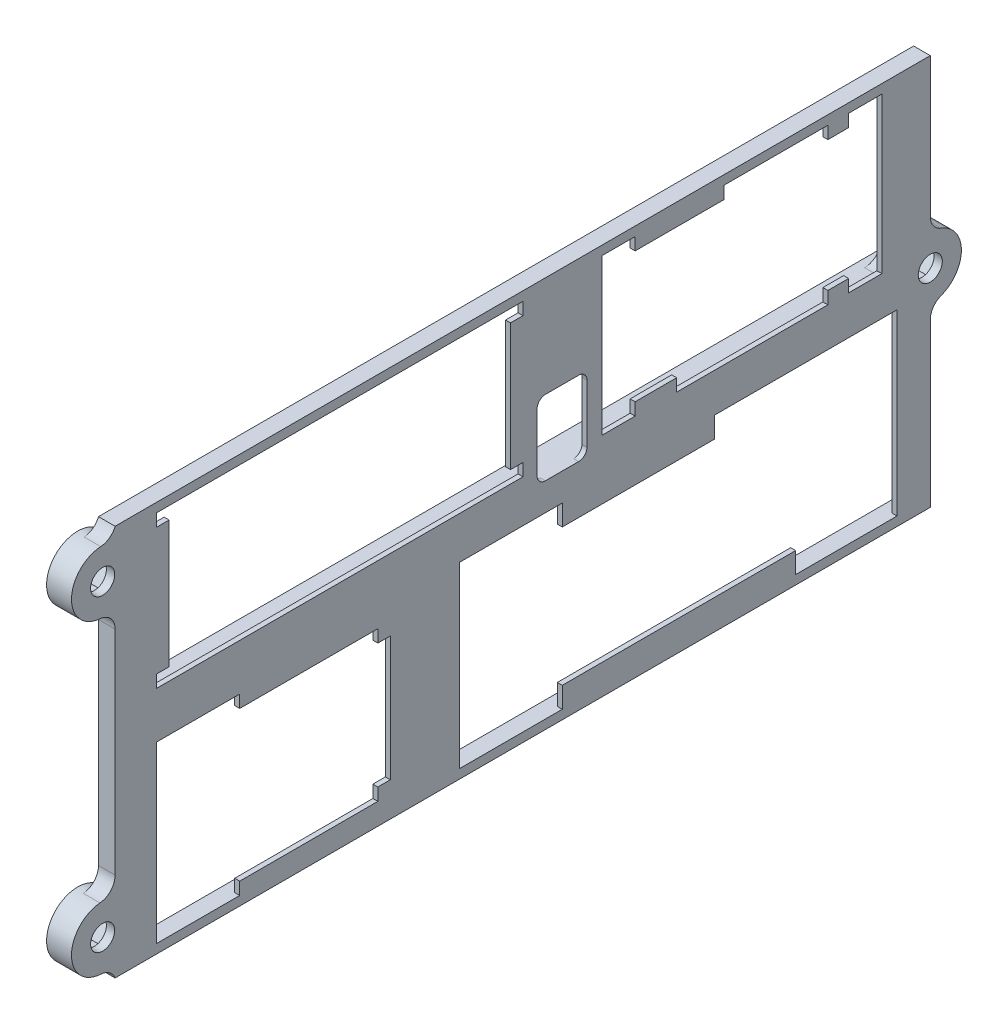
ISO-10303-21;
HEADER;
FILE_DESCRIPTION(('STEP AP214'),'2;1');
FILE_NAME('part.step','',(''),(''),'','','');
FILE_SCHEMA(('AUTOMOTIVE_DESIGN { 1 0 10303 214 1 1 1 1 }'));
ENDSEC;
DATA;
#1=APPLICATION_CONTEXT('core data for automotive mechanical design processes');
#2=APPLICATION_PROTOCOL_DEFINITION('international standard','automotive_design',2000,#1);
#3=PRODUCT_CONTEXT('',#1,'mechanical');
#4=PRODUCT('Part','Part','',(#3));
#5=PRODUCT_RELATED_PRODUCT_CATEGORY('part','',(#4));
#6=PRODUCT_DEFINITION_FORMATION('','',#4);
#7=PRODUCT_DEFINITION_CONTEXT('part definition',#1,'design');
#8=PRODUCT_DEFINITION('design','',#6,#7);
#9=PRODUCT_DEFINITION_SHAPE('','',#8);
#10=(LENGTH_UNIT() NAMED_UNIT(*) SI_UNIT(.MILLI.,.METRE.));
#11=(NAMED_UNIT(*) PLANE_ANGLE_UNIT() SI_UNIT($,.RADIAN.));
#12=(NAMED_UNIT(*) SI_UNIT($,.STERADIAN.) SOLID_ANGLE_UNIT());
#13=UNCERTAINTY_MEASURE_WITH_UNIT(LENGTH_MEASURE(1.E-05),#10,'distance_accuracy_value','');
#14=(GEOMETRIC_REPRESENTATION_CONTEXT(3) GLOBAL_UNCERTAINTY_ASSIGNED_CONTEXT((#13)) GLOBAL_UNIT_ASSIGNED_CONTEXT((#10,
#11,#12)) REPRESENTATION_CONTEXT('',''));
#15=CARTESIAN_POINT('',(0.,0.,0.));
#16=DIRECTION('',(0.,0.,1.));
#17=DIRECTION('',(1.,0.,0.));
#18=AXIS2_PLACEMENT_3D('',#15,#16,#17);
#19=CARTESIAN_POINT('',(-3.4,24.44,39.8199999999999));
#20=DIRECTION('',(0.,1.,0.));
#21=DIRECTION('',(0.,0.,1.));
#22=AXIS2_PLACEMENT_3D('',#19,#20,#21);
#23=PLANE('',#22);
#24=DIRECTION('',(0.,0.,1.));
#25=VECTOR('',#24,1.);
#26=CARTESIAN_POINT('',(-2.4,24.44,39.8199999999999));
#27=LINE('',#26,#25);
#28=CARTESIAN_POINT('',(-2.4,24.44,40.7407259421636));
#29=VERTEX_POINT('',#28);
#30=CARTESIAN_POINT('',(-2.4,24.44,43.625354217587));
#31=VERTEX_POINT('',#30);
#32=EDGE_CURVE('E992',#29,#31,#27,.T.);
#33=ORIENTED_EDGE('',*,*,#32,.T.);
#34=DIRECTION('',(-1.,0.,0.));
#35=VECTOR('',#34,1.);
#36=CARTESIAN_POINT('',(0.,24.44,43.625354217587));
#37=LINE('',#36,#35);
#38=CARTESIAN_POINT('',(0.,24.44,43.625354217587));
#39=VERTEX_POINT('',#38);
#40=EDGE_CURVE('E1913',#31,#39,#37,.F.);
#41=ORIENTED_EDGE('',*,*,#40,.T.);
#42=DIRECTION('',(0.,0.,-1.));
#43=VECTOR('',#42,1.);
#44=CARTESIAN_POINT('',(0.,24.44,39.8199999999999));
#45=LINE('',#44,#43);
#46=CARTESIAN_POINT('',(0.,24.44,135.75));
#47=VERTEX_POINT('',#46);
#48=EDGE_CURVE('E1010',#47,#39,#45,.T.);
#49=ORIENTED_EDGE('',*,*,#48,.F.);
#50=DIRECTION('',(1.,0.,0.));
#51=VECTOR('',#50,1.);
#52=CARTESIAN_POINT('',(-3.4,24.44,135.75));
#53=LINE('',#52,#51);
#54=CARTESIAN_POINT('',(-1.4,24.44,135.75));
#55=VERTEX_POINT('',#54);
#56=EDGE_CURVE('E1029',#55,#47,#53,.T.);
#57=ORIENTED_EDGE('',*,*,#56,.F.);
#58=DIRECTION('',(0.,0.,-1.));
#59=VECTOR('',#58,1.);
#60=CARTESIAN_POINT('',(-1.4,24.44,39.8199999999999));
#61=LINE('',#60,#59);
#62=CARTESIAN_POINT('',(-1.4,24.44,136.75));
#63=VERTEX_POINT('',#62);
#64=EDGE_CURVE('E1800',#63,#55,#61,.T.);
#65=ORIENTED_EDGE('',*,*,#64,.F.);
#66=DIRECTION('',(0.707106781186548,0.,0.707106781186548));
#67=VECTOR('',#66,1.);
#68=CARTESIAN_POINT('',(-50.865,24.44,87.2849999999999));
#69=LINE('',#68,#67);
#70=CARTESIAN_POINT('',(-2.4,24.44,135.75));
#71=VERTEX_POINT('',#70);
#72=EDGE_CURVE('E1803',#63,#71,#69,.F.);
#73=ORIENTED_EDGE('',*,*,#72,.T.);
#74=DIRECTION('',(-0.707106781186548,0.,-0.707106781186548));
#75=VECTOR('',#74,1.);
#76=CARTESIAN_POINT('',(-3.4,24.44,134.75));
#77=LINE('',#76,#75);
#78=CARTESIAN_POINT('',(-3.4,24.44,134.75));
#79=VERTEX_POINT('',#78);
#80=EDGE_CURVE('E1789',#71,#79,#77,.T.);
#81=ORIENTED_EDGE('',*,*,#80,.T.);
#82=DIRECTION('',(0.,0.,1.));
#83=VECTOR('',#82,1.);
#84=CARTESIAN_POINT('',(-3.4,24.44,39.8199999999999));
#85=LINE('',#84,#83);
#86=CARTESIAN_POINT('',(-3.4,24.44,40.7407259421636));
#87=VERTEX_POINT('',#86);
#88=EDGE_CURVE('E1014',#87,#79,#85,.T.);
#89=ORIENTED_EDGE('',*,*,#88,.F.);
#90=DIRECTION('',(-1.,0.,0.));
#91=VECTOR('',#90,1.);
#92=CARTESIAN_POINT('',(-3.4,24.44,40.7407259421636));
#93=LINE('',#92,#91);
#94=EDGE_CURVE('E956',#29,#87,#93,.T.);
#95=ORIENTED_EDGE('',*,*,#94,.F.);
#96=EDGE_LOOP('',(#33,#41,#49,#57,#65,#73,#81,#89,#95));
#97=FACE_BOUND('',#96,.T.);
#98=ADVANCED_FACE('F46',(#97),#23,.F.);
#99=CARTESIAN_POINT('',(-3.4,26.44,39.8199999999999));
#100=DIRECTION('',(0.,-1.,0.));
#101=DIRECTION('',(0.,0.,-1.));
#102=AXIS2_PLACEMENT_3D('',#99,#100,#101);
#103=PLANE('',#102);
#104=DIRECTION('',(0.,0.,1.));
#105=VECTOR('',#104,1.);
#106=CARTESIAN_POINT('',(0.,26.44,39.8199999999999));
#107=LINE('',#106,#105);
#108=CARTESIAN_POINT('',(0.,26.44,85.0499999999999));
#109=VERTEX_POINT('',#108);
#110=CARTESIAN_POINT('',(0.,26.44,135.75));
#111=VERTEX_POINT('',#110);
#112=EDGE_CURVE('E1018',#109,#111,#107,.T.);
#113=ORIENTED_EDGE('',*,*,#112,.F.);
#114=DIRECTION('',(-1.,0.,0.));
#115=VECTOR('',#114,1.);
#116=CARTESIAN_POINT('',(0.6,26.44,85.0499999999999));
#117=LINE('',#116,#115);
#118=CARTESIAN_POINT('',(0.6,26.44,85.0499999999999));
#119=VERTEX_POINT('',#118);
#120=EDGE_CURVE('E2009',#109,#119,#117,.F.);
#121=ORIENTED_EDGE('',*,*,#120,.T.);
#122=DIRECTION('',(0.,0.,1.));
#123=VECTOR('',#122,1.);
#124=CARTESIAN_POINT('',(0.6,26.44,80.0499999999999));
#125=LINE('',#124,#123);
#126=CARTESIAN_POINT('',(0.6,26.44,81.0499999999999));
#127=VERTEX_POINT('',#126);
#128=EDGE_CURVE('E2068',#127,#119,#125,.T.);
#129=ORIENTED_EDGE('',*,*,#128,.F.);
#130=DIRECTION('',(-1.,0.,0.));
#131=VECTOR('',#130,1.);
#132=CARTESIAN_POINT('',(0.,26.44,81.0499999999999));
#133=LINE('',#132,#131);
#134=CARTESIAN_POINT('',(0.,26.44,81.0499999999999));
#135=VERTEX_POINT('',#134);
#136=EDGE_CURVE('E2005',#127,#135,#133,.T.);
#137=ORIENTED_EDGE('',*,*,#136,.T.);
#138=CARTESIAN_POINT('',(0.,26.44,43.625354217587));
#139=VERTEX_POINT('',#138);
#140=EDGE_CURVE('E1015',#139,#135,#107,.T.);
#141=ORIENTED_EDGE('',*,*,#140,.F.);
#142=DIRECTION('',(-1.,0.,0.));
#143=VECTOR('',#142,1.);
#144=CARTESIAN_POINT('',(-2.4,26.44,43.625354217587));
#145=LINE('',#144,#143);
#146=CARTESIAN_POINT('',(-2.4,26.44,43.625354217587));
#147=VERTEX_POINT('',#146);
#148=EDGE_CURVE('E1906',#139,#147,#145,.T.);
#149=ORIENTED_EDGE('',*,*,#148,.T.);
#150=DIRECTION('',(0.,0.,-1.));
#151=VECTOR('',#150,1.);
#152=CARTESIAN_POINT('',(-2.4,26.44,39.8199999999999));
#153=LINE('',#152,#151);
#154=CARTESIAN_POINT('',(-2.4,26.44,40.7407259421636));
#155=VERTEX_POINT('',#154);
#156=EDGE_CURVE('E1705',#147,#155,#153,.T.);
#157=ORIENTED_EDGE('',*,*,#156,.T.);
#158=DIRECTION('',(1.,0.,0.));
#159=VECTOR('',#158,1.);
#160=CARTESIAN_POINT('',(-3.4,26.44,40.7407259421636));
#161=LINE('',#160,#159);
#162=CARTESIAN_POINT('',(-3.4,26.44,40.7407259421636));
#163=VERTEX_POINT('',#162);
#164=EDGE_CURVE('E814',#163,#155,#161,.T.);
#165=ORIENTED_EDGE('',*,*,#164,.F.);
#166=DIRECTION('',(0.,0.,-1.));
#167=VECTOR('',#166,1.);
#168=CARTESIAN_POINT('',(-3.4,26.44,39.8199999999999));
#169=LINE('',#168,#167);
#170=CARTESIAN_POINT('',(-3.4,26.44,134.75));
#171=VERTEX_POINT('',#170);
#172=EDGE_CURVE('E1022',#171,#163,#169,.T.);
#173=ORIENTED_EDGE('',*,*,#172,.F.);
#174=DIRECTION('',(0.707106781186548,0.,0.707106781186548));
#175=VECTOR('',#174,1.);
#176=CARTESIAN_POINT('',(-3.4,26.44,134.75));
#177=LINE('',#176,#175);
#178=CARTESIAN_POINT('',(-2.4,26.44,135.75));
#179=VERTEX_POINT('',#178);
#180=EDGE_CURVE('E1786',#171,#179,#177,.T.);
#181=ORIENTED_EDGE('',*,*,#180,.T.);
#182=DIRECTION('',(-0.707106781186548,0.,-0.707106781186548));
#183=VECTOR('',#182,1.);
#184=CARTESIAN_POINT('',(-50.865,26.44,87.2849999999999));
#185=LINE('',#184,#183);
#186=CARTESIAN_POINT('',(-1.4,26.44,136.75));
#187=VERTEX_POINT('',#186);
#188=EDGE_CURVE('E1806',#179,#187,#185,.F.);
#189=ORIENTED_EDGE('',*,*,#188,.T.);
#190=DIRECTION('',(0.,0.,1.));
#191=VECTOR('',#190,1.);
#192=CARTESIAN_POINT('',(-1.4,26.44,39.8199999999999));
#193=LINE('',#192,#191);
#194=CARTESIAN_POINT('',(-1.4,26.44,135.75));
#195=VERTEX_POINT('',#194);
#196=EDGE_CURVE('E1792',#195,#187,#193,.T.);
#197=ORIENTED_EDGE('',*,*,#196,.F.);
#198=DIRECTION('',(1.,0.,0.));
#199=VECTOR('',#198,1.);
#200=CARTESIAN_POINT('',(-3.4,26.44,135.75));
#201=LINE('',#200,#199);
#202=EDGE_CURVE('E1025',#195,#111,#201,.T.);
#203=ORIENTED_EDGE('',*,*,#202,.T.);
#204=EDGE_LOOP('',(#113,#121,#129,#137,#141,#149,#157,#165,#173,#181,#189,#197,#203));
#205=FACE_BOUND('',#204,.T.);
#206=ADVANCED_FACE('F2118',(#205),#103,.F.);
#207=CARTESIAN_POINT('',(-3.4,0.,0.));
#208=DIRECTION('',(-1.,0.,0.));
#209=DIRECTION('',(0.,0.,1.));
#210=AXIS2_PLACEMENT_3D('',#207,#208,#209);
#211=PLANE('',#210);
#212=ORIENTED_EDGE('',*,*,#88,.T.);
#213=DIRECTION('',(0.,1.,0.));
#214=VECTOR('',#213,1.);
#215=CARTESIAN_POINT('',(-3.4,26.44,134.75));
#216=LINE('',#215,#214);
#217=EDGE_CURVE('E1782',#79,#171,#216,.T.);
#218=ORIENTED_EDGE('',*,*,#217,.T.);
#219=ORIENTED_EDGE('',*,*,#172,.T.);
#220=DIRECTION('',(0.,0.866025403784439,-0.5));
#221=VECTOR('',#220,1.);
#222=CARTESIAN_POINT('',(-3.4,25.44,41.3180762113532));
#223=LINE('',#222,#221);
#224=CARTESIAN_POINT('',(-3.4,25.44,41.3180762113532));
#225=VERTEX_POINT('',#224);
#226=EDGE_CURVE('E856',#225,#163,#223,.T.);
#227=ORIENTED_EDGE('',*,*,#226,.F.);
#228=DIRECTION('',(0.,0.866025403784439,0.5));
#229=VECTOR('',#228,1.);
#230=CARTESIAN_POINT('',(-3.4,23.19,40.0190381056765));
#231=LINE('',#230,#229);
#232=EDGE_CURVE('E853',#87,#225,#231,.T.);
#233=ORIENTED_EDGE('',*,*,#232,.F.);
#234=EDGE_LOOP('',(#212,#218,#219,#227,#233));
#235=FACE_BOUND('',#234,.T.);
#236=ADVANCED_FACE('F2125',(#235),#211,.T.);
#237=CARTESIAN_POINT('',(-2.4,25.44,38.7199999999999));
#238=DIRECTION('',(-1.,0.,0.));
#239=DIRECTION('',(0.,0.,1.));
#240=AXIS2_PLACEMENT_3D('',#237,#238,#239);
#241=PLANE('',#240);
#242=ORIENTED_EDGE('',*,*,#32,.F.);
#243=DIRECTION('',(0.,-0.866025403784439,-0.5));
#244=VECTOR('',#243,1.);
#245=CARTESIAN_POINT('',(-2.4,24.315,40.6685571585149));
#246=LINE('',#245,#244);
#247=CARTESIAN_POINT('',(-2.4,23.19,40.0190381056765));
#248=VERTEX_POINT('',#247);
#249=EDGE_CURVE('E1778',#29,#248,#246,.T.);
#250=ORIENTED_EDGE('',*,*,#249,.T.);
#251=DIRECTION('',(0.,0.,-1.));
#252=VECTOR('',#251,1.);
#253=CARTESIAN_POINT('',(-2.4,23.19,38.7199999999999));
#254=LINE('',#253,#252);
#255=CARTESIAN_POINT('',(-2.4,23.19,37.4209618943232));
#256=VERTEX_POINT('',#255);
#257=EDGE_CURVE('E1774',#248,#256,#254,.T.);
#258=ORIENTED_EDGE('',*,*,#257,.T.);
#259=DIRECTION('',(0.,0.866025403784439,-0.5));
#260=VECTOR('',#259,1.);
#261=CARTESIAN_POINT('',(-2.4,24.315,36.7714428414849));
#262=LINE('',#261,#260);
#263=CARTESIAN_POINT('',(-2.4,25.44,36.1219237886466));
#264=VERTEX_POINT('',#263);
#265=EDGE_CURVE('E1771',#256,#264,#262,.T.);
#266=ORIENTED_EDGE('',*,*,#265,.T.);
#267=DIRECTION('',(0.,0.866025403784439,0.499999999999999));
#268=VECTOR('',#267,1.);
#269=CARTESIAN_POINT('',(-2.4,26.565,36.7714428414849));
#270=LINE('',#269,#268);
#271=CARTESIAN_POINT('',(-2.4,27.69,37.4209618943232));
#272=VERTEX_POINT('',#271);
#273=EDGE_CURVE('E810',#264,#272,#270,.T.);
#274=ORIENTED_EDGE('',*,*,#273,.T.);
#275=DIRECTION('',(0.,0.,1.));
#276=VECTOR('',#275,1.);
#277=CARTESIAN_POINT('',(-2.4,27.69,38.7199999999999));
#278=LINE('',#277,#276);
#279=CARTESIAN_POINT('',(-2.4,27.69,40.0190381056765));
#280=VERTEX_POINT('',#279);
#281=EDGE_CURVE('E1761',#272,#280,#278,.T.);
#282=ORIENTED_EDGE('',*,*,#281,.T.);
#283=DIRECTION('',(0.,-0.866025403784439,0.5));
#284=VECTOR('',#283,1.);
#285=CARTESIAN_POINT('',(-2.4,26.565,40.6685571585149));
#286=LINE('',#285,#284);
#287=EDGE_CURVE('E1765',#280,#155,#286,.T.);
#288=ORIENTED_EDGE('',*,*,#287,.T.);
#289=ORIENTED_EDGE('',*,*,#156,.F.);
#290=CARTESIAN_POINT('',(-2.4,28.44,43.625354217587));
#291=DIRECTION('',(-1.,0.,0.));
#292=DIRECTION('',(0.,0.,1.));
#293=AXIS2_PLACEMENT_3D('',#290,#291,#292);
#294=CIRCLE('',#293,2.);
#295=CARTESIAN_POINT('',(-2.4,27.3965217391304,41.919144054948));
#296=VERTEX_POINT('',#295);
#297=EDGE_CURVE('E1945',#147,#296,#294,.F.);
#298=ORIENTED_EDGE('',*,*,#297,.T.);
#299=CARTESIAN_POINT('',(-2.4,25.44,38.7199999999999));
#300=DIRECTION('',(-1.,0.,0.));
#301=DIRECTION('',(0.,0.,1.));
#302=AXIS2_PLACEMENT_3D('',#299,#300,#301);
#303=CIRCLE('',#302,3.75);
#304=CARTESIAN_POINT('',(-2.4,23.4834782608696,41.919144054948));
#305=VERTEX_POINT('',#304);
#306=EDGE_CURVE('E988',#296,#305,#303,.T.);
#307=ORIENTED_EDGE('',*,*,#306,.T.);
#308=CARTESIAN_POINT('',(-2.4,22.44,43.625354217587));
#309=DIRECTION('',(-1.,0.,0.));
#310=DIRECTION('',(0.,0.,1.));
#311=AXIS2_PLACEMENT_3D('',#308,#309,#310);
#312=CIRCLE('',#311,2.);
#313=EDGE_CURVE('E1951',#305,#31,#312,.F.);
#314=ORIENTED_EDGE('',*,*,#313,.T.);
#315=EDGE_LOOP('',(#242,#250,#258,#266,#274,#282,#288,#289,#298,#307,#314));
#316=FACE_BOUND('',#315,.T.);
#317=ADVANCED_FACE('F2511',(#316),#241,.T.);
#318=CARTESIAN_POINT('',(-2.4,42.6,138.35));
#319=DIRECTION('',(-1.,0.,0.));
#320=DIRECTION('',(0.,0.,1.));
#321=AXIS2_PLACEMENT_3D('',#318,#319,#320);
#322=PLANE('',#321);
#323=CARTESIAN_POINT('',(-2.4,42.6,138.35));
#324=DIRECTION('',(-1.,0.,0.));
#325=DIRECTION('',(0.,0.,1.));
#326=AXIS2_PLACEMENT_3D('',#323,#324,#325);
#327=CIRCLE('',#326,3.75000000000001);
#328=CARTESIAN_POINT('',(-2.4,42.6,142.1));
#329=VERTEX_POINT('',#328);
#330=EDGE_CURVE('E980',#329,#329,#327,.T.);
#331=ORIENTED_EDGE('',*,*,#330,.T.);
#332=EDGE_LOOP('',(#331));
#333=FACE_BOUND('',#332,.T.);
#334=DIRECTION('',(0.,0.,1.));
#335=VECTOR('',#334,1.);
#336=CARTESIAN_POINT('',(-2.4,44.85,138.35));
#337=LINE('',#336,#335);
#338=CARTESIAN_POINT('',(-2.4,44.85,137.050961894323));
#339=VERTEX_POINT('',#338);
#340=CARTESIAN_POINT('',(-2.4,44.85,139.649038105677));
#341=VERTEX_POINT('',#340);
#342=EDGE_CURVE('E1753',#339,#341,#337,.T.);
#343=ORIENTED_EDGE('',*,*,#342,.T.);
#344=DIRECTION('',(0.,-0.866025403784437,0.500000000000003));
#345=VECTOR('',#344,1.);
#346=CARTESIAN_POINT('',(-2.4,43.725,140.298557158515));
#347=LINE('',#346,#345);
#348=CARTESIAN_POINT('',(-2.4,42.6,140.948076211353));
#349=VERTEX_POINT('',#348);
#350=EDGE_CURVE('E1757',#341,#349,#347,.T.);
#351=ORIENTED_EDGE('',*,*,#350,.T.);
#352=DIRECTION('',(0.,-0.866025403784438,-0.5));
#353=VECTOR('',#352,1.);
#354=CARTESIAN_POINT('',(-2.4,41.475,140.298557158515));
#355=LINE('',#354,#353);
#356=CARTESIAN_POINT('',(-2.4,40.3499999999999,139.649038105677));
#357=VERTEX_POINT('',#356);
#358=EDGE_CURVE('E1737',#349,#357,#355,.T.);
#359=ORIENTED_EDGE('',*,*,#358,.T.);
#360=DIRECTION('',(0.,0.,-1.));
#361=VECTOR('',#360,1.);
#362=CARTESIAN_POINT('',(-2.4,40.3499999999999,138.35));
#363=LINE('',#362,#361);
#364=CARTESIAN_POINT('',(-2.4,40.3499999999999,137.050961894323));
#365=VERTEX_POINT('',#364);
#366=EDGE_CURVE('E1741',#357,#365,#363,.T.);
#367=ORIENTED_EDGE('',*,*,#366,.T.);
#368=DIRECTION('',(0.,0.86602540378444,-0.499999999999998));
#369=VECTOR('',#368,1.);
#370=CARTESIAN_POINT('',(-2.4,41.475,136.401442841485));
#371=LINE('',#370,#369);
#372=CARTESIAN_POINT('',(-2.4,42.6,135.751923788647));
#373=VERTEX_POINT('',#372);
#374=EDGE_CURVE('E1745',#365,#373,#371,.T.);
#375=ORIENTED_EDGE('',*,*,#374,.T.);
#376=DIRECTION('',(0.,0.86602540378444,0.499999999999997));
#377=VECTOR('',#376,1.);
#378=CARTESIAN_POINT('',(-2.4,43.725,136.401442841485));
#379=LINE('',#378,#377);
#380=EDGE_CURVE('E1749',#373,#339,#379,.T.);
#381=ORIENTED_EDGE('',*,*,#380,.T.);
#382=EDGE_LOOP('',(#343,#351,#359,#367,#375,#381));
#383=FACE_BOUND('',#382,.T.);
#384=ADVANCED_FACE('F2988',(#333,#383),#322,.T.);
#385=CARTESIAN_POINT('',(-2.4,5.49999999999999,138.35));
#386=DIRECTION('',(-1.,0.,0.));
#387=DIRECTION('',(0.,0.,1.));
#388=AXIS2_PLACEMENT_3D('',#385,#386,#387);
#389=PLANE('',#388);
#390=CARTESIAN_POINT('',(-2.4,5.49999999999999,138.35));
#391=DIRECTION('',(-1.,0.,0.));
#392=DIRECTION('',(0.,0.,1.));
#393=AXIS2_PLACEMENT_3D('',#390,#391,#392);
#394=CIRCLE('',#393,3.75000000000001);
#395=CARTESIAN_POINT('',(-2.4,5.49999999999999,142.1));
#396=VERTEX_POINT('',#395);
#397=EDGE_CURVE('E959',#396,#396,#394,.T.);
#398=ORIENTED_EDGE('',*,*,#397,.T.);
#399=EDGE_LOOP('',(#398));
#400=FACE_BOUND('',#399,.T.);
#401=DIRECTION('',(0.,0.,1.));
#402=VECTOR('',#401,1.);
#403=CARTESIAN_POINT('',(-2.4,7.75,138.35));
#404=LINE('',#403,#402);
#405=CARTESIAN_POINT('',(-2.4,7.75,137.050961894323));
#406=VERTEX_POINT('',#405);
#407=CARTESIAN_POINT('',(-2.4,7.75,139.649038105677));
#408=VERTEX_POINT('',#407);
#409=EDGE_CURVE('E1729',#406,#408,#404,.T.);
#410=ORIENTED_EDGE('',*,*,#409,.T.);
#411=DIRECTION('',(0.,-0.866025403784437,0.500000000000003));
#412=VECTOR('',#411,1.);
#413=CARTESIAN_POINT('',(-2.4,6.62499999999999,140.298557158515));
#414=LINE('',#413,#412);
#415=CARTESIAN_POINT('',(-2.4,5.50000000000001,140.948076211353));
#416=VERTEX_POINT('',#415);
#417=EDGE_CURVE('E1733',#408,#416,#414,.T.);
#418=ORIENTED_EDGE('',*,*,#417,.T.);
#419=DIRECTION('',(0.,-0.866025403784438,-0.500000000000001));
#420=VECTOR('',#419,1.);
#421=CARTESIAN_POINT('',(-2.4,4.375,140.298557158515));
#422=LINE('',#421,#420);
#423=CARTESIAN_POINT('',(-2.4,3.25,139.649038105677));
#424=VERTEX_POINT('',#423);
#425=EDGE_CURVE('E1713',#416,#424,#422,.T.);
#426=ORIENTED_EDGE('',*,*,#425,.T.);
#427=DIRECTION('',(0.,0.,-1.));
#428=VECTOR('',#427,1.);
#429=CARTESIAN_POINT('',(-2.4,3.25,138.35));
#430=LINE('',#429,#428);
#431=CARTESIAN_POINT('',(-2.4,3.25,137.050961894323));
#432=VERTEX_POINT('',#431);
#433=EDGE_CURVE('E1717',#424,#432,#430,.T.);
#434=ORIENTED_EDGE('',*,*,#433,.T.);
#435=DIRECTION('',(0.,0.866025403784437,-0.500000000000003));
#436=VECTOR('',#435,1.);
#437=CARTESIAN_POINT('',(-2.4,4.37499999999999,136.401442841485));
#438=LINE('',#437,#436);
#439=CARTESIAN_POINT('',(-2.4,5.5,135.751923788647));
#440=VERTEX_POINT('',#439);
#441=EDGE_CURVE('E1721',#432,#440,#438,.T.);
#442=ORIENTED_EDGE('',*,*,#441,.T.);
#443=DIRECTION('',(0.,0.866025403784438,0.500000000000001));
#444=VECTOR('',#443,1.);
#445=CARTESIAN_POINT('',(-2.4,6.62499999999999,136.401442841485));
#446=LINE('',#445,#444);
#447=EDGE_CURVE('E1725',#440,#406,#446,.T.);
#448=ORIENTED_EDGE('',*,*,#447,.T.);
#449=EDGE_LOOP('',(#410,#418,#426,#434,#442,#448));
#450=FACE_BOUND('',#449,.T.);
#451=ADVANCED_FACE('F2350',(#400,#450),#389,.T.);
#452=CARTESIAN_POINT('',(0.6,0.499999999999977,136.85));
#453=DIRECTION('',(0.,0.,-1.));
#454=DIRECTION('',(-1.,0.,0.));
#455=AXIS2_PLACEMENT_3D('',#452,#453,#454);
#456=PLANE('',#455);
#457=DIRECTION('',(0.,-1.,0.));
#458=VECTOR('',#457,1.);
#459=CARTESIAN_POINT('',(-1.4,47.6,136.85));
#460=LINE('',#459,#458);
#461=CARTESIAN_POINT('',(-1.4,36.8717803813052,136.85));
#462=VERTEX_POINT('',#461);
#463=CARTESIAN_POINT('',(-1.4,11.2282196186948,136.85));
#464=VERTEX_POINT('',#463);
#465=EDGE_CURVE('E1058',#462,#464,#460,.T.);
#466=ORIENTED_EDGE('',*,*,#465,.T.);
#467=DIRECTION('',(-1.,0.,0.));
#468=VECTOR('',#467,1.);
#469=CARTESIAN_POINT('',(0.6,11.2282196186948,136.85));
#470=LINE('',#469,#468);
#471=CARTESIAN_POINT('',(0.6,11.2282196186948,136.85));
#472=VERTEX_POINT('',#471);
#473=EDGE_CURVE('E1928',#464,#472,#470,.F.);
#474=ORIENTED_EDGE('',*,*,#473,.T.);
#475=DIRECTION('',(0.,-1.,0.));
#476=VECTOR('',#475,1.);
#477=CARTESIAN_POINT('',(0.6,0.499999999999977,136.85));
#478=LINE('',#477,#476);
#479=CARTESIAN_POINT('',(0.6,36.8717803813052,136.85));
#480=VERTEX_POINT('',#479);
#481=EDGE_CURVE('E1664',#480,#472,#478,.T.);
#482=ORIENTED_EDGE('',*,*,#481,.F.);
#483=DIRECTION('',(-1.,0.,0.));
#484=VECTOR('',#483,1.);
#485=CARTESIAN_POINT('',(-1.4,36.8717803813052,136.85));
#486=LINE('',#485,#484);
#487=EDGE_CURVE('E1925',#480,#462,#486,.T.);
#488=ORIENTED_EDGE('',*,*,#487,.T.);
#489=EDGE_LOOP('',(#466,#474,#482,#488));
#490=FACE_BOUND('',#489,.T.);
#491=ADVANCED_FACE('F2347',(#490),#456,.F.);
#492=CARTESIAN_POINT('',(-1.4,0.,0.));
#493=DIRECTION('',(1.,0.,0.));
#494=DIRECTION('',(0.,0.,-1.));
#495=AXIS2_PLACEMENT_3D('',#492,#493,#494);
#496=PLANE('',#495);
#497=CARTESIAN_POINT('',(-1.4,5.49999999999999,138.35));
#498=DIRECTION('',(1.,0.,0.));
#499=DIRECTION('',(0.,0.,-1.));
#500=AXIS2_PLACEMENT_3D('',#497,#498,#499);
#501=CIRCLE('',#500,3.75000000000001);
#502=CARTESIAN_POINT('',(-1.4,3.24999999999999,135.35));
#503=VERTEX_POINT('',#502);
#504=CARTESIAN_POINT('',(-1.4,1.75729718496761,138.583828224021));
#505=VERTEX_POINT('',#504);
#506=EDGE_CURVE('E974',#503,#505,#501,.F.);
#507=ORIENTED_EDGE('',*,*,#506,.F.);
#508=CARTESIAN_POINT('',(-1.4,2.05,133.75));
#509=DIRECTION('',(1.,0.,0.));
#510=DIRECTION('',(0.,0.,-1.));
#511=AXIS2_PLACEMENT_3D('',#508,#509,#510);
#512=CIRCLE('',#511,2.);
#513=CARTESIAN_POINT('',(-1.4,2.05,135.75));
#514=VERTEX_POINT('',#513);
#515=EDGE_CURVE('E1931',#503,#514,#512,.T.);
#516=ORIENTED_EDGE('',*,*,#515,.T.);
#517=DIRECTION('',(0.,-1.,0.));
#518=VECTOR('',#517,1.);
#519=CARTESIAN_POINT('',(-1.4,46.5,135.75));
#520=LINE('',#519,#518);
#521=CARTESIAN_POINT('',(-1.4,1.59999999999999,135.75));
#522=VERTEX_POINT('',#521);
#523=EDGE_CURVE('E1033',#514,#522,#520,.T.);
#524=ORIENTED_EDGE('',*,*,#523,.T.);
#525=DIRECTION('',(0.,0.,-1.));
#526=VECTOR('',#525,1.);
#527=CARTESIAN_POINT('',(-1.4,1.59999999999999,135.75));
#528=LINE('',#527,#526);
#529=CARTESIAN_POINT('',(-1.4,1.59999999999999,39.8199999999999));
#530=VERTEX_POINT('',#529);
#531=EDGE_CURVE('E1038',#522,#530,#528,.T.);
#532=ORIENTED_EDGE('',*,*,#531,.T.);
#533=DIRECTION('',(0.,1.,0.));
#534=VECTOR('',#533,1.);
#535=CARTESIAN_POINT('',(-1.4,46.5,39.8199999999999));
#536=LINE('',#535,#534);
#537=CARTESIAN_POINT('',(-1.4,20.5972218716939,39.8199999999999));
#538=VERTEX_POINT('',#537);
#539=EDGE_CURVE('E1045',#530,#538,#536,.T.);
#540=ORIENTED_EDGE('',*,*,#539,.T.);
#541=CARTESIAN_POINT('',(-1.4,20.5972218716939,41.8199999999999));
#542=DIRECTION('',(1.,0.,0.));
#543=DIRECTION('',(0.,0.,-1.));
#544=AXIS2_PLACEMENT_3D('',#541,#542,#543);
#545=CIRCLE('',#544,2.);
#546=CARTESIAN_POINT('',(-1.4,22.2816664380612,40.7417391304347));
#547=VERTEX_POINT('',#546);
#548=EDGE_CURVE('E1955',#538,#547,#545,.T.);
#549=ORIENTED_EDGE('',*,*,#548,.T.);
#550=CARTESIAN_POINT('',(-1.4,25.44,38.7199999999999));
#551=DIRECTION('',(1.,0.,0.));
#552=DIRECTION('',(0.,0.,-1.));
#553=AXIS2_PLACEMENT_3D('',#550,#551,#552);
#554=CIRCLE('',#553,3.75);
#555=CARTESIAN_POINT('',(-1.4,21.9241534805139,37.4156521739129));
#556=VERTEX_POINT('',#555);
#557=EDGE_CURVE('E1006',#556,#547,#554,.F.);
#558=ORIENTED_EDGE('',*,*,#557,.F.);
#559=CARTESIAN_POINT('',(-1.4,20.049035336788,36.7199999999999));
#560=DIRECTION('',(1.,0.,0.));
#561=DIRECTION('',(0.,0.,-1.));
#562=AXIS2_PLACEMENT_3D('',#559,#560,#561);
#563=CIRCLE('',#562,2.);
#564=CARTESIAN_POINT('',(-1.4,20.049035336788,38.7199999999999));
#565=VERTEX_POINT('',#564);
#566=EDGE_CURVE('E1959',#556,#565,#563,.T.);
#567=ORIENTED_EDGE('',*,*,#566,.T.);
#568=DIRECTION('',(0.,1.,0.));
#569=VECTOR('',#568,1.);
#570=CARTESIAN_POINT('',(-1.4,47.6,38.7199999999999));
#571=LINE('',#570,#569);
#572=CARTESIAN_POINT('',(-1.4,0.499999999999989,38.7199999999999));
#573=VERTEX_POINT('',#572);
#574=EDGE_CURVE('E1077',#573,#565,#571,.T.);
#575=ORIENTED_EDGE('',*,*,#574,.F.);
#576=DIRECTION('',(0.,0.,-1.));
#577=VECTOR('',#576,1.);
#578=CARTESIAN_POINT('',(-1.4,0.499999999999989,136.85));
#579=LINE('',#578,#577);
#580=CARTESIAN_POINT('',(-1.4,0.499999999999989,136.85));
#581=VERTEX_POINT('',#580);
#582=EDGE_CURVE('E1072',#581,#573,#579,.T.);
#583=ORIENTED_EDGE('',*,*,#582,.F.);
#584=CARTESIAN_POINT('',(-1.4,-0.238810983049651,138.708536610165));
#585=DIRECTION('',(1.,0.,0.));
#586=DIRECTION('',(0.,0.,-1.));
#587=AXIS2_PLACEMENT_3D('',#584,#585,#586);
#588=CIRCLE('',#587,2.);
#589=EDGE_CURVE('E1987',#581,#505,#588,.T.);
#590=ORIENTED_EDGE('',*,*,#589,.T.);
#591=EDGE_LOOP('',(#507,#516,#524,#532,#540,#549,#558,#567,#575,#583,#590));
#592=FACE_BOUND('',#591,.T.);
#593=ADVANCED_FACE('F2140',(#592),#496,.F.);
#594=CARTESIAN_POINT('',(-1.4,46.5,135.75));
#595=DIRECTION('',(0.,0.,1.));
#596=DIRECTION('',(1.,0.,0.));
#597=AXIS2_PLACEMENT_3D('',#594,#595,#596);
#598=PLANE('',#597);
#599=ORIENTED_EDGE('',*,*,#523,.F.);
#600=DIRECTION('',(-1.,0.,0.));
#601=VECTOR('',#600,1.);
#602=CARTESIAN_POINT('',(0.,2.05,135.75));
#603=LINE('',#602,#601);
#604=CARTESIAN_POINT('',(0.,2.05,135.75));
#605=VERTEX_POINT('',#604);
#606=EDGE_CURVE('E1830',#514,#605,#603,.F.);
#607=ORIENTED_EDGE('',*,*,#606,.T.);
#608=DIRECTION('',(0.,1.,0.));
#609=VECTOR('',#608,1.);
#610=CARTESIAN_POINT('',(0.,0.,135.75));
#611=LINE('',#610,#609);
#612=CARTESIAN_POINT('',(0.,1.59999999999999,135.75));
#613=VERTEX_POINT('',#612);
#614=EDGE_CURVE('E1694',#613,#605,#611,.T.);
#615=ORIENTED_EDGE('',*,*,#614,.F.);
#616=DIRECTION('',(1.,0.,0.));
#617=VECTOR('',#616,1.);
#618=CARTESIAN_POINT('',(-1.4,1.59999999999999,135.75));
#619=LINE('',#618,#617);
#620=EDGE_CURVE('E1053',#522,#613,#619,.T.);
#621=ORIENTED_EDGE('',*,*,#620,.F.);
#622=EDGE_LOOP('',(#599,#607,#615,#621));
#623=FACE_BOUND('',#622,.T.);
#624=ADVANCED_FACE('F2136',(#623),#598,.F.);
#625=CARTESIAN_POINT('',(0.,8.94999999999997,135.75));
#626=VERTEX_POINT('',#625);
#627=EDGE_CURVE('E1699',#626,#47,#611,.T.);
#628=ORIENTED_EDGE('',*,*,#627,.F.);
#629=DIRECTION('',(-1.,0.,0.));
#630=VECTOR('',#629,1.);
#631=CARTESIAN_POINT('',(-1.4,8.94999999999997,135.75));
#632=LINE('',#631,#630);
#633=CARTESIAN_POINT('',(-1.4,8.94999999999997,135.75));
#634=VERTEX_POINT('',#633);
#635=EDGE_CURVE('E1845',#626,#634,#632,.T.);
#636=ORIENTED_EDGE('',*,*,#635,.T.);
#637=EDGE_CURVE('E1040',#55,#634,#520,.T.);
#638=ORIENTED_EDGE('',*,*,#637,.F.);
#639=ORIENTED_EDGE('',*,*,#56,.T.);
#640=EDGE_LOOP('',(#628,#636,#638,#639));
#641=FACE_BOUND('',#640,.T.);
#642=ADVANCED_FACE('F2139',(#641),#598,.F.);
#643=CARTESIAN_POINT('',(-1.4,39.15,135.75));
#644=VERTEX_POINT('',#643);
#645=EDGE_CURVE('E1039',#644,#195,#520,.T.);
#646=ORIENTED_EDGE('',*,*,#645,.F.);
#647=DIRECTION('',(-1.,0.,0.));
#648=VECTOR('',#647,1.);
#649=CARTESIAN_POINT('',(0.,39.15,135.75));
#650=LINE('',#649,#648);
#651=CARTESIAN_POINT('',(0.,39.15,135.75));
#652=VERTEX_POINT('',#651);
#653=EDGE_CURVE('E1864',#644,#652,#650,.F.);
#654=ORIENTED_EDGE('',*,*,#653,.T.);
#655=EDGE_CURVE('E1700',#111,#652,#611,.T.);
#656=ORIENTED_EDGE('',*,*,#655,.F.);
#657=ORIENTED_EDGE('',*,*,#202,.F.);
#658=EDGE_LOOP('',(#646,#654,#656,#657));
#659=FACE_BOUND('',#658,.T.);
#660=ADVANCED_FACE('F2466',(#659),#598,.F.);
#661=CARTESIAN_POINT('',(0.,46.05,135.75));
#662=VERTEX_POINT('',#661);
#663=CARTESIAN_POINT('',(0.,46.5,135.75));
#664=VERTEX_POINT('',#663);
#665=EDGE_CURVE('E1693',#662,#664,#611,.T.);
#666=ORIENTED_EDGE('',*,*,#665,.F.);
#667=DIRECTION('',(-1.,0.,0.));
#668=VECTOR('',#667,1.);
#669=CARTESIAN_POINT('',(-1.4,46.05,135.75));
#670=LINE('',#669,#668);
#671=CARTESIAN_POINT('',(-1.4,46.05,135.75));
#672=VERTEX_POINT('',#671);
#673=EDGE_CURVE('E1879',#662,#672,#670,.T.);
#674=ORIENTED_EDGE('',*,*,#673,.T.);
#675=CARTESIAN_POINT('',(-1.4,46.5,135.75));
#676=VERTEX_POINT('',#675);
#677=EDGE_CURVE('E1034',#676,#672,#520,.T.);
#678=ORIENTED_EDGE('',*,*,#677,.F.);
#679=DIRECTION('',(1.,0.,0.));
#680=VECTOR('',#679,1.);
#681=CARTESIAN_POINT('',(-1.4,46.5,135.75));
#682=LINE('',#681,#680);
#683=EDGE_CURVE('E1054',#676,#664,#682,.T.);
#684=ORIENTED_EDGE('',*,*,#683,.T.);
#685=EDGE_LOOP('',(#666,#674,#678,#684));
#686=FACE_BOUND('',#685,.T.);
#687=ADVANCED_FACE('F2142',(#686),#598,.F.);
#688=DIRECTION('',(0.,-1.,0.));
#689=VECTOR('',#688,1.);
#690=CARTESIAN_POINT('',(-1.4,24.44,136.75));
#691=LINE('',#690,#689);
#692=EDGE_CURVE('E1796',#187,#63,#691,.T.);
#693=ORIENTED_EDGE('',*,*,#692,.T.);
#694=ORIENTED_EDGE('',*,*,#64,.T.);
#695=ORIENTED_EDGE('',*,*,#637,.T.);
#696=CARTESIAN_POINT('',(-1.4,8.94999999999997,133.75));
#697=DIRECTION('',(1.,0.,0.));
#698=DIRECTION('',(0.,0.,-1.));
#699=AXIS2_PLACEMENT_3D('',#696,#697,#698);
#700=CIRCLE('',#699,2.);
#701=CARTESIAN_POINT('',(-1.4,7.74999999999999,135.35));
#702=VERTEX_POINT('',#701);
#703=EDGE_CURVE('E1934',#634,#702,#700,.T.);
#704=ORIENTED_EDGE('',*,*,#703,.T.);
#705=CARTESIAN_POINT('',(-1.4,9.2357954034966,138.676086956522));
#706=VERTEX_POINT('',#705);
#707=EDGE_CURVE('E971',#706,#702,#501,.F.);
#708=ORIENTED_EDGE('',*,*,#707,.F.);
#709=CARTESIAN_POINT('',(-1.4,11.2282196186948,138.85));
#710=DIRECTION('',(1.,0.,0.));
#711=DIRECTION('',(0.,0.,-1.));
#712=AXIS2_PLACEMENT_3D('',#709,#710,#711);
#713=CIRCLE('',#712,2.);
#714=EDGE_CURVE('E1978',#706,#464,#713,.T.);
#715=ORIENTED_EDGE('',*,*,#714,.T.);
#716=ORIENTED_EDGE('',*,*,#465,.F.);
#717=CARTESIAN_POINT('',(-1.4,36.8717803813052,138.85));
#718=DIRECTION('',(1.,0.,0.));
#719=DIRECTION('',(0.,0.,-1.));
#720=AXIS2_PLACEMENT_3D('',#717,#718,#719);
#721=CIRCLE('',#720,2.);
#722=CARTESIAN_POINT('',(-1.4,38.8642045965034,138.676086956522));
#723=VERTEX_POINT('',#722);
#724=EDGE_CURVE('E1994',#462,#723,#721,.T.);
#725=ORIENTED_EDGE('',*,*,#724,.T.);
#726=CARTESIAN_POINT('',(-1.4,42.6,138.35));
#727=DIRECTION('',(1.,0.,0.));
#728=DIRECTION('',(0.,0.,-1.));
#729=AXIS2_PLACEMENT_3D('',#726,#727,#728);
#730=CIRCLE('',#729,3.75000000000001);
#731=CARTESIAN_POINT('',(-1.4,40.35,135.35));
#732=VERTEX_POINT('',#731);
#733=EDGE_CURVE('E1712',#732,#723,#730,.F.);
#734=ORIENTED_EDGE('',*,*,#733,.F.);
#735=CARTESIAN_POINT('',(-1.4,39.15,133.75));
#736=DIRECTION('',(1.,0.,0.));
#737=DIRECTION('',(0.,0.,-1.));
#738=AXIS2_PLACEMENT_3D('',#735,#736,#737);
#739=CIRCLE('',#738,2.);
#740=EDGE_CURVE('E1938',#732,#644,#739,.T.);
#741=ORIENTED_EDGE('',*,*,#740,.T.);
#742=ORIENTED_EDGE('',*,*,#645,.T.);
#743=ORIENTED_EDGE('',*,*,#196,.T.);
#744=EDGE_LOOP('',(#693,#694,#695,#704,#708,#715,#716,#725,#734,#741,#742,#743));
#745=FACE_BOUND('',#744,.T.);
#746=ADVANCED_FACE('F2134',(#745),#496,.F.);
#747=CARTESIAN_POINT('',(-1.4,46.5,39.8199999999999));
#748=DIRECTION('',(0.,0.,-1.));
#749=DIRECTION('',(-1.,0.,0.));
#750=AXIS2_PLACEMENT_3D('',#747,#748,#749);
#751=PLANE('',#750);
#752=DIRECTION('',(0.,-1.,0.));
#753=VECTOR('',#752,1.);
#754=CARTESIAN_POINT('',(0.,0.,39.8199999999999));
#755=LINE('',#754,#753);
#756=CARTESIAN_POINT('',(0.,20.5972218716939,39.8199999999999));
#757=VERTEX_POINT('',#756);
#758=CARTESIAN_POINT('',(0.,1.59999999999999,39.8199999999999));
#759=VERTEX_POINT('',#758);
#760=EDGE_CURVE('E1698',#757,#759,#755,.T.);
#761=ORIENTED_EDGE('',*,*,#760,.F.);
#762=DIRECTION('',(-1.,0.,0.));
#763=VECTOR('',#762,1.);
#764=CARTESIAN_POINT('',(-1.4,20.5972218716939,39.8199999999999));
#765=LINE('',#764,#763);
#766=EDGE_CURVE('E1916',#757,#538,#765,.T.);
#767=ORIENTED_EDGE('',*,*,#766,.T.);
#768=ORIENTED_EDGE('',*,*,#539,.F.);
#769=DIRECTION('',(1.,0.,0.));
#770=VECTOR('',#769,1.);
#771=CARTESIAN_POINT('',(-1.4,1.59999999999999,39.8199999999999));
#772=LINE('',#771,#770);
#773=EDGE_CURVE('E1063',#530,#759,#772,.T.);
#774=ORIENTED_EDGE('',*,*,#773,.T.);
#775=EDGE_LOOP('',(#761,#767,#768,#774));
#776=FACE_BOUND('',#775,.T.);
#777=ADVANCED_FACE('F2130',(#776),#751,.F.);
#778=CARTESIAN_POINT('',(-1.4,30.2827781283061,39.8199999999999));
#779=VERTEX_POINT('',#778);
#780=CARTESIAN_POINT('',(-1.4,46.5,39.8199999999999));
#781=VERTEX_POINT('',#780);
#782=EDGE_CURVE('E1044',#779,#781,#536,.T.);
#783=ORIENTED_EDGE('',*,*,#782,.F.);
#784=DIRECTION('',(-1.,0.,0.));
#785=VECTOR('',#784,1.);
#786=CARTESIAN_POINT('',(0.,30.2827781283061,39.8199999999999));
#787=LINE('',#786,#785);
#788=CARTESIAN_POINT('',(0.,30.2827781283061,39.8199999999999));
#789=VERTEX_POINT('',#788);
#790=EDGE_CURVE('E1910',#779,#789,#787,.F.);
#791=ORIENTED_EDGE('',*,*,#790,.T.);
#792=CARTESIAN_POINT('',(0.,46.5,39.8199999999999));
#793=VERTEX_POINT('',#792);
#794=EDGE_CURVE('E1701',#793,#789,#755,.T.);
#795=ORIENTED_EDGE('',*,*,#794,.F.);
#796=DIRECTION('',(1.,0.,0.));
#797=VECTOR('',#796,1.);
#798=CARTESIAN_POINT('',(-1.4,46.5,39.8199999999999));
#799=LINE('',#798,#797);
#800=EDGE_CURVE('E1059',#781,#793,#799,.T.);
#801=ORIENTED_EDGE('',*,*,#800,.F.);
#802=EDGE_LOOP('',(#783,#791,#795,#801));
#803=FACE_BOUND('',#802,.T.);
#804=ADVANCED_FACE('F2133',(#803),#751,.F.);
#805=CARTESIAN_POINT('',(0.6,47.6,38.7199999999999));
#806=DIRECTION('',(0.,0.,1.));
#807=DIRECTION('',(0.,-1.,0.));
#808=AXIS2_PLACEMENT_3D('',#805,#806,#807);
#809=PLANE('',#808);
#810=ORIENTED_EDGE('',*,*,#574,.T.);
#811=DIRECTION('',(-1.,0.,0.));
#812=VECTOR('',#811,1.);
#813=CARTESIAN_POINT('',(0.6,20.049035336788,38.7199999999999));
#814=LINE('',#813,#812);
#815=CARTESIAN_POINT('',(0.6,20.049035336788,38.7199999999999));
#816=VERTEX_POINT('',#815);
#817=EDGE_CURVE('E1919',#565,#816,#814,.F.);
#818=ORIENTED_EDGE('',*,*,#817,.T.);
#819=DIRECTION('',(0.,1.,0.));
#820=VECTOR('',#819,1.);
#821=CARTESIAN_POINT('',(0.6,27.78,38.7199999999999));
#822=LINE('',#821,#820);
#823=CARTESIAN_POINT('',(0.6,0.499999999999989,38.7199999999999));
#824=VERTEX_POINT('',#823);
#825=EDGE_CURVE('E1657',#824,#816,#822,.T.);
#826=ORIENTED_EDGE('',*,*,#825,.F.);
#827=DIRECTION('',(-1.,0.,0.));
#828=VECTOR('',#827,1.);
#829=CARTESIAN_POINT('',(0.6,0.499999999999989,38.7199999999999));
#830=LINE('',#829,#828);
#831=EDGE_CURVE('E1671',#824,#573,#830,.T.);
#832=ORIENTED_EDGE('',*,*,#831,.T.);
#833=EDGE_LOOP('',(#810,#818,#826,#832));
#834=FACE_BOUND('',#833,.T.);
#835=ADVANCED_FACE('F2355',(#834),#809,.F.);
#836=CARTESIAN_POINT('',(0.6,30.8309646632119,38.7199999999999));
#837=VERTEX_POINT('',#836);
#838=CARTESIAN_POINT('',(0.6,47.6,38.7199999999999));
#839=VERTEX_POINT('',#838);
#840=EDGE_CURVE('E1646',#837,#839,#822,.T.);
#841=ORIENTED_EDGE('',*,*,#840,.F.);
#842=DIRECTION('',(-1.,0.,0.));
#843=VECTOR('',#842,1.);
#844=CARTESIAN_POINT('',(-1.4,30.8309646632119,38.7199999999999));
#845=LINE('',#844,#843);
#846=CARTESIAN_POINT('',(-1.4,30.8309646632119,38.7199999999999));
#847=VERTEX_POINT('',#846);
#848=EDGE_CURVE('E1922',#837,#847,#845,.T.);
#849=ORIENTED_EDGE('',*,*,#848,.T.);
#850=CARTESIAN_POINT('',(-1.4,47.6,38.7199999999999));
#851=VERTEX_POINT('',#850);
#852=EDGE_CURVE('E1076',#847,#851,#571,.T.);
#853=ORIENTED_EDGE('',*,*,#852,.T.);
#854=DIRECTION('',(-1.,0.,0.));
#855=VECTOR('',#854,1.);
#856=CARTESIAN_POINT('',(0.6,47.6,38.7199999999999));
#857=LINE('',#856,#855);
#858=EDGE_CURVE('E1681',#839,#851,#857,.T.);
#859=ORIENTED_EDGE('',*,*,#858,.F.);
#860=EDGE_LOOP('',(#841,#849,#853,#859));
#861=FACE_BOUND('',#860,.T.);
#862=ADVANCED_FACE('F2340',(#861),#809,.F.);
#863=CARTESIAN_POINT('',(0.,0.,0.));
#864=DIRECTION('',(-1.,0.,0.));
#865=DIRECTION('',(0.,0.,1.));
#866=AXIS2_PLACEMENT_3D('',#863,#864,#865);
#867=PLANE('',#866);
#868=ORIENTED_EDGE('',*,*,#614,.T.);
#869=CARTESIAN_POINT('',(0.,2.05,133.75));
#870=DIRECTION('',(-1.,0.,0.));
#871=DIRECTION('',(0.,0.,1.));
#872=AXIS2_PLACEMENT_3D('',#869,#870,#871);
#873=CIRCLE('',#872,2.);
#874=CARTESIAN_POINT('',(0.,3.24999999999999,135.35));
#875=VERTEX_POINT('',#874);
#876=EDGE_CURVE('E1842',#605,#875,#873,.T.);
#877=ORIENTED_EDGE('',*,*,#876,.T.);
#878=CARTESIAN_POINT('',(0.,5.49999999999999,138.35));
#879=DIRECTION('',(-1.,0.,0.));
#880=DIRECTION('',(0.,0.,1.));
#881=AXIS2_PLACEMENT_3D('',#878,#879,#880);
#882=CIRCLE('',#881,3.75000000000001);
#883=CARTESIAN_POINT('',(0.,7.74999999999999,135.35));
#884=VERTEX_POINT('',#883);
#885=EDGE_CURVE('E964',#875,#884,#882,.F.);
#886=ORIENTED_EDGE('',*,*,#885,.T.);
#887=CARTESIAN_POINT('',(0.,8.94999999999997,133.75));
#888=DIRECTION('',(-1.,0.,0.));
#889=DIRECTION('',(0.,0.,1.));
#890=AXIS2_PLACEMENT_3D('',#887,#888,#889);
#891=CIRCLE('',#890,2.);
#892=EDGE_CURVE('E1839',#884,#626,#891,.T.);
#893=ORIENTED_EDGE('',*,*,#892,.T.);
#894=ORIENTED_EDGE('',*,*,#627,.T.);
#895=ORIENTED_EDGE('',*,*,#48,.T.);
#896=CARTESIAN_POINT('',(0.,22.44,43.625354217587));
#897=DIRECTION('',(-1.,0.,0.));
#898=DIRECTION('',(0.,0.,1.));
#899=AXIS2_PLACEMENT_3D('',#896,#897,#898);
#900=CIRCLE('',#899,2.);
#901=CARTESIAN_POINT('',(0.,23.4834782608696,41.919144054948));
#902=VERTEX_POINT('',#901);
#903=EDGE_CURVE('E1836',#39,#902,#900,.T.);
#904=ORIENTED_EDGE('',*,*,#903,.T.);
#905=CARTESIAN_POINT('',(0.,25.44,38.7199999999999));
#906=DIRECTION('',(-1.,0.,0.));
#907=DIRECTION('',(0.,0.,1.));
#908=AXIS2_PLACEMENT_3D('',#905,#906,#907);
#909=CIRCLE('',#908,3.75);
#910=CARTESIAN_POINT('',(0.,22.2816664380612,40.7417391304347));
#911=VERTEX_POINT('',#910);
#912=EDGE_CURVE('E1005',#902,#911,#909,.F.);
#913=ORIENTED_EDGE('',*,*,#912,.T.);
#914=CARTESIAN_POINT('',(0.,20.5972218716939,41.8199999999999));
#915=DIRECTION('',(-1.,0.,0.));
#916=DIRECTION('',(0.,0.,1.));
#917=AXIS2_PLACEMENT_3D('',#914,#915,#916);
#918=CIRCLE('',#917,2.);
#919=EDGE_CURVE('E1833',#911,#757,#918,.T.);
#920=ORIENTED_EDGE('',*,*,#919,.T.);
#921=ORIENTED_EDGE('',*,*,#760,.T.);
#922=DIRECTION('',(0.,0.,1.));
#923=VECTOR('',#922,1.);
#924=CARTESIAN_POINT('',(0.,1.59999999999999,0.));
#925=LINE('',#924,#923);
#926=CARTESIAN_POINT('',(0.,1.59999999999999,42.7199999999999));
#927=VERTEX_POINT('',#926);
#928=EDGE_CURVE('E1091',#759,#927,#925,.T.);
#929=ORIENTED_EDGE('',*,*,#928,.T.);
#930=DIRECTION('',(0.,-1.,0.));
#931=VECTOR('',#930,1.);
#932=CARTESIAN_POINT('',(0.,23.1,42.7199999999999));
#933=LINE('',#932,#931);
#934=CARTESIAN_POINT('',(0.,23.1,42.7199999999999));
#935=VERTEX_POINT('',#934);
#936=EDGE_CURVE('E1426',#935,#927,#933,.T.);
#937=ORIENTED_EDGE('',*,*,#936,.F.);
#938=DIRECTION('',(0.,0.,-1.));
#939=VECTOR('',#938,1.);
#940=CARTESIAN_POINT('',(0.,23.1,42.7199999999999));
#941=LINE('',#940,#939);
#942=CARTESIAN_POINT('',(0.,23.1,64.7199999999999));
#943=VERTEX_POINT('',#942);
#944=EDGE_CURVE('E1479',#943,#935,#941,.T.);
#945=ORIENTED_EDGE('',*,*,#944,.F.);
#946=DIRECTION('',(0.,1.,0.));
#947=VECTOR('',#946,1.);
#948=CARTESIAN_POINT('',(0.,23.1,64.7199999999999));
#949=LINE('',#948,#947);
#950=CARTESIAN_POINT('',(0.,20.6,64.7199999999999));
#951=VERTEX_POINT('',#950);
#952=EDGE_CURVE('E1483',#951,#943,#949,.T.);
#953=ORIENTED_EDGE('',*,*,#952,.F.);
#954=DIRECTION('',(0.,0.,1.));
#955=VECTOR('',#954,1.);
#956=CARTESIAN_POINT('',(0.,20.6,47.2199999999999));
#957=LINE('',#956,#955);
#958=CARTESIAN_POINT('',(0.,20.6,83.0199999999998));
#959=VERTEX_POINT('',#958);
#960=EDGE_CURVE('E1564',#951,#959,#957,.T.);
#961=ORIENTED_EDGE('',*,*,#960,.T.);
#962=DIRECTION('',(0.,-1.,0.));
#963=VECTOR('',#962,1.);
#964=CARTESIAN_POINT('',(0.,23.1,83.0199999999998));
#965=LINE('',#964,#963);
#966=CARTESIAN_POINT('',(0.,23.1,83.0199999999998));
#967=VERTEX_POINT('',#966);
#968=EDGE_CURVE('E1530',#967,#959,#965,.T.);
#969=ORIENTED_EDGE('',*,*,#968,.F.);
#970=DIRECTION('',(0.,0.,-1.));
#971=VECTOR('',#970,1.);
#972=CARTESIAN_POINT('',(0.,23.1,83.0199999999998));
#973=LINE('',#972,#971);
#974=CARTESIAN_POINT('',(0.,23.1,95.4199999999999));
#975=VERTEX_POINT('',#974);
#976=EDGE_CURVE('E1537',#975,#967,#973,.T.);
#977=ORIENTED_EDGE('',*,*,#976,.F.);
#978=DIRECTION('',(0.,1.,0.));
#979=VECTOR('',#978,1.);
#980=CARTESIAN_POINT('',(0.,23.1,95.4199999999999));
#981=LINE('',#980,#979);
#982=CARTESIAN_POINT('',(0.,1.59999999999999,95.4199999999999));
#983=VERTEX_POINT('',#982);
#984=EDGE_CURVE('E1533',#983,#975,#981,.T.);
#985=ORIENTED_EDGE('',*,*,#984,.F.);
#986=CARTESIAN_POINT('',(0.,1.59999999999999,121.85));
#987=VERTEX_POINT('',#986);
#988=EDGE_CURVE('E1089',#983,#987,#925,.T.);
#989=ORIENTED_EDGE('',*,*,#988,.T.);
#990=DIRECTION('',(0.,-1.,0.));
#991=VECTOR('',#990,1.);
#992=CARTESIAN_POINT('',(0.,3.09999999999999,121.85));
#993=LINE('',#992,#991);
#994=CARTESIAN_POINT('',(0.,3.09999999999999,121.85));
#995=VERTEX_POINT('',#994);
#996=EDGE_CURVE('E1201',#995,#987,#993,.T.);
#997=ORIENTED_EDGE('',*,*,#996,.F.);
#998=DIRECTION('',(0.,0.,-1.));
#999=VECTOR('',#998,1.);
#1000=CARTESIAN_POINT('',(0.,3.09999999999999,130.35));
#1001=LINE('',#1000,#999);
#1002=CARTESIAN_POINT('',(0.,3.09999999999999,105.22));
#1003=VERTEX_POINT('',#1002);
#1004=EDGE_CURVE('E1619',#995,#1003,#1001,.T.);
#1005=ORIENTED_EDGE('',*,*,#1004,.T.);
#1006=DIRECTION('',(0.,1.,0.));
#1007=VECTOR('',#1006,1.);
#1008=CARTESIAN_POINT('',(0.,3.09999999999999,105.22));
#1009=LINE('',#1008,#1007);
#1010=CARTESIAN_POINT('',(0.,4.59999999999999,105.22));
#1011=VERTEX_POINT('',#1010);
#1012=EDGE_CURVE('E1615',#1003,#1011,#1009,.T.);
#1013=ORIENTED_EDGE('',*,*,#1012,.T.);
#1014=DIRECTION('',(0.,0.,1.));
#1015=VECTOR('',#1014,1.);
#1016=CARTESIAN_POINT('',(0.,4.59999999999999,105.22));
#1017=LINE('',#1016,#1015);
#1018=CARTESIAN_POINT('',(0.,4.59999999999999,103.72));
#1019=VERTEX_POINT('',#1018);
#1020=EDGE_CURVE('E1109',#1019,#1011,#1017,.T.);
#1021=ORIENTED_EDGE('',*,*,#1020,.F.);
#1022=DIRECTION('',(0.,-1.,0.));
#1023=VECTOR('',#1022,1.);
#1024=CARTESIAN_POINT('',(0.,19.6,103.72));
#1025=LINE('',#1024,#1023);
#1026=CARTESIAN_POINT('',(0.,19.6,103.72));
#1027=VERTEX_POINT('',#1026);
#1028=EDGE_CURVE('E1112',#1027,#1019,#1025,.T.);
#1029=ORIENTED_EDGE('',*,*,#1028,.F.);
#1030=DIRECTION('',(0.,0.,-1.));
#1031=VECTOR('',#1030,1.);
#1032=CARTESIAN_POINT('',(0.,19.6,105.22));
#1033=LINE('',#1032,#1031);
#1034=CARTESIAN_POINT('',(0.,19.6,105.22));
#1035=VERTEX_POINT('',#1034);
#1036=EDGE_CURVE('E1117',#1035,#1027,#1033,.T.);
#1037=ORIENTED_EDGE('',*,*,#1036,.F.);
#1038=CARTESIAN_POINT('',(0.,21.1,105.22));
#1039=VERTEX_POINT('',#1038);
#1040=EDGE_CURVE('E1600',#1035,#1039,#1009,.T.);
#1041=ORIENTED_EDGE('',*,*,#1040,.T.);
#1042=DIRECTION('',(0.,0.,1.));
#1043=VECTOR('',#1042,1.);
#1044=CARTESIAN_POINT('',(0.,21.1,105.22));
#1045=LINE('',#1044,#1043);
#1046=CARTESIAN_POINT('',(0.,21.1,121.85));
#1047=VERTEX_POINT('',#1046);
#1048=EDGE_CURVE('E1622',#1039,#1047,#1045,.T.);
#1049=ORIENTED_EDGE('',*,*,#1048,.T.);
#1050=DIRECTION('',(0.,-1.,0.));
#1051=VECTOR('',#1050,1.);
#1052=CARTESIAN_POINT('',(0.,21.1,121.85));
#1053=LINE('',#1052,#1051);
#1054=CARTESIAN_POINT('',(0.,22.6,121.85));
#1055=VERTEX_POINT('',#1054);
#1056=EDGE_CURVE('E1205',#1055,#1047,#1053,.T.);
#1057=ORIENTED_EDGE('',*,*,#1056,.F.);
#1058=DIRECTION('',(0.,0.,-1.));
#1059=VECTOR('',#1058,1.);
#1060=CARTESIAN_POINT('',(0.,22.6,131.85));
#1061=LINE('',#1060,#1059);
#1062=CARTESIAN_POINT('',(0.,22.6,131.85));
#1063=VERTEX_POINT('',#1062);
#1064=EDGE_CURVE('E1209',#1063,#1055,#1061,.T.);
#1065=ORIENTED_EDGE('',*,*,#1064,.F.);
#1066=DIRECTION('',(0.,1.,0.));
#1067=VECTOR('',#1066,1.);
#1068=CARTESIAN_POINT('',(0.,1.59999999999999,131.85));
#1069=LINE('',#1068,#1067);
#1070=CARTESIAN_POINT('',(0.,1.59999999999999,131.85));
#1071=VERTEX_POINT('',#1070);
#1072=EDGE_CURVE('E1146',#1071,#1063,#1069,.T.);
#1073=ORIENTED_EDGE('',*,*,#1072,.F.);
#1074=EDGE_CURVE('E2556',#1071,#613,#925,.T.);
#1075=ORIENTED_EDGE('',*,*,#1074,.T.);
#1076=EDGE_LOOP('',(#868,#877,#886,#893,#894,#895,#904,#913,#920,#921,#929,#937,#945,#953,#961,
#969,#977,#985,#989,#997,#1005,#1013,#1021,#1029,#1037,#1041,#1049,#1057,#1065,#1073,#1075));
#1077=FACE_BOUND('',#1076,.T.);
#1078=ADVANCED_FACE('F2337',(#1077),#867,.T.);
#1079=DIRECTION('',(0.,-1.,0.));
#1080=VECTOR('',#1079,1.);
#1081=CARTESIAN_POINT('',(0.,0.,80.0499999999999));
#1082=LINE('',#1081,#1080);
#1083=CARTESIAN_POINT('',(0.,34.44,80.0499999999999));
#1084=VERTEX_POINT('',#1083);
#1085=CARTESIAN_POINT('',(0.,27.44,80.0499999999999));
#1086=VERTEX_POINT('',#1085);
#1087=EDGE_CURVE('E1814',#1084,#1086,#1082,.T.);
#1088=ORIENTED_EDGE('',*,*,#1087,.F.);
#1089=CARTESIAN_POINT('',(0.,34.44,81.0499999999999));
#1090=DIRECTION('',(-1.,0.,0.));
#1091=DIRECTION('',(0.,0.,1.));
#1092=AXIS2_PLACEMENT_3D('',#1089,#1090,#1091);
#1093=CIRCLE('',#1092,1.);
#1094=CARTESIAN_POINT('',(0.,35.44,81.0499999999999));
#1095=VERTEX_POINT('',#1094);
#1096=EDGE_CURVE('E2038',#1084,#1095,#1093,.F.);
#1097=ORIENTED_EDGE('',*,*,#1096,.T.);
#1098=DIRECTION('',(0.,0.,-1.));
#1099=VECTOR('',#1098,1.);
#1100=CARTESIAN_POINT('',(0.,35.44,0.));
#1101=LINE('',#1100,#1099);
#1102=CARTESIAN_POINT('',(0.,35.44,85.0499999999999));
#1103=VERTEX_POINT('',#1102);
#1104=EDGE_CURVE('E2051',#1103,#1095,#1101,.T.);
#1105=ORIENTED_EDGE('',*,*,#1104,.F.);
#1106=CARTESIAN_POINT('',(0.,34.44,85.0499999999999));
#1107=DIRECTION('',(-1.,0.,0.));
#1108=DIRECTION('',(0.,0.,1.));
#1109=AXIS2_PLACEMENT_3D('',#1106,#1107,#1108);
#1110=CIRCLE('',#1109,1.);
#1111=CARTESIAN_POINT('',(0.,34.44,86.0499999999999));
#1112=VERTEX_POINT('',#1111);
#1113=EDGE_CURVE('E55',#1103,#1112,#1110,.F.);
#1114=ORIENTED_EDGE('',*,*,#1113,.T.);
#1115=DIRECTION('',(0.,1.,0.));
#1116=VECTOR('',#1115,1.);
#1117=CARTESIAN_POINT('',(0.,0.,86.0499999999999));
#1118=LINE('',#1117,#1116);
#1119=CARTESIAN_POINT('',(0.,27.44,86.0499999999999));
#1120=VERTEX_POINT('',#1119);
#1121=EDGE_CURVE('E2050',#1120,#1112,#1118,.T.);
#1122=ORIENTED_EDGE('',*,*,#1121,.F.);
#1123=CARTESIAN_POINT('',(0.,27.44,85.0499999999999));
#1124=DIRECTION('',(-1.,0.,0.));
#1125=DIRECTION('',(0.,0.,1.));
#1126=AXIS2_PLACEMENT_3D('',#1123,#1124,#1125);
#1127=CIRCLE('',#1126,1.);
#1128=EDGE_CURVE('E2025',#1120,#109,#1127,.F.);
#1129=ORIENTED_EDGE('',*,*,#1128,.T.);
#1130=ORIENTED_EDGE('',*,*,#112,.T.);
#1131=ORIENTED_EDGE('',*,*,#655,.T.);
#1132=CARTESIAN_POINT('',(0.,39.15,133.75));
#1133=DIRECTION('',(-1.,0.,0.));
#1134=DIRECTION('',(0.,0.,1.));
#1135=AXIS2_PLACEMENT_3D('',#1132,#1133,#1134);
#1136=CIRCLE('',#1135,2.);
#1137=CARTESIAN_POINT('',(0.,40.35,135.35));
#1138=VERTEX_POINT('',#1137);
#1139=EDGE_CURVE('E1876',#652,#1138,#1136,.T.);
#1140=ORIENTED_EDGE('',*,*,#1139,.T.);
#1141=CARTESIAN_POINT('',(0.,42.6,138.35));
#1142=DIRECTION('',(-1.,0.,0.));
#1143=DIRECTION('',(0.,0.,1.));
#1144=AXIS2_PLACEMENT_3D('',#1141,#1142,#1143);
#1145=CIRCLE('',#1144,3.75000000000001);
#1146=CARTESIAN_POINT('',(0.,44.85,135.35));
#1147=VERTEX_POINT('',#1146);
#1148=EDGE_CURVE('E979',#1138,#1147,#1145,.F.);
#1149=ORIENTED_EDGE('',*,*,#1148,.T.);
#1150=CARTESIAN_POINT('',(0.,46.05,133.75));
#1151=DIRECTION('',(-1.,0.,0.));
#1152=DIRECTION('',(0.,0.,1.));
#1153=AXIS2_PLACEMENT_3D('',#1150,#1151,#1152);
#1154=CIRCLE('',#1153,2.);
#1155=EDGE_CURVE('E1873',#1147,#662,#1154,.T.);
#1156=ORIENTED_EDGE('',*,*,#1155,.T.);
#1157=ORIENTED_EDGE('',*,*,#665,.T.);
#1158=DIRECTION('',(0.,0.,-1.));
#1159=VECTOR('',#1158,1.);
#1160=CARTESIAN_POINT('',(0.,46.5,0.));
#1161=LINE('',#1160,#1159);
#1162=CARTESIAN_POINT('',(0.,46.5,131.85));
#1163=VERTEX_POINT('',#1162);
#1164=EDGE_CURVE('E1086',#664,#1163,#1161,.T.);
#1165=ORIENTED_EDGE('',*,*,#1164,.T.);
#1166=DIRECTION('',(0.,1.,0.));
#1167=VECTOR('',#1166,1.);
#1168=CARTESIAN_POINT('',(0.,46.5,131.85));
#1169=LINE('',#1168,#1167);
#1170=CARTESIAN_POINT('',(0.,45.,131.85));
#1171=VERTEX_POINT('',#1170);
#1172=EDGE_CURVE('E1287',#1171,#1163,#1169,.T.);
#1173=ORIENTED_EDGE('',*,*,#1172,.F.);
#1174=DIRECTION('',(0.,0.,1.));
#1175=VECTOR('',#1174,1.);
#1176=CARTESIAN_POINT('',(0.,45.,87.7499999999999));
#1177=LINE('',#1176,#1175);
#1178=CARTESIAN_POINT('',(0.,45.,130.35));
#1179=VERTEX_POINT('',#1178);
#1180=EDGE_CURVE('E1291',#1179,#1171,#1177,.T.);
#1181=ORIENTED_EDGE('',*,*,#1180,.F.);
#1182=DIRECTION('',(0.,-1.,0.));
#1183=VECTOR('',#1182,1.);
#1184=CARTESIAN_POINT('',(0.,45.,130.35));
#1185=LINE('',#1184,#1183);
#1186=CARTESIAN_POINT('',(0.,29.7,130.35));
#1187=VERTEX_POINT('',#1186);
#1188=EDGE_CURVE('E1626',#1179,#1187,#1185,.T.);
#1189=ORIENTED_EDGE('',*,*,#1188,.T.);
#1190=DIRECTION('',(0.,0.,-1.));
#1191=VECTOR('',#1190,1.);
#1192=CARTESIAN_POINT('',(0.,29.7,87.7499999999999));
#1193=LINE('',#1192,#1191);
#1194=CARTESIAN_POINT('',(0.,29.7,131.85));
#1195=VERTEX_POINT('',#1194);
#1196=EDGE_CURVE('E1147',#1195,#1187,#1193,.T.);
#1197=ORIENTED_EDGE('',*,*,#1196,.F.);
#1198=DIRECTION('',(0.,1.,0.));
#1199=VECTOR('',#1198,1.);
#1200=CARTESIAN_POINT('',(0.,28.2,131.85));
#1201=LINE('',#1200,#1199);
#1202=CARTESIAN_POINT('',(0.,28.2,131.85));
#1203=VERTEX_POINT('',#1202);
#1204=EDGE_CURVE('E1150',#1203,#1195,#1201,.T.);
#1205=ORIENTED_EDGE('',*,*,#1204,.F.);
#1206=DIRECTION('',(0.,0.,1.));
#1207=VECTOR('',#1206,1.);
#1208=CARTESIAN_POINT('',(0.,28.2,87.7499999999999));
#1209=LINE('',#1208,#1207);
#1210=CARTESIAN_POINT('',(0.,28.2,87.7499999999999));
#1211=VERTEX_POINT('',#1210);
#1212=EDGE_CURVE('E1155',#1211,#1203,#1209,.T.);
#1213=ORIENTED_EDGE('',*,*,#1212,.F.);
#1214=DIRECTION('',(0.,-1.,0.));
#1215=VECTOR('',#1214,1.);
#1216=CARTESIAN_POINT('',(0.,28.2,87.7499999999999));
#1217=LINE('',#1216,#1215);
#1218=CARTESIAN_POINT('',(0.,29.7,87.7499999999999));
#1219=VERTEX_POINT('',#1218);
#1220=EDGE_CURVE('E1159',#1219,#1211,#1217,.T.);
#1221=ORIENTED_EDGE('',*,*,#1220,.F.);
#1222=CARTESIAN_POINT('',(0.,29.7,89.2499999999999));
#1223=VERTEX_POINT('',#1222);
#1224=EDGE_CURVE('E1151',#1223,#1219,#1193,.T.);
#1225=ORIENTED_EDGE('',*,*,#1224,.F.);
#1226=DIRECTION('',(0.,1.,0.));
#1227=VECTOR('',#1226,1.);
#1228=CARTESIAN_POINT('',(0.,29.7,89.2499999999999));
#1229=LINE('',#1228,#1227);
#1230=CARTESIAN_POINT('',(0.,45.,89.2499999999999));
#1231=VERTEX_POINT('',#1230);
#1232=EDGE_CURVE('E1630',#1223,#1231,#1229,.T.);
#1233=ORIENTED_EDGE('',*,*,#1232,.T.);
#1234=CARTESIAN_POINT('',(0.,45.,87.7499999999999));
#1235=VERTEX_POINT('',#1234);
#1236=EDGE_CURVE('E1293',#1235,#1231,#1177,.T.);
#1237=ORIENTED_EDGE('',*,*,#1236,.F.);
#1238=DIRECTION('',(0.,-1.,0.));
#1239=VECTOR('',#1238,1.);
#1240=CARTESIAN_POINT('',(0.,46.5,87.7499999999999));
#1241=LINE('',#1240,#1239);
#1242=CARTESIAN_POINT('',(0.,46.5,87.7499999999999));
#1243=VERTEX_POINT('',#1242);
#1244=EDGE_CURVE('E1248',#1243,#1235,#1241,.T.);
#1245=ORIENTED_EDGE('',*,*,#1244,.F.);
#1246=CARTESIAN_POINT('',(0.,46.5,78.2499999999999));
#1247=VERTEX_POINT('',#1246);
#1248=EDGE_CURVE('E1090',#1243,#1247,#1161,.T.);
#1249=ORIENTED_EDGE('',*,*,#1248,.T.);
#1250=DIRECTION('',(0.,1.,0.));
#1251=VECTOR('',#1250,1.);
#1252=CARTESIAN_POINT('',(0.,46.5,78.2499999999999));
#1253=LINE('',#1252,#1251);
#1254=CARTESIAN_POINT('',(0.,27.78,78.2499999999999));
#1255=VERTEX_POINT('',#1254);
#1256=EDGE_CURVE('E1430',#1255,#1247,#1253,.T.);
#1257=ORIENTED_EDGE('',*,*,#1256,.F.);
#1258=DIRECTION('',(0.,0.,1.));
#1259=VECTOR('',#1258,1.);
#1260=CARTESIAN_POINT('',(0.,27.78,78.2499999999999));
#1261=LINE('',#1260,#1259);
#1262=CARTESIAN_POINT('',(0.,27.78,74.2499999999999));
#1263=VERTEX_POINT('',#1262);
#1264=EDGE_CURVE('E1435',#1263,#1255,#1261,.T.);
#1265=ORIENTED_EDGE('',*,*,#1264,.F.);
#1266=DIRECTION('',(0.,-1.,0.));
#1267=VECTOR('',#1266,1.);
#1268=CARTESIAN_POINT('',(0.,29.28,74.2499999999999));
#1269=LINE('',#1268,#1267);
#1270=CARTESIAN_POINT('',(0.,29.28,74.2499999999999));
#1271=VERTEX_POINT('',#1270);
#1272=EDGE_CURVE('E1439',#1271,#1263,#1269,.T.);
#1273=ORIENTED_EDGE('',*,*,#1272,.F.);
#1274=DIRECTION('',(0.,0.,-1.));
#1275=VECTOR('',#1274,1.);
#1276=CARTESIAN_POINT('',(0.,29.28,76.7499999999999));
#1277=LINE('',#1276,#1275);
#1278=CARTESIAN_POINT('',(0.,29.28,69.2499999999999));
#1279=VERTEX_POINT('',#1278);
#1280=EDGE_CURVE('E1580',#1271,#1279,#1277,.T.);
#1281=ORIENTED_EDGE('',*,*,#1280,.T.);
#1282=DIRECTION('',(0.,1.,0.));
#1283=VECTOR('',#1282,1.);
#1284=CARTESIAN_POINT('',(0.,29.28,69.2499999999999));
#1285=LINE('',#1284,#1283);
#1286=CARTESIAN_POINT('',(0.,27.78,69.2499999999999));
#1287=VERTEX_POINT('',#1286);
#1288=EDGE_CURVE('E1249',#1287,#1279,#1285,.T.);
#1289=ORIENTED_EDGE('',*,*,#1288,.F.);
#1290=DIRECTION('',(0.,0.,1.));
#1291=VECTOR('',#1290,1.);
#1292=CARTESIAN_POINT('',(0.,27.78,69.2499999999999));
#1293=LINE('',#1292,#1291);
#1294=CARTESIAN_POINT('',(0.,27.78,51.0499999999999));
#1295=VERTEX_POINT('',#1294);
#1296=EDGE_CURVE('E1252',#1295,#1287,#1293,.T.);
#1297=ORIENTED_EDGE('',*,*,#1296,.F.);
#1298=DIRECTION('',(0.,-1.,0.));
#1299=VECTOR('',#1298,1.);
#1300=CARTESIAN_POINT('',(0.,29.28,51.0499999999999));
#1301=LINE('',#1300,#1299);
#1302=CARTESIAN_POINT('',(0.,29.28,51.0499999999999));
#1303=VERTEX_POINT('',#1302);
#1304=EDGE_CURVE('E1257',#1303,#1295,#1301,.T.);
#1305=ORIENTED_EDGE('',*,*,#1304,.F.);
#1306=CARTESIAN_POINT('',(0.,29.28,48.5499999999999));
#1307=VERTEX_POINT('',#1306);
#1308=EDGE_CURVE('E1592',#1303,#1307,#1277,.T.);
#1309=ORIENTED_EDGE('',*,*,#1308,.T.);
#1310=DIRECTION('',(0.,1.,0.));
#1311=VECTOR('',#1310,1.);
#1312=CARTESIAN_POINT('',(0.,29.28,48.5499999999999));
#1313=LINE('',#1312,#1311);
#1314=CARTESIAN_POINT('',(0.,27.78,48.5499999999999));
#1315=VERTEX_POINT('',#1314);
#1316=EDGE_CURVE('E1346',#1315,#1307,#1313,.T.);
#1317=ORIENTED_EDGE('',*,*,#1316,.F.);
#1318=DIRECTION('',(0.,0.,1.));
#1319=VECTOR('',#1318,1.);
#1320=CARTESIAN_POINT('',(0.,27.78,48.5499999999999));
#1321=LINE('',#1320,#1319);
#1322=CARTESIAN_POINT('',(0.,27.78,44.5499999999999));
#1323=VERTEX_POINT('',#1322);
#1324=EDGE_CURVE('E1349',#1323,#1315,#1321,.T.);
#1325=ORIENTED_EDGE('',*,*,#1324,.F.);
#1326=DIRECTION('',(0.,-1.,0.));
#1327=VECTOR('',#1326,1.);
#1328=CARTESIAN_POINT('',(0.,27.78,44.5499999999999));
#1329=LINE('',#1328,#1327);
#1330=CARTESIAN_POINT('',(0.,46.5,44.5499999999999));
#1331=VERTEX_POINT('',#1330);
#1332=EDGE_CURVE('E1337',#1331,#1323,#1329,.T.);
#1333=ORIENTED_EDGE('',*,*,#1332,.F.);
#1334=EDGE_CURVE('E2562',#1331,#793,#1161,.T.);
#1335=ORIENTED_EDGE('',*,*,#1334,.T.);
#1336=ORIENTED_EDGE('',*,*,#794,.T.);
#1337=CARTESIAN_POINT('',(0.,30.2827781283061,41.8199999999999));
#1338=DIRECTION('',(-1.,0.,0.));
#1339=DIRECTION('',(0.,0.,1.));
#1340=AXIS2_PLACEMENT_3D('',#1337,#1338,#1339);
#1341=CIRCLE('',#1340,2.);
#1342=CARTESIAN_POINT('',(0.,28.5983335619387,40.7417391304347));
#1343=VERTEX_POINT('',#1342);
#1344=EDGE_CURVE('E1867',#789,#1343,#1341,.T.);
#1345=ORIENTED_EDGE('',*,*,#1344,.T.);
#1346=CARTESIAN_POINT('',(0.,25.44,38.7199999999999));
#1347=DIRECTION('',(-1.,0.,0.));
#1348=DIRECTION('',(0.,0.,1.));
#1349=AXIS2_PLACEMENT_3D('',#1346,#1347,#1348);
#1350=CIRCLE('',#1349,3.75);
#1351=CARTESIAN_POINT('',(0.,27.3965217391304,41.919144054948));
#1352=VERTEX_POINT('',#1351);
#1353=EDGE_CURVE('E998',#1343,#1352,#1350,.F.);
#1354=ORIENTED_EDGE('',*,*,#1353,.T.);
#1355=CARTESIAN_POINT('',(0.,28.44,43.625354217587));
#1356=DIRECTION('',(-1.,0.,0.));
#1357=DIRECTION('',(0.,0.,1.));
#1358=AXIS2_PLACEMENT_3D('',#1355,#1356,#1357);
#1359=CIRCLE('',#1358,2.);
#1360=EDGE_CURVE('E1870',#1352,#139,#1359,.T.);
#1361=ORIENTED_EDGE('',*,*,#1360,.T.);
#1362=ORIENTED_EDGE('',*,*,#140,.T.);
#1363=CARTESIAN_POINT('',(0.,27.44,81.0499999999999));
#1364=DIRECTION('',(-1.,0.,0.));
#1365=DIRECTION('',(0.,0.,1.));
#1366=AXIS2_PLACEMENT_3D('',#1363,#1364,#1365);
#1367=CIRCLE('',#1366,1.);
#1368=EDGE_CURVE('E2032',#135,#1086,#1367,.F.);
#1369=ORIENTED_EDGE('',*,*,#1368,.T.);
#1370=EDGE_LOOP('',(#1088,#1097,#1105,#1114,#1122,#1129,#1130,#1131,#1140,#1149,#1156,#1157,
#1165,#1173,#1181,#1189,#1197,#1205,#1213,#1221,#1225,#1233,#1237,#1245,#1249,#1257,#1265,#1273,
#1281,#1289,#1297,#1305,#1309,#1317,#1325,#1333,#1335,#1336,#1345,#1354,#1361,#1362,#1369));
#1371=FACE_BOUND('',#1370,.T.);
#1372=ADVANCED_FACE('F2049',(#1371),#867,.T.);
#1373=DIRECTION('',(0.,-1.,0.));
#1374=VECTOR('',#1373,1.);
#1375=CARTESIAN_POINT('',(0.,45.,74.2499999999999));
#1376=LINE('',#1375,#1374);
#1377=CARTESIAN_POINT('',(0.,46.5,74.2499999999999));
#1378=VERTEX_POINT('',#1377);
#1379=CARTESIAN_POINT('',(0.,45.,74.2499999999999));
#1380=VERTEX_POINT('',#1379);
#1381=EDGE_CURVE('E1427',#1378,#1380,#1376,.T.);
#1382=ORIENTED_EDGE('',*,*,#1381,.F.);
#1383=CARTESIAN_POINT('',(0.,46.5,63.5499999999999));
#1384=VERTEX_POINT('',#1383);
#1385=EDGE_CURVE('E2560',#1378,#1384,#1161,.T.);
#1386=ORIENTED_EDGE('',*,*,#1385,.T.);
#1387=DIRECTION('',(0.,1.,0.));
#1388=VECTOR('',#1387,1.);
#1389=CARTESIAN_POINT('',(0.,46.5,63.5499999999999));
#1390=LINE('',#1389,#1388);
#1391=CARTESIAN_POINT('',(0.,45.,63.5499999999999));
#1392=VERTEX_POINT('',#1391);
#1393=EDGE_CURVE('E1387',#1392,#1384,#1390,.T.);
#1394=ORIENTED_EDGE('',*,*,#1393,.F.);
#1395=DIRECTION('',(0.,0.,1.));
#1396=VECTOR('',#1395,1.);
#1397=CARTESIAN_POINT('',(0.,45.,46.0499999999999));
#1398=LINE('',#1397,#1396);
#1399=EDGE_CURVE('E1586',#1392,#1380,#1398,.T.);
#1400=ORIENTED_EDGE('',*,*,#1399,.T.);
#1401=EDGE_LOOP('',(#1382,#1386,#1394,#1400));
#1402=FACE_BOUND('',#1401,.T.);
#1403=ADVANCED_FACE('F2652',(#1402),#867,.T.);
#1404=DIRECTION('',(0.,-1.,0.));
#1405=VECTOR('',#1404,1.);
#1406=CARTESIAN_POINT('',(0.,46.5,51.0499999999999));
#1407=LINE('',#1406,#1405);
#1408=CARTESIAN_POINT('',(0.,46.5,51.0499999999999));
#1409=VERTEX_POINT('',#1408);
#1410=CARTESIAN_POINT('',(0.,45.,51.0499999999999));
#1411=VERTEX_POINT('',#1410);
#1412=EDGE_CURVE('E1336',#1409,#1411,#1407,.T.);
#1413=ORIENTED_EDGE('',*,*,#1412,.F.);
#1414=CARTESIAN_POINT('',(0.,46.5,48.5499999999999));
#1415=VERTEX_POINT('',#1414);
#1416=EDGE_CURVE('E1085',#1409,#1415,#1161,.T.);
#1417=ORIENTED_EDGE('',*,*,#1416,.T.);
#1418=DIRECTION('',(0.,1.,0.));
#1419=VECTOR('',#1418,1.);
#1420=CARTESIAN_POINT('',(0.,45.,48.5499999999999));
#1421=LINE('',#1420,#1419);
#1422=CARTESIAN_POINT('',(0.,45.,48.5499999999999));
#1423=VERTEX_POINT('',#1422);
#1424=EDGE_CURVE('E1341',#1423,#1415,#1421,.T.);
#1425=ORIENTED_EDGE('',*,*,#1424,.F.);
#1426=EDGE_CURVE('E1590',#1423,#1411,#1398,.T.);
#1427=ORIENTED_EDGE('',*,*,#1426,.T.);
#1428=EDGE_LOOP('',(#1413,#1417,#1425,#1427));
#1429=FACE_BOUND('',#1428,.T.);
#1430=ADVANCED_FACE('F2647',(#1429),#867,.T.);
#1431=DIRECTION('',(0.,1.,0.));
#1432=VECTOR('',#1431,1.);
#1433=CARTESIAN_POINT('',(0.,20.6,54.9199999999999));
#1434=LINE('',#1433,#1432);
#1435=CARTESIAN_POINT('',(0.,1.59999999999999,54.9199999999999));
#1436=VERTEX_POINT('',#1435);
#1437=CARTESIAN_POINT('',(0.,4.09999999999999,54.9199999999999));
#1438=VERTEX_POINT('',#1437);
#1439=EDGE_CURVE('E1488',#1436,#1438,#1434,.T.);
#1440=ORIENTED_EDGE('',*,*,#1439,.F.);
#1441=CARTESIAN_POINT('',(0.,1.59999999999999,83.0199999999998));
#1442=VERTEX_POINT('',#1441);
#1443=EDGE_CURVE('E1095',#1436,#1442,#925,.T.);
#1444=ORIENTED_EDGE('',*,*,#1443,.T.);
#1445=CARTESIAN_POINT('',(0.,4.09999999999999,83.0199999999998));
#1446=VERTEX_POINT('',#1445);
#1447=EDGE_CURVE('E1443',#1446,#1442,#965,.T.);
#1448=ORIENTED_EDGE('',*,*,#1447,.F.);
#1449=DIRECTION('',(0.,0.,-1.));
#1450=VECTOR('',#1449,1.);
#1451=CARTESIAN_POINT('',(0.,4.09999999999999,88.2199999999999));
#1452=LINE('',#1451,#1450);
#1453=EDGE_CURVE('E1558',#1446,#1438,#1452,.T.);
#1454=ORIENTED_EDGE('',*,*,#1453,.T.);
#1455=EDGE_LOOP('',(#1440,#1444,#1448,#1454));
#1456=FACE_BOUND('',#1455,.T.);
#1457=ADVANCED_FACE('F2342',(#1456),#867,.T.);
#1458=CARTESIAN_POINT('',(0.,3.09999999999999,105.22));
#1459=DIRECTION('',(0.,0.,-1.));
#1460=DIRECTION('',(-1.,0.,0.));
#1461=AXIS2_PLACEMENT_3D('',#1458,#1459,#1460);
#1462=PLANE('',#1461);
#1463=ORIENTED_EDGE('',*,*,#1040,.F.);
#1464=DIRECTION('',(-1.,0.,0.));
#1465=VECTOR('',#1464,1.);
#1466=CARTESIAN_POINT('',(0.6,19.6,105.22));
#1467=LINE('',#1466,#1465);
#1468=CARTESIAN_POINT('',(0.6,19.6,105.22));
#1469=VERTEX_POINT('',#1468);
#1470=EDGE_CURVE('E1094',#1469,#1035,#1467,.T.);
#1471=ORIENTED_EDGE('',*,*,#1470,.F.);
#1472=DIRECTION('',(0.,1.,0.));
#1473=VECTOR('',#1472,1.);
#1474=CARTESIAN_POINT('',(0.6,3.09999999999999,105.22));
#1475=LINE('',#1474,#1473);
#1476=CARTESIAN_POINT('',(0.6,21.1,105.22));
#1477=VERTEX_POINT('',#1476);
#1478=EDGE_CURVE('E1609',#1469,#1477,#1475,.T.);
#1479=ORIENTED_EDGE('',*,*,#1478,.T.);
#1480=DIRECTION('',(1.,0.,0.));
#1481=VECTOR('',#1480,1.);
#1482=CARTESIAN_POINT('',(0.,21.1,105.22));
#1483=LINE('',#1482,#1481);
#1484=EDGE_CURVE('E1568',#1039,#1477,#1483,.T.);
#1485=ORIENTED_EDGE('',*,*,#1484,.F.);
#1486=EDGE_LOOP('',(#1463,#1471,#1479,#1485));
#1487=FACE_BOUND('',#1486,.T.);
#1488=ADVANCED_FACE('F2326',(#1487),#1462,.F.);
#1489=CARTESIAN_POINT('',(0.,29.28,76.7499999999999));
#1490=DIRECTION('',(0.,-1.,0.));
#1491=DIRECTION('',(0.,0.,-1.));
#1492=AXIS2_PLACEMENT_3D('',#1489,#1490,#1491);
#1493=PLANE('',#1492);
#1494=DIRECTION('',(0.,0.,-1.));
#1495=VECTOR('',#1494,1.);
#1496=CARTESIAN_POINT('',(0.6,29.28,76.7499999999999));
#1497=LINE('',#1496,#1495);
#1498=CARTESIAN_POINT('',(0.6,29.28,74.2499999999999));
#1499=VERTEX_POINT('',#1498);
#1500=CARTESIAN_POINT('',(0.6,29.28,69.2499999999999));
#1501=VERTEX_POINT('',#1500);
#1502=EDGE_CURVE('E1585',#1499,#1501,#1497,.T.);
#1503=ORIENTED_EDGE('',*,*,#1502,.T.);
#1504=DIRECTION('',(-1.,0.,0.));
#1505=VECTOR('',#1504,1.);
#1506=CARTESIAN_POINT('',(0.6,29.28,69.2499999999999));
#1507=LINE('',#1506,#1505);
#1508=EDGE_CURVE('E1244',#1501,#1279,#1507,.T.);
#1509=ORIENTED_EDGE('',*,*,#1508,.T.);
#1510=ORIENTED_EDGE('',*,*,#1280,.F.);
#1511=DIRECTION('',(-1.,0.,0.));
#1512=VECTOR('',#1511,1.);
#1513=CARTESIAN_POINT('',(0.6,29.28,74.2499999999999));
#1514=LINE('',#1513,#1512);
#1515=EDGE_CURVE('E1404',#1499,#1271,#1514,.T.);
#1516=ORIENTED_EDGE('',*,*,#1515,.F.);
#1517=EDGE_LOOP('',(#1503,#1509,#1510,#1516));
#1518=FACE_BOUND('',#1517,.T.);
#1519=ADVANCED_FACE('F2311',(#1518),#1493,.F.);
#1520=CARTESIAN_POINT('',(0.,45.,46.0499999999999));
#1521=DIRECTION('',(0.,1.,0.));
#1522=DIRECTION('',(0.,0.,1.));
#1523=AXIS2_PLACEMENT_3D('',#1520,#1521,#1522);
#1524=PLANE('',#1523);
#1525=DIRECTION('',(0.,0.,1.));
#1526=VECTOR('',#1525,1.);
#1527=CARTESIAN_POINT('',(0.6,45.,46.0499999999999));
#1528=LINE('',#1527,#1526);
#1529=CARTESIAN_POINT('',(0.6,45.,63.5499999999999));
#1530=VERTEX_POINT('',#1529);
#1531=CARTESIAN_POINT('',(0.6,45.,74.2499999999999));
#1532=VERTEX_POINT('',#1531);
#1533=EDGE_CURVE('E1575',#1530,#1532,#1528,.T.);
#1534=ORIENTED_EDGE('',*,*,#1533,.T.);
#1535=DIRECTION('',(-1.,0.,0.));
#1536=VECTOR('',#1535,1.);
#1537=CARTESIAN_POINT('',(0.6,45.,74.2499999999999));
#1538=LINE('',#1537,#1536);
#1539=EDGE_CURVE('E1422',#1532,#1380,#1538,.T.);
#1540=ORIENTED_EDGE('',*,*,#1539,.T.);
#1541=ORIENTED_EDGE('',*,*,#1399,.F.);
#1542=DIRECTION('',(-1.,0.,0.));
#1543=VECTOR('',#1542,1.);
#1544=CARTESIAN_POINT('',(0.6,45.,63.5499999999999));
#1545=LINE('',#1544,#1543);
#1546=EDGE_CURVE('E1381',#1530,#1392,#1545,.T.);
#1547=ORIENTED_EDGE('',*,*,#1546,.F.);
#1548=EDGE_LOOP('',(#1534,#1540,#1541,#1547));
#1549=FACE_BOUND('',#1548,.T.);
#1550=ADVANCED_FACE('F2315',(#1549),#1524,.F.);
#1551=CARTESIAN_POINT('',(0.6,47.6,136.85));
#1552=DIRECTION('',(0.,-1.,0.));
#1553=DIRECTION('',(0.,0.,-1.));
#1554=AXIS2_PLACEMENT_3D('',#1551,#1552,#1553);
#1555=PLANE('',#1554);
#1556=ORIENTED_EDGE('',*,*,#858,.T.);
#1557=DIRECTION('',(0.,0.,1.));
#1558=VECTOR('',#1557,1.);
#1559=CARTESIAN_POINT('',(-1.4,47.6,136.85));
#1560=LINE('',#1559,#1558);
#1561=CARTESIAN_POINT('',(-1.4,47.6,136.85));
#1562=VERTEX_POINT('',#1561);
#1563=EDGE_CURVE('E1081',#851,#1562,#1560,.T.);
#1564=ORIENTED_EDGE('',*,*,#1563,.T.);
#1565=DIRECTION('',(-1.,0.,0.));
#1566=VECTOR('',#1565,1.);
#1567=CARTESIAN_POINT('',(0.6,47.6,136.85));
#1568=LINE('',#1567,#1566);
#1569=CARTESIAN_POINT('',(0.6,47.6,136.85));
#1570=VERTEX_POINT('',#1569);
#1571=EDGE_CURVE('E1677',#1570,#1562,#1568,.T.);
#1572=ORIENTED_EDGE('',*,*,#1571,.F.);
#1573=DIRECTION('',(0.,0.,1.));
#1574=VECTOR('',#1573,1.);
#1575=CARTESIAN_POINT('',(0.6,47.6,136.85));
#1576=LINE('',#1575,#1574);
#1577=EDGE_CURVE('E1661',#839,#1570,#1576,.T.);
#1578=ORIENTED_EDGE('',*,*,#1577,.F.);
#1579=EDGE_LOOP('',(#1556,#1564,#1572,#1578));
#1580=FACE_BOUND('',#1579,.T.);
#1581=ADVANCED_FACE('F2345',(#1580),#1555,.F.);
#1582=CARTESIAN_POINT('',(0.6,0.499999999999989,38.7199999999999));
#1583=DIRECTION('',(0.,1.,0.));
#1584=DIRECTION('',(0.,0.,1.));
#1585=AXIS2_PLACEMENT_3D('',#1582,#1583,#1584);
#1586=PLANE('',#1585);
#1587=DIRECTION('',(-1.,0.,0.));
#1588=VECTOR('',#1587,1.);
#1589=CARTESIAN_POINT('',(0.6,0.499999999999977,136.85));
#1590=LINE('',#1589,#1588);
#1591=CARTESIAN_POINT('',(0.6,0.499999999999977,136.85));
#1592=VERTEX_POINT('',#1591);
#1593=EDGE_CURVE('E1674',#1592,#581,#1590,.T.);
#1594=ORIENTED_EDGE('',*,*,#1593,.T.);
#1595=ORIENTED_EDGE('',*,*,#582,.T.);
#1596=ORIENTED_EDGE('',*,*,#831,.F.);
#1597=DIRECTION('',(0.,0.,-1.));
#1598=VECTOR('',#1597,1.);
#1599=CARTESIAN_POINT('',(0.6,0.499999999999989,38.7199999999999));
#1600=LINE('',#1599,#1598);
#1601=EDGE_CURVE('E1668',#1592,#824,#1600,.T.);
#1602=ORIENTED_EDGE('',*,*,#1601,.F.);
#1603=EDGE_LOOP('',(#1594,#1595,#1596,#1602));
#1604=FACE_BOUND('',#1603,.T.);
#1605=ADVANCED_FACE('F2336',(#1604),#1586,.F.);
#1606=CARTESIAN_POINT('',(0.6,0.,0.));
#1607=DIRECTION('',(-1.,0.,0.));
#1608=DIRECTION('',(0.,0.,1.));
#1609=AXIS2_PLACEMENT_3D('',#1606,#1607,#1608);
#1610=PLANE('',#1609);
#1611=DIRECTION('',(0.,1.,0.));
#1612=VECTOR('',#1611,1.);
#1613=CARTESIAN_POINT('',(0.6,35.44,86.0499999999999));
#1614=LINE('',#1613,#1612);
#1615=CARTESIAN_POINT('',(0.6,27.44,86.0499999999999));
#1616=VERTEX_POINT('',#1615);
#1617=CARTESIAN_POINT('',(0.6,34.44,86.0499999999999));
#1618=VERTEX_POINT('',#1617);
#1619=EDGE_CURVE('E2065',#1616,#1618,#1614,.T.);
#1620=ORIENTED_EDGE('',*,*,#1619,.T.);
#1621=CARTESIAN_POINT('',(0.6,34.44,85.0499999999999));
#1622=DIRECTION('',(-1.,0.,0.));
#1623=DIRECTION('',(0.,0.,1.));
#1624=AXIS2_PLACEMENT_3D('',#1621,#1622,#1623);
#1625=CIRCLE('',#1624,1.);
#1626=CARTESIAN_POINT('',(0.6,35.44,85.0499999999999));
#1627=VERTEX_POINT('',#1626);
#1628=EDGE_CURVE('E11',#1618,#1627,#1625,.T.);
#1629=ORIENTED_EDGE('',*,*,#1628,.T.);
#1630=DIRECTION('',(0.,0.,-1.));
#1631=VECTOR('',#1630,1.);
#1632=CARTESIAN_POINT('',(0.6,35.44,80.0499999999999));
#1633=LINE('',#1632,#1631);
#1634=CARTESIAN_POINT('',(0.6,35.44,81.0499999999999));
#1635=VERTEX_POINT('',#1634);
#1636=EDGE_CURVE('E2060',#1627,#1635,#1633,.T.);
#1637=ORIENTED_EDGE('',*,*,#1636,.T.);
#1638=CARTESIAN_POINT('',(0.6,34.44,81.0499999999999));
#1639=DIRECTION('',(-1.,0.,0.));
#1640=DIRECTION('',(0.,0.,1.));
#1641=AXIS2_PLACEMENT_3D('',#1638,#1639,#1640);
#1642=CIRCLE('',#1641,1.);
#1643=CARTESIAN_POINT('',(0.6,34.44,80.0499999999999));
#1644=VERTEX_POINT('',#1643);
#1645=EDGE_CURVE('E2041',#1635,#1644,#1642,.T.);
#1646=ORIENTED_EDGE('',*,*,#1645,.T.);
#1647=DIRECTION('',(0.,-1.,0.));
#1648=VECTOR('',#1647,1.);
#1649=CARTESIAN_POINT('',(0.6,35.44,80.0499999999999));
#1650=LINE('',#1649,#1648);
#1651=CARTESIAN_POINT('',(0.6,27.44,80.0499999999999));
#1652=VERTEX_POINT('',#1651);
#1653=EDGE_CURVE('E2447',#1644,#1652,#1650,.T.);
#1654=ORIENTED_EDGE('',*,*,#1653,.T.);
#1655=CARTESIAN_POINT('',(0.6,27.44,81.0499999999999));
#1656=DIRECTION('',(-1.,0.,0.));
#1657=DIRECTION('',(0.,0.,1.));
#1658=AXIS2_PLACEMENT_3D('',#1655,#1656,#1657);
#1659=CIRCLE('',#1658,1.);
#1660=EDGE_CURVE('E2035',#1652,#127,#1659,.T.);
#1661=ORIENTED_EDGE('',*,*,#1660,.T.);
#1662=ORIENTED_EDGE('',*,*,#128,.T.);
#1663=CARTESIAN_POINT('',(0.6,27.44,85.0499999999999));
#1664=DIRECTION('',(-1.,0.,0.));
#1665=DIRECTION('',(0.,0.,1.));
#1666=AXIS2_PLACEMENT_3D('',#1663,#1664,#1665);
#1667=CIRCLE('',#1666,1.);
#1668=EDGE_CURVE('E2029',#119,#1616,#1667,.T.);
#1669=ORIENTED_EDGE('',*,*,#1668,.T.);
#1670=EDGE_LOOP('',(#1620,#1629,#1637,#1646,#1654,#1661,#1662,#1669));
#1671=FACE_BOUND('',#1670,.T.);
#1672=CARTESIAN_POINT('',(0.6,5.49999999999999,138.35));
#1673=DIRECTION('',(-1.,0.,0.));
#1674=DIRECTION('',(0.,0.,1.));
#1675=AXIS2_PLACEMENT_3D('',#1672,#1673,#1674);
#1676=CIRCLE('',#1675,1.45);
#1677=CARTESIAN_POINT('',(0.6,5.49999999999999,139.8));
#1678=VERTEX_POINT('',#1677);
#1679=EDGE_CURVE('E916',#1678,#1678,#1676,.T.);
#1680=ORIENTED_EDGE('',*,*,#1679,.T.);
#1681=EDGE_LOOP('',(#1680));
#1682=FACE_BOUND('',#1681,.T.);
#1683=CARTESIAN_POINT('',(0.6,42.6,138.35));
#1684=DIRECTION('',(-1.,0.,0.));
#1685=DIRECTION('',(0.,0.,1.));
#1686=AXIS2_PLACEMENT_3D('',#1683,#1684,#1685);
#1687=CIRCLE('',#1686,1.45);
#1688=CARTESIAN_POINT('',(0.6,42.6,139.8));
#1689=VERTEX_POINT('',#1688);
#1690=EDGE_CURVE('E2088',#1689,#1689,#1687,.T.);
#1691=ORIENTED_EDGE('',*,*,#1690,.T.);
#1692=EDGE_LOOP('',(#1691));
#1693=FACE_BOUND('',#1692,.T.);
#1694=CARTESIAN_POINT('',(0.6,25.44,38.7199999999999));
#1695=DIRECTION('',(-1.,0.,0.));
#1696=DIRECTION('',(0.,0.,1.));
#1697=AXIS2_PLACEMENT_3D('',#1694,#1695,#1696);
#1698=CIRCLE('',#1697,1.45);
#1699=CARTESIAN_POINT('',(0.6,25.44,40.1699999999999));
#1700=VERTEX_POINT('',#1699);
#1701=EDGE_CURVE('E839',#1700,#1700,#1698,.T.);
#1702=ORIENTED_EDGE('',*,*,#1701,.T.);
#1703=EDGE_LOOP('',(#1702));
#1704=FACE_BOUND('',#1703,.T.);
#1705=CARTESIAN_POINT('',(0.6,42.6,138.35));
#1706=DIRECTION('',(-1.,0.,0.));
#1707=DIRECTION('',(0.,0.,1.));
#1708=AXIS2_PLACEMENT_3D('',#1705,#1706,#1707);
#1709=CIRCLE('',#1708,3.75000000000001);
#1710=CARTESIAN_POINT('',(0.6,38.8642045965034,138.676086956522));
#1711=VERTEX_POINT('',#1710);
#1712=CARTESIAN_POINT('',(0.6,46.3427028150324,138.583828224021));
#1713=VERTEX_POINT('',#1712);
#1714=EDGE_CURVE('E975',#1711,#1713,#1709,.T.);
#1715=ORIENTED_EDGE('',*,*,#1714,.F.);
#1716=CARTESIAN_POINT('',(0.6,36.8717803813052,138.85));
#1717=DIRECTION('',(-1.,0.,0.));
#1718=DIRECTION('',(0.,0.,1.));
#1719=AXIS2_PLACEMENT_3D('',#1716,#1717,#1718);
#1720=CIRCLE('',#1719,2.);
#1721=EDGE_CURVE('E1991',#1711,#480,#1720,.T.);
#1722=ORIENTED_EDGE('',*,*,#1721,.T.);
#1723=ORIENTED_EDGE('',*,*,#481,.T.);
#1724=CARTESIAN_POINT('',(0.6,11.2282196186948,138.85));
#1725=DIRECTION('',(-1.,0.,0.));
#1726=DIRECTION('',(0.,0.,1.));
#1727=AXIS2_PLACEMENT_3D('',#1724,#1725,#1726);
#1728=CIRCLE('',#1727,2.);
#1729=CARTESIAN_POINT('',(0.6,9.2357954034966,138.676086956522));
#1730=VERTEX_POINT('',#1729);
#1731=EDGE_CURVE('E1981',#472,#1730,#1728,.T.);
#1732=ORIENTED_EDGE('',*,*,#1731,.T.);
#1733=CARTESIAN_POINT('',(0.6,5.49999999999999,138.35));
#1734=DIRECTION('',(-1.,0.,0.));
#1735=DIRECTION('',(0.,0.,1.));
#1736=AXIS2_PLACEMENT_3D('',#1733,#1734,#1735);
#1737=CIRCLE('',#1736,3.75000000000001);
#1738=CARTESIAN_POINT('',(0.6,1.75729718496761,138.583828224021));
#1739=VERTEX_POINT('',#1738);
#1740=EDGE_CURVE('E960',#1739,#1730,#1737,.T.);
#1741=ORIENTED_EDGE('',*,*,#1740,.F.);
#1742=CARTESIAN_POINT('',(0.6,-0.238810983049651,138.708536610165));
#1743=DIRECTION('',(-1.,0.,0.));
#1744=DIRECTION('',(0.,0.,1.));
#1745=AXIS2_PLACEMENT_3D('',#1742,#1743,#1744);
#1746=CIRCLE('',#1745,2.);
#1747=EDGE_CURVE('E1984',#1739,#1592,#1746,.T.);
#1748=ORIENTED_EDGE('',*,*,#1747,.T.);
#1749=ORIENTED_EDGE('',*,*,#1601,.T.);
#1750=ORIENTED_EDGE('',*,*,#825,.T.);
#1751=CARTESIAN_POINT('',(0.6,20.049035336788,36.7199999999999));
#1752=DIRECTION('',(-1.,0.,0.));
#1753=DIRECTION('',(0.,0.,1.));
#1754=AXIS2_PLACEMENT_3D('',#1751,#1752,#1753);
#1755=CIRCLE('',#1754,2.);
#1756=CARTESIAN_POINT('',(0.6,21.9241534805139,37.4156521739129));
#1757=VERTEX_POINT('',#1756);
#1758=EDGE_CURVE('E1962',#816,#1757,#1755,.T.);
#1759=ORIENTED_EDGE('',*,*,#1758,.T.);
#1760=CARTESIAN_POINT('',(0.6,25.44,38.7199999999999));
#1761=DIRECTION('',(-1.,0.,0.));
#1762=DIRECTION('',(0.,0.,1.));
#1763=AXIS2_PLACEMENT_3D('',#1760,#1761,#1762);
#1764=CIRCLE('',#1763,3.75);
#1765=CARTESIAN_POINT('',(0.6,28.955846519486,37.4156521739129));
#1766=VERTEX_POINT('',#1765);
#1767=EDGE_CURVE('E987',#1766,#1757,#1764,.T.);
#1768=ORIENTED_EDGE('',*,*,#1767,.F.);
#1769=CARTESIAN_POINT('',(0.6,30.8309646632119,36.7199999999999));
#1770=DIRECTION('',(-1.,0.,0.));
#1771=DIRECTION('',(0.,0.,1.));
#1772=AXIS2_PLACEMENT_3D('',#1769,#1770,#1771);
#1773=CIRCLE('',#1772,2.);
#1774=EDGE_CURVE('E1965',#1766,#837,#1773,.T.);
#1775=ORIENTED_EDGE('',*,*,#1774,.T.);
#1776=ORIENTED_EDGE('',*,*,#840,.T.);
#1777=ORIENTED_EDGE('',*,*,#1577,.T.);
#1778=CARTESIAN_POINT('',(0.6,48.3388109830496,138.708536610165));
#1779=DIRECTION('',(-1.,0.,0.));
#1780=DIRECTION('',(0.,0.,1.));
#1781=AXIS2_PLACEMENT_3D('',#1778,#1779,#1780);
#1782=CIRCLE('',#1781,2.);
#1783=EDGE_CURVE('E1975',#1570,#1713,#1782,.T.);
#1784=ORIENTED_EDGE('',*,*,#1783,.T.);
#1785=EDGE_LOOP('',(#1715,#1722,#1723,#1732,#1741,#1748,#1749,#1750,#1759,#1768,#1775,#1776,
#1777,#1784));
#1786=FACE_BOUND('',#1785,.T.);
#1787=DIRECTION('',(0.,1.,0.));
#1788=VECTOR('',#1787,1.);
#1789=CARTESIAN_POINT('',(0.6,46.5,131.85));
#1790=LINE('',#1789,#1788);
#1791=CARTESIAN_POINT('',(0.6,45.,131.85));
#1792=VERTEX_POINT('',#1791);
#1793=CARTESIAN_POINT('',(0.6,46.5,131.85));
#1794=VERTEX_POINT('',#1793);
#1795=EDGE_CURVE('E1302',#1792,#1794,#1790,.T.);
#1796=ORIENTED_EDGE('',*,*,#1795,.T.);
#1797=DIRECTION('',(0.,0.,-1.));
#1798=VECTOR('',#1797,1.);
#1799=CARTESIAN_POINT('',(0.6,46.5,87.7499999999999));
#1800=LINE('',#1799,#1798);
#1801=CARTESIAN_POINT('',(0.6,46.5,87.7499999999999));
#1802=VERTEX_POINT('',#1801);
#1803=EDGE_CURVE('E1275',#1794,#1802,#1800,.T.);
#1804=ORIENTED_EDGE('',*,*,#1803,.T.);
#1805=DIRECTION('',(0.,-1.,0.));
#1806=VECTOR('',#1805,1.);
#1807=CARTESIAN_POINT('',(0.6,46.5,87.7499999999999));
#1808=LINE('',#1807,#1806);
#1809=CARTESIAN_POINT('',(0.6,45.,87.7499999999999));
#1810=VERTEX_POINT('',#1809);
#1811=EDGE_CURVE('E1292',#1802,#1810,#1808,.T.);
#1812=ORIENTED_EDGE('',*,*,#1811,.T.);
#1813=DIRECTION('',(0.,0.,1.));
#1814=VECTOR('',#1813,1.);
#1815=CARTESIAN_POINT('',(0.6,45.,87.7499999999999));
#1816=LINE('',#1815,#1814);
#1817=CARTESIAN_POINT('',(0.6,45.,89.2499999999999));
#1818=VERTEX_POINT('',#1817);
#1819=EDGE_CURVE('E1307',#1810,#1818,#1816,.T.);
#1820=ORIENTED_EDGE('',*,*,#1819,.T.);
#1821=DIRECTION('',(0.,1.,0.));
#1822=VECTOR('',#1821,1.);
#1823=CARTESIAN_POINT('',(0.6,29.7,89.2499999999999));
#1824=LINE('',#1823,#1822);
#1825=CARTESIAN_POINT('',(0.6,29.7,89.2499999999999));
#1826=VERTEX_POINT('',#1825);
#1827=EDGE_CURVE('E1631',#1826,#1818,#1824,.T.);
#1828=ORIENTED_EDGE('',*,*,#1827,.F.);
#1829=DIRECTION('',(0.,0.,-1.));
#1830=VECTOR('',#1829,1.);
#1831=CARTESIAN_POINT('',(0.6,29.7,87.7499999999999));
#1832=LINE('',#1831,#1830);
#1833=CARTESIAN_POINT('',(0.6,29.7,87.7499999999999));
#1834=VERTEX_POINT('',#1833);
#1835=EDGE_CURVE('E1135',#1826,#1834,#1832,.T.);
#1836=ORIENTED_EDGE('',*,*,#1835,.T.);
#1837=DIRECTION('',(0.,-1.,0.));
#1838=VECTOR('',#1837,1.);
#1839=CARTESIAN_POINT('',(0.6,28.2,87.7499999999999));
#1840=LINE('',#1839,#1838);
#1841=CARTESIAN_POINT('',(0.6,28.2,87.7499999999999));
#1842=VERTEX_POINT('',#1841);
#1843=EDGE_CURVE('E1176',#1834,#1842,#1840,.T.);
#1844=ORIENTED_EDGE('',*,*,#1843,.T.);
#1845=DIRECTION('',(0.,0.,1.));
#1846=VECTOR('',#1845,1.);
#1847=CARTESIAN_POINT('',(0.6,28.2,87.7499999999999));
#1848=LINE('',#1847,#1846);
#1849=CARTESIAN_POINT('',(0.6,28.2,131.85));
#1850=VERTEX_POINT('',#1849);
#1851=EDGE_CURVE('E1172',#1842,#1850,#1848,.T.);
#1852=ORIENTED_EDGE('',*,*,#1851,.T.);
#1853=DIRECTION('',(0.,1.,0.));
#1854=VECTOR('',#1853,1.);
#1855=CARTESIAN_POINT('',(0.6,28.2,131.85));
#1856=LINE('',#1855,#1854);
#1857=CARTESIAN_POINT('',(0.6,29.7,131.85));
#1858=VERTEX_POINT('',#1857);
#1859=EDGE_CURVE('E1168',#1850,#1858,#1856,.T.);
#1860=ORIENTED_EDGE('',*,*,#1859,.T.);
#1861=CARTESIAN_POINT('',(0.6,29.7,130.35));
#1862=VERTEX_POINT('',#1861);
#1863=EDGE_CURVE('E1164',#1858,#1862,#1832,.T.);
#1864=ORIENTED_EDGE('',*,*,#1863,.T.);
#1865=DIRECTION('',(0.,-1.,0.));
#1866=VECTOR('',#1865,1.);
#1867=CARTESIAN_POINT('',(0.6,45.,130.35));
#1868=LINE('',#1867,#1866);
#1869=CARTESIAN_POINT('',(0.6,45.,130.35));
#1870=VERTEX_POINT('',#1869);
#1871=EDGE_CURVE('E1636',#1870,#1862,#1868,.T.);
#1872=ORIENTED_EDGE('',*,*,#1871,.F.);
#1873=EDGE_CURVE('E1306',#1870,#1792,#1816,.T.);
#1874=ORIENTED_EDGE('',*,*,#1873,.T.);
#1875=EDGE_LOOP('',(#1796,#1804,#1812,#1820,#1828,#1836,#1844,#1852,#1860,#1864,#1872,#1874));
#1876=FACE_BOUND('',#1875,.T.);
#1877=DIRECTION('',(0.,1.,0.));
#1878=VECTOR('',#1877,1.);
#1879=CARTESIAN_POINT('',(0.6,46.5,78.2499999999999));
#1880=LINE('',#1879,#1878);
#1881=CARTESIAN_POINT('',(0.6,27.78,78.2499999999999));
#1882=VERTEX_POINT('',#1881);
#1883=CARTESIAN_POINT('',(0.6,46.5,78.2499999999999));
#1884=VERTEX_POINT('',#1883);
#1885=EDGE_CURVE('E1451',#1882,#1884,#1880,.T.);
#1886=ORIENTED_EDGE('',*,*,#1885,.T.);
#1887=DIRECTION('',(0.,0.,-1.));
#1888=VECTOR('',#1887,1.);
#1889=CARTESIAN_POINT('',(0.6,46.5,74.2499999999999));
#1890=LINE('',#1889,#1888);
#1891=CARTESIAN_POINT('',(0.6,46.5,74.2499999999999));
#1892=VERTEX_POINT('',#1891);
#1893=EDGE_CURVE('E1447',#1884,#1892,#1890,.T.);
#1894=ORIENTED_EDGE('',*,*,#1893,.T.);
#1895=DIRECTION('',(0.,-1.,0.));
#1896=VECTOR('',#1895,1.);
#1897=CARTESIAN_POINT('',(0.6,45.,74.2499999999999));
#1898=LINE('',#1897,#1896);
#1899=EDGE_CURVE('E1407',#1892,#1532,#1898,.T.);
#1900=ORIENTED_EDGE('',*,*,#1899,.T.);
#1901=ORIENTED_EDGE('',*,*,#1533,.F.);
#1902=DIRECTION('',(0.,1.,0.));
#1903=VECTOR('',#1902,1.);
#1904=CARTESIAN_POINT('',(0.6,46.5,63.5499999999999));
#1905=LINE('',#1904,#1903);
#1906=CARTESIAN_POINT('',(0.6,46.5,63.5499999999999));
#1907=VERTEX_POINT('',#1906);
#1908=EDGE_CURVE('E1376',#1530,#1907,#1905,.T.);
#1909=ORIENTED_EDGE('',*,*,#1908,.T.);
#1910=DIRECTION('',(0.,0.,-1.));
#1911=VECTOR('',#1910,1.);
#1912=CARTESIAN_POINT('',(0.6,46.5,51.0499999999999));
#1913=LINE('',#1912,#1911);
#1914=CARTESIAN_POINT('',(0.6,46.5,51.0499999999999));
#1915=VERTEX_POINT('',#1914);
#1916=EDGE_CURVE('E1391',#1907,#1915,#1913,.T.);
#1917=ORIENTED_EDGE('',*,*,#1916,.T.);
#1918=DIRECTION('',(0.,-1.,0.));
#1919=VECTOR('',#1918,1.);
#1920=CARTESIAN_POINT('',(0.6,46.5,51.0499999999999));
#1921=LINE('',#1920,#1919);
#1922=CARTESIAN_POINT('',(0.6,45.,51.0499999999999));
#1923=VERTEX_POINT('',#1922);
#1924=EDGE_CURVE('E1397',#1915,#1923,#1921,.T.);
#1925=ORIENTED_EDGE('',*,*,#1924,.T.);
#1926=CARTESIAN_POINT('',(0.6,45.,48.5499999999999));
#1927=VERTEX_POINT('',#1926);
#1928=EDGE_CURVE('E1579',#1927,#1923,#1528,.T.);
#1929=ORIENTED_EDGE('',*,*,#1928,.F.);
#1930=DIRECTION('',(0.,1.,0.));
#1931=VECTOR('',#1930,1.);
#1932=CARTESIAN_POINT('',(0.6,45.,48.5499999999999));
#1933=LINE('',#1932,#1931);
#1934=CARTESIAN_POINT('',(0.6,46.5,48.5499999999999));
#1935=VERTEX_POINT('',#1934);
#1936=EDGE_CURVE('E1361',#1927,#1935,#1933,.T.);
#1937=ORIENTED_EDGE('',*,*,#1936,.T.);
#1938=DIRECTION('',(0.,0.,-1.));
#1939=VECTOR('',#1938,1.);
#1940=CARTESIAN_POINT('',(0.6,46.5,44.5499999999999));
#1941=LINE('',#1940,#1939);
#1942=CARTESIAN_POINT('',(0.6,46.5,44.5499999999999));
#1943=VERTEX_POINT('',#1942);
#1944=EDGE_CURVE('E1357',#1935,#1943,#1941,.T.);
#1945=ORIENTED_EDGE('',*,*,#1944,.T.);
#1946=DIRECTION('',(0.,-1.,0.));
#1947=VECTOR('',#1946,1.);
#1948=CARTESIAN_POINT('',(0.6,27.78,44.5499999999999));
#1949=LINE('',#1948,#1947);
#1950=CARTESIAN_POINT('',(0.6,27.78,44.5499999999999));
#1951=VERTEX_POINT('',#1950);
#1952=EDGE_CURVE('E1317',#1943,#1951,#1949,.T.);
#1953=ORIENTED_EDGE('',*,*,#1952,.T.);
#1954=DIRECTION('',(0.,0.,1.));
#1955=VECTOR('',#1954,1.);
#1956=CARTESIAN_POINT('',(0.6,27.78,48.5499999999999));
#1957=LINE('',#1956,#1955);
#1958=CARTESIAN_POINT('',(0.6,27.78,48.5499999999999));
#1959=VERTEX_POINT('',#1958);
#1960=EDGE_CURVE('E1342',#1951,#1959,#1957,.T.);
#1961=ORIENTED_EDGE('',*,*,#1960,.T.);
#1962=DIRECTION('',(0.,1.,0.));
#1963=VECTOR('',#1962,1.);
#1964=CARTESIAN_POINT('',(0.6,29.28,48.5499999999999));
#1965=LINE('',#1964,#1963);
#1966=CARTESIAN_POINT('',(0.6,29.28,48.5499999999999));
#1967=VERTEX_POINT('',#1966);
#1968=EDGE_CURVE('E1365',#1959,#1967,#1965,.T.);
#1969=ORIENTED_EDGE('',*,*,#1968,.T.);
#1970=CARTESIAN_POINT('',(0.6,29.28,51.0499999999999));
#1971=VERTEX_POINT('',#1970);
#1972=EDGE_CURVE('E1581',#1971,#1967,#1497,.T.);
#1973=ORIENTED_EDGE('',*,*,#1972,.F.);
#1974=DIRECTION('',(0.,-1.,0.));
#1975=VECTOR('',#1974,1.);
#1976=CARTESIAN_POINT('',(0.6,29.28,51.0499999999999));
#1977=LINE('',#1976,#1975);
#1978=CARTESIAN_POINT('',(0.6,27.78,51.0499999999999));
#1979=VERTEX_POINT('',#1978);
#1980=EDGE_CURVE('E1253',#1971,#1979,#1977,.T.);
#1981=ORIENTED_EDGE('',*,*,#1980,.T.);
#1982=DIRECTION('',(0.,0.,1.));
#1983=VECTOR('',#1982,1.);
#1984=CARTESIAN_POINT('',(0.6,27.78,69.2499999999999));
#1985=LINE('',#1984,#1983);
#1986=CARTESIAN_POINT('',(0.6,27.78,69.2499999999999));
#1987=VERTEX_POINT('',#1986);
#1988=EDGE_CURVE('E1265',#1979,#1987,#1985,.T.);
#1989=ORIENTED_EDGE('',*,*,#1988,.T.);
#1990=DIRECTION('',(0.,1.,0.));
#1991=VECTOR('',#1990,1.);
#1992=CARTESIAN_POINT('',(0.6,29.28,69.2499999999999));
#1993=LINE('',#1992,#1991);
#1994=EDGE_CURVE('E1237',#1987,#1501,#1993,.T.);
#1995=ORIENTED_EDGE('',*,*,#1994,.T.);
#1996=ORIENTED_EDGE('',*,*,#1502,.F.);
#1997=DIRECTION('',(0.,-1.,0.));
#1998=VECTOR('',#1997,1.);
#1999=CARTESIAN_POINT('',(0.6,29.28,74.2499999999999));
#2000=LINE('',#1999,#1998);
#2001=CARTESIAN_POINT('',(0.6,27.78,74.2499999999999));
#2002=VERTEX_POINT('',#2001);
#2003=EDGE_CURVE('E1431',#1499,#2002,#2000,.T.);
#2004=ORIENTED_EDGE('',*,*,#2003,.T.);
#2005=DIRECTION('',(0.,0.,1.));
#2006=VECTOR('',#2005,1.);
#2007=CARTESIAN_POINT('',(0.6,27.78,78.2499999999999));
#2008=LINE('',#2007,#2006);
#2009=EDGE_CURVE('E1455',#2002,#1882,#2008,.T.);
#2010=ORIENTED_EDGE('',*,*,#2009,.T.);
#2011=EDGE_LOOP('',(#1886,#1894,#1900,#1901,#1909,#1917,#1925,#1929,#1937,#1945,#1953,#1961,
#1969,#1973,#1981,#1989,#1995,#1996,#2004,#2010));
#2012=FACE_BOUND('',#2011,.T.);
#2013=DIRECTION('',(0.,-1.,0.));
#2014=VECTOR('',#2013,1.);
#2015=CARTESIAN_POINT('',(0.6,23.1,42.7199999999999));
#2016=LINE('',#2015,#2014);
#2017=CARTESIAN_POINT('',(0.6,23.1,42.7199999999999));
#2018=VERTEX_POINT('',#2017);
#2019=CARTESIAN_POINT('',(0.6,1.59999999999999,42.7199999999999));
#2020=VERTEX_POINT('',#2019);
#2021=EDGE_CURVE('E1484',#2018,#2020,#2016,.T.);
#2022=ORIENTED_EDGE('',*,*,#2021,.T.);
#2023=DIRECTION('',(0.,0.,1.));
#2024=VECTOR('',#2023,1.);
#2025=CARTESIAN_POINT('',(0.6,1.59999999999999,42.7199999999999));
#2026=LINE('',#2025,#2024);
#2027=CARTESIAN_POINT('',(0.6,1.59999999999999,54.9199999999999));
#2028=VERTEX_POINT('',#2027);
#2029=EDGE_CURVE('E1505',#2020,#2028,#2026,.T.);
#2030=ORIENTED_EDGE('',*,*,#2029,.T.);
#2031=DIRECTION('',(0.,1.,0.));
#2032=VECTOR('',#2031,1.);
#2033=CARTESIAN_POINT('',(0.6,20.6,54.9199999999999));
#2034=LINE('',#2033,#2032);
#2035=CARTESIAN_POINT('',(0.6,4.09999999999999,54.9199999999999));
#2036=VERTEX_POINT('',#2035);
#2037=EDGE_CURVE('E1501',#2028,#2036,#2034,.T.);
#2038=ORIENTED_EDGE('',*,*,#2037,.T.);
#2039=DIRECTION('',(0.,0.,-1.));
#2040=VECTOR('',#2039,1.);
#2041=CARTESIAN_POINT('',(0.6,4.09999999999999,88.2199999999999));
#2042=LINE('',#2041,#2040);
#2043=CARTESIAN_POINT('',(0.6,4.09999999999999,83.0199999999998));
#2044=VERTEX_POINT('',#2043);
#2045=EDGE_CURVE('E1559',#2044,#2036,#2042,.T.);
#2046=ORIENTED_EDGE('',*,*,#2045,.F.);
#2047=DIRECTION('',(0.,-1.,0.));
#2048=VECTOR('',#2047,1.);
#2049=CARTESIAN_POINT('',(0.6,23.1,83.0199999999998));
#2050=LINE('',#2049,#2048);
#2051=CARTESIAN_POINT('',(0.6,1.59999999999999,83.0199999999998));
#2052=VERTEX_POINT('',#2051);
#2053=EDGE_CURVE('E1517',#2044,#2052,#2050,.T.);
#2054=ORIENTED_EDGE('',*,*,#2053,.T.);
#2055=DIRECTION('',(0.,0.,1.));
#2056=VECTOR('',#2055,1.);
#2057=CARTESIAN_POINT('',(0.6,1.59999999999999,83.0199999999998));
#2058=LINE('',#2057,#2056);
#2059=CARTESIAN_POINT('',(0.6,1.59999999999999,95.4199999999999));
#2060=VERTEX_POINT('',#2059);
#2061=EDGE_CURVE('E1516',#2052,#2060,#2058,.T.);
#2062=ORIENTED_EDGE('',*,*,#2061,.T.);
#2063=DIRECTION('',(0.,1.,0.));
#2064=VECTOR('',#2063,1.);
#2065=CARTESIAN_POINT('',(0.6,23.1,95.4199999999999));
#2066=LINE('',#2065,#2064);
#2067=CARTESIAN_POINT('',(0.6,23.1,95.4199999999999));
#2068=VERTEX_POINT('',#2067);
#2069=EDGE_CURVE('E1521',#2060,#2068,#2066,.T.);
#2070=ORIENTED_EDGE('',*,*,#2069,.T.);
#2071=DIRECTION('',(0.,0.,-1.));
#2072=VECTOR('',#2071,1.);
#2073=CARTESIAN_POINT('',(0.6,23.1,83.0199999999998));
#2074=LINE('',#2073,#2072);
#2075=CARTESIAN_POINT('',(0.6,23.1,83.0199999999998));
#2076=VERTEX_POINT('',#2075);
#2077=EDGE_CURVE('E1525',#2068,#2076,#2074,.T.);
#2078=ORIENTED_EDGE('',*,*,#2077,.T.);
#2079=CARTESIAN_POINT('',(0.6,20.6,83.0199999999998));
#2080=VERTEX_POINT('',#2079);
#2081=EDGE_CURVE('E1512',#2076,#2080,#2050,.T.);
#2082=ORIENTED_EDGE('',*,*,#2081,.T.);
#2083=DIRECTION('',(0.,0.,1.));
#2084=VECTOR('',#2083,1.);
#2085=CARTESIAN_POINT('',(0.6,20.6,47.2199999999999));
#2086=LINE('',#2085,#2084);
#2087=CARTESIAN_POINT('',(0.6,20.6,64.7199999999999));
#2088=VERTEX_POINT('',#2087);
#2089=EDGE_CURVE('E1563',#2088,#2080,#2086,.T.);
#2090=ORIENTED_EDGE('',*,*,#2089,.F.);
#2091=DIRECTION('',(0.,1.,0.));
#2092=VECTOR('',#2091,1.);
#2093=CARTESIAN_POINT('',(0.6,23.1,64.7199999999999));
#2094=LINE('',#2093,#2092);
#2095=CARTESIAN_POINT('',(0.6,23.1,64.7199999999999));
#2096=VERTEX_POINT('',#2095);
#2097=EDGE_CURVE('E1497',#2088,#2096,#2094,.T.);
#2098=ORIENTED_EDGE('',*,*,#2097,.T.);
#2099=DIRECTION('',(0.,0.,-1.));
#2100=VECTOR('',#2099,1.);
#2101=CARTESIAN_POINT('',(0.6,23.1,42.7199999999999));
#2102=LINE('',#2101,#2100);
#2103=EDGE_CURVE('E1466',#2096,#2018,#2102,.T.);
#2104=ORIENTED_EDGE('',*,*,#2103,.T.);
#2105=EDGE_LOOP('',(#2022,#2030,#2038,#2046,#2054,#2062,#2070,#2078,#2082,#2090,#2098,#2104));
#2106=FACE_BOUND('',#2105,.T.);
#2107=DIRECTION('',(0.,-1.,0.));
#2108=VECTOR('',#2107,1.);
#2109=CARTESIAN_POINT('',(0.6,3.09999999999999,121.85));
#2110=LINE('',#2109,#2108);
#2111=CARTESIAN_POINT('',(0.6,3.09999999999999,121.85));
#2112=VERTEX_POINT('',#2111);
#2113=CARTESIAN_POINT('',(0.6,1.59999999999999,121.85));
#2114=VERTEX_POINT('',#2113);
#2115=EDGE_CURVE('E1184',#2112,#2114,#2110,.T.);
#2116=ORIENTED_EDGE('',*,*,#2115,.T.);
#2117=DIRECTION('',(0.,0.,1.));
#2118=VECTOR('',#2117,1.);
#2119=CARTESIAN_POINT('',(0.6,1.59999999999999,121.85));
#2120=LINE('',#2119,#2118);
#2121=CARTESIAN_POINT('',(0.6,1.59999999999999,131.85));
#2122=VERTEX_POINT('',#2121);
#2123=EDGE_CURVE('E1206',#2114,#2122,#2120,.T.);
#2124=ORIENTED_EDGE('',*,*,#2123,.T.);
#2125=DIRECTION('',(0.,1.,0.));
#2126=VECTOR('',#2125,1.);
#2127=CARTESIAN_POINT('',(0.6,1.59999999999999,131.85));
#2128=LINE('',#2127,#2126);
#2129=CARTESIAN_POINT('',(0.6,22.6,131.85));
#2130=VERTEX_POINT('',#2129);
#2131=EDGE_CURVE('E1227',#2122,#2130,#2128,.T.);
#2132=ORIENTED_EDGE('',*,*,#2131,.T.);
#2133=DIRECTION('',(0.,0.,-1.));
#2134=VECTOR('',#2133,1.);
#2135=CARTESIAN_POINT('',(0.6,22.6,131.85));
#2136=LINE('',#2135,#2134);
#2137=CARTESIAN_POINT('',(0.6,22.6,121.85));
#2138=VERTEX_POINT('',#2137);
#2139=EDGE_CURVE('E1223',#2130,#2138,#2136,.T.);
#2140=ORIENTED_EDGE('',*,*,#2139,.T.);
#2141=DIRECTION('',(0.,-1.,0.));
#2142=VECTOR('',#2141,1.);
#2143=CARTESIAN_POINT('',(0.6,21.1,121.85));
#2144=LINE('',#2143,#2142);
#2145=CARTESIAN_POINT('',(0.6,21.1,121.85));
#2146=VERTEX_POINT('',#2145);
#2147=EDGE_CURVE('E1219',#2138,#2146,#2144,.T.);
#2148=ORIENTED_EDGE('',*,*,#2147,.T.);
#2149=DIRECTION('',(0.,0.,1.));
#2150=VECTOR('',#2149,1.);
#2151=CARTESIAN_POINT('',(0.6,21.1,105.22));
#2152=LINE('',#2151,#2150);
#2153=EDGE_CURVE('E1591',#1477,#2146,#2152,.T.);
#2154=ORIENTED_EDGE('',*,*,#2153,.F.);
#2155=ORIENTED_EDGE('',*,*,#1478,.F.);
#2156=DIRECTION('',(0.,0.,-1.));
#2157=VECTOR('',#2156,1.);
#2158=CARTESIAN_POINT('',(0.6,19.6,105.22));
#2159=LINE('',#2158,#2157);
#2160=CARTESIAN_POINT('',(0.6,19.6,103.72));
#2161=VERTEX_POINT('',#2160);
#2162=EDGE_CURVE('E1113',#1469,#2161,#2159,.T.);
#2163=ORIENTED_EDGE('',*,*,#2162,.T.);
#2164=DIRECTION('',(0.,-1.,0.));
#2165=VECTOR('',#2164,1.);
#2166=CARTESIAN_POINT('',(0.6,19.6,103.72));
#2167=LINE('',#2166,#2165);
#2168=CARTESIAN_POINT('',(0.6,4.59999999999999,103.72));
#2169=VERTEX_POINT('',#2168);
#2170=EDGE_CURVE('E1125',#2161,#2169,#2167,.T.);
#2171=ORIENTED_EDGE('',*,*,#2170,.T.);
#2172=DIRECTION('',(0.,0.,1.));
#2173=VECTOR('',#2172,1.);
#2174=CARTESIAN_POINT('',(0.6,4.59999999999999,105.22));
#2175=LINE('',#2174,#2173);
#2176=CARTESIAN_POINT('',(0.6,4.59999999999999,105.22));
#2177=VERTEX_POINT('',#2176);
#2178=EDGE_CURVE('E1099',#2169,#2177,#2175,.T.);
#2179=ORIENTED_EDGE('',*,*,#2178,.T.);
#2180=CARTESIAN_POINT('',(0.6,3.09999999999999,105.22));
#2181=VERTEX_POINT('',#2180);
#2182=EDGE_CURVE('E1604',#2181,#2177,#1475,.T.);
#2183=ORIENTED_EDGE('',*,*,#2182,.F.);
#2184=DIRECTION('',(0.,0.,-1.));
#2185=VECTOR('',#2184,1.);
#2186=CARTESIAN_POINT('',(0.6,3.09999999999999,130.35));
#2187=LINE('',#2186,#2185);
#2188=EDGE_CURVE('E1608',#2112,#2181,#2187,.T.);
#2189=ORIENTED_EDGE('',*,*,#2188,.F.);
#2190=EDGE_LOOP('',(#2116,#2124,#2132,#2140,#2148,#2154,#2155,#2163,#2171,#2179,#2183,#2189));
#2191=FACE_BOUND('',#2190,.T.);
#2192=ADVANCED_FACE('F2100',(#1671,#1682,#1693,#1704,#1786,#1876,#2012,#2106,#2191),#1610,.F.);
#2193=CARTESIAN_POINT('',(0.,29.7,89.2499999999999));
#2194=DIRECTION('',(0.,0.,-1.));
#2195=DIRECTION('',(-1.,0.,0.));
#2196=AXIS2_PLACEMENT_3D('',#2193,#2194,#2195);
#2197=PLANE('',#2196);
#2198=ORIENTED_EDGE('',*,*,#1827,.T.);
#2199=DIRECTION('',(1.,0.,0.));
#2200=VECTOR('',#2199,1.);
#2201=CARTESIAN_POINT('',(0.,45.,89.2499999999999));
#2202=LINE('',#2201,#2200);
#2203=EDGE_CURVE('E1643',#1231,#1818,#2202,.T.);
#2204=ORIENTED_EDGE('',*,*,#2203,.F.);
#2205=ORIENTED_EDGE('',*,*,#1232,.F.);
#2206=DIRECTION('',(1.,0.,0.));
#2207=VECTOR('',#2206,1.);
#2208=CARTESIAN_POINT('',(0.,29.7,89.2499999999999));
#2209=LINE('',#2208,#2207);
#2210=EDGE_CURVE('E1647',#1223,#1826,#2209,.T.);
#2211=ORIENTED_EDGE('',*,*,#2210,.T.);
#2212=EDGE_LOOP('',(#2198,#2204,#2205,#2211));
#2213=FACE_BOUND('',#2212,.T.);
#2214=ADVANCED_FACE('F2327',(#2213),#2197,.F.);
#2215=CARTESIAN_POINT('',(0.,45.,130.35));
#2216=DIRECTION('',(0.,0.,1.));
#2217=DIRECTION('',(1.,0.,0.));
#2218=AXIS2_PLACEMENT_3D('',#2215,#2216,#2217);
#2219=PLANE('',#2218);
#2220=ORIENTED_EDGE('',*,*,#1871,.T.);
#2221=DIRECTION('',(1.,0.,0.));
#2222=VECTOR('',#2221,1.);
#2223=CARTESIAN_POINT('',(0.,29.7,130.35));
#2224=LINE('',#2223,#2222);
#2225=EDGE_CURVE('E1651',#1187,#1862,#2224,.T.);
#2226=ORIENTED_EDGE('',*,*,#2225,.F.);
#2227=ORIENTED_EDGE('',*,*,#1188,.F.);
#2228=DIRECTION('',(1.,0.,0.));
#2229=VECTOR('',#2228,1.);
#2230=CARTESIAN_POINT('',(0.,45.,130.35));
#2231=LINE('',#2230,#2229);
#2232=EDGE_CURVE('E1635',#1179,#1870,#2231,.T.);
#2233=ORIENTED_EDGE('',*,*,#2232,.T.);
#2234=EDGE_LOOP('',(#2220,#2226,#2227,#2233));
#2235=FACE_BOUND('',#2234,.T.);
#2236=ADVANCED_FACE('F2300',(#2235),#2219,.F.);
#2237=CARTESIAN_POINT('',(0.,20.6,47.2199999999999));
#2238=DIRECTION('',(0.,1.,0.));
#2239=DIRECTION('',(0.,0.,1.));
#2240=AXIS2_PLACEMENT_3D('',#2237,#2238,#2239);
#2241=PLANE('',#2240);
#2242=ORIENTED_EDGE('',*,*,#960,.F.);
#2243=DIRECTION('',(-1.,0.,0.));
#2244=VECTOR('',#2243,1.);
#2245=CARTESIAN_POINT('',(0.6,20.6,64.7199999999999));
#2246=LINE('',#2245,#2244);
#2247=EDGE_CURVE('E1471',#2088,#951,#2246,.T.);
#2248=ORIENTED_EDGE('',*,*,#2247,.F.);
#2249=ORIENTED_EDGE('',*,*,#2089,.T.);
#2250=DIRECTION('',(-1.,0.,0.));
#2251=VECTOR('',#2250,1.);
#2252=CARTESIAN_POINT('',(0.,20.6,83.0199999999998));
#2253=LINE('',#2252,#2251);
#2254=EDGE_CURVE('E1544',#2080,#959,#2253,.T.);
#2255=ORIENTED_EDGE('',*,*,#2254,.T.);
#2256=EDGE_LOOP('',(#2242,#2248,#2249,#2255));
#2257=FACE_BOUND('',#2256,.T.);
#2258=ADVANCED_FACE('F2296',(#2257),#2241,.F.);
#2259=CARTESIAN_POINT('',(0.,4.09999999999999,88.2199999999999));
#2260=DIRECTION('',(0.,-1.,0.));
#2261=DIRECTION('',(0.,0.,-1.));
#2262=AXIS2_PLACEMENT_3D('',#2259,#2260,#2261);
#2263=PLANE('',#2262);
#2264=ORIENTED_EDGE('',*,*,#2045,.T.);
#2265=DIRECTION('',(-1.,0.,0.));
#2266=VECTOR('',#2265,1.);
#2267=CARTESIAN_POINT('',(0.,4.09999999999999,54.9199999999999));
#2268=LINE('',#2267,#2266);
#2269=EDGE_CURVE('E1689',#2036,#1438,#2268,.T.);
#2270=ORIENTED_EDGE('',*,*,#2269,.T.);
#2271=ORIENTED_EDGE('',*,*,#1453,.F.);
#2272=DIRECTION('',(1.,0.,0.));
#2273=VECTOR('',#2272,1.);
#2274=CARTESIAN_POINT('',(0.,4.09999999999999,83.0199999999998));
#2275=LINE('',#2274,#2273);
#2276=EDGE_CURVE('E1685',#1446,#2044,#2275,.T.);
#2277=ORIENTED_EDGE('',*,*,#2276,.T.);
#2278=EDGE_LOOP('',(#2264,#2270,#2271,#2277));
#2279=FACE_BOUND('',#2278,.T.);
#2280=ADVANCED_FACE('F2299',(#2279),#2263,.F.);
#2281=CARTESIAN_POINT('',(0.,21.1,105.22));
#2282=DIRECTION('',(0.,1.,0.));
#2283=DIRECTION('',(0.,0.,1.));
#2284=AXIS2_PLACEMENT_3D('',#2281,#2282,#2283);
#2285=PLANE('',#2284);
#2286=ORIENTED_EDGE('',*,*,#2153,.T.);
#2287=DIRECTION('',(-1.,0.,0.));
#2288=VECTOR('',#2287,1.);
#2289=CARTESIAN_POINT('',(0.6,21.1,121.85));
#2290=LINE('',#2289,#2288);
#2291=EDGE_CURVE('E1191',#2146,#1047,#2290,.T.);
#2292=ORIENTED_EDGE('',*,*,#2291,.T.);
#2293=ORIENTED_EDGE('',*,*,#1048,.F.);
#2294=ORIENTED_EDGE('',*,*,#1484,.T.);
#2295=EDGE_LOOP('',(#2286,#2292,#2293,#2294));
#2296=FACE_BOUND('',#2295,.T.);
#2297=ADVANCED_FACE('F2304',(#2296),#2285,.F.);
#2298=ORIENTED_EDGE('',*,*,#2182,.T.);
#2299=DIRECTION('',(-1.,0.,0.));
#2300=VECTOR('',#2299,1.);
#2301=CARTESIAN_POINT('',(0.6,4.59999999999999,105.22));
#2302=LINE('',#2301,#2300);
#2303=EDGE_CURVE('E1103',#2177,#1011,#2302,.T.);
#2304=ORIENTED_EDGE('',*,*,#2303,.T.);
#2305=ORIENTED_EDGE('',*,*,#1012,.F.);
#2306=DIRECTION('',(1.,0.,0.));
#2307=VECTOR('',#2306,1.);
#2308=CARTESIAN_POINT('',(0.,3.09999999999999,105.22));
#2309=LINE('',#2308,#2307);
#2310=EDGE_CURVE('E1596',#1003,#2181,#2309,.T.);
#2311=ORIENTED_EDGE('',*,*,#2310,.T.);
#2312=EDGE_LOOP('',(#2298,#2304,#2305,#2311));
#2313=FACE_BOUND('',#2312,.T.);
#2314=ADVANCED_FACE('F2318',(#2313),#1462,.F.);
#2315=CARTESIAN_POINT('',(0.,3.09999999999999,130.35));
#2316=DIRECTION('',(0.,-1.,0.));
#2317=DIRECTION('',(0.,0.,-1.));
#2318=AXIS2_PLACEMENT_3D('',#2315,#2316,#2317);
#2319=PLANE('',#2318);
#2320=ORIENTED_EDGE('',*,*,#1004,.F.);
#2321=DIRECTION('',(-1.,0.,0.));
#2322=VECTOR('',#2321,1.);
#2323=CARTESIAN_POINT('',(0.6,3.09999999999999,121.85));
#2324=LINE('',#2323,#2322);
#2325=EDGE_CURVE('E1195',#2112,#995,#2324,.T.);
#2326=ORIENTED_EDGE('',*,*,#2325,.F.);
#2327=ORIENTED_EDGE('',*,*,#2188,.T.);
#2328=ORIENTED_EDGE('',*,*,#2310,.F.);
#2329=EDGE_LOOP('',(#2320,#2326,#2327,#2328));
#2330=FACE_BOUND('',#2329,.T.);
#2331=ADVANCED_FACE('F2309',(#2330),#2319,.F.);
#2332=ORIENTED_EDGE('',*,*,#1308,.F.);
#2333=DIRECTION('',(-1.,0.,0.));
#2334=VECTOR('',#2333,1.);
#2335=CARTESIAN_POINT('',(0.6,29.28,51.0499999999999));
#2336=LINE('',#2335,#2334);
#2337=EDGE_CURVE('E1234',#1971,#1303,#2336,.T.);
#2338=ORIENTED_EDGE('',*,*,#2337,.F.);
#2339=ORIENTED_EDGE('',*,*,#1972,.T.);
#2340=DIRECTION('',(-1.,0.,0.));
#2341=VECTOR('',#2340,1.);
#2342=CARTESIAN_POINT('',(0.6,29.28,48.5499999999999));
#2343=LINE('',#2342,#2341);
#2344=EDGE_CURVE('E1318',#1967,#1307,#2343,.T.);
#2345=ORIENTED_EDGE('',*,*,#2344,.T.);
#2346=EDGE_LOOP('',(#2332,#2338,#2339,#2345));
#2347=FACE_BOUND('',#2346,.T.);
#2348=ADVANCED_FACE('F2306',(#2347),#1493,.F.);
#2349=ORIENTED_EDGE('',*,*,#1426,.F.);
#2350=DIRECTION('',(-1.,0.,0.));
#2351=VECTOR('',#2350,1.);
#2352=CARTESIAN_POINT('',(0.6,45.,48.5499999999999));
#2353=LINE('',#2352,#2351);
#2354=EDGE_CURVE('E1322',#1927,#1423,#2353,.T.);
#2355=ORIENTED_EDGE('',*,*,#2354,.F.);
#2356=ORIENTED_EDGE('',*,*,#1928,.T.);
#2357=DIRECTION('',(-1.,0.,0.));
#2358=VECTOR('',#2357,1.);
#2359=CARTESIAN_POINT('',(0.6,45.,51.0499999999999));
#2360=LINE('',#2359,#2358);
#2361=EDGE_CURVE('E1377',#1923,#1411,#2360,.T.);
#2362=ORIENTED_EDGE('',*,*,#2361,.T.);
#2363=EDGE_LOOP('',(#2349,#2355,#2356,#2362));
#2364=FACE_BOUND('',#2363,.T.);
#2365=ADVANCED_FACE('F2253',(#2364),#1524,.F.);
#2366=CARTESIAN_POINT('',(0.6,46.5,63.5499999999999));
#2367=DIRECTION('',(0.,0.,1.));
#2368=DIRECTION('',(1.,0.,0.));
#2369=AXIS2_PLACEMENT_3D('',#2366,#2367,#2368);
#2370=PLANE('',#2369);
#2371=ORIENTED_EDGE('',*,*,#1393,.T.);
#2372=DIRECTION('',(-1.,0.,0.));
#2373=VECTOR('',#2372,1.);
#2374=CARTESIAN_POINT('',(0.6,46.5,63.5499999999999));
#2375=LINE('',#2374,#2373);
#2376=EDGE_CURVE('E1261',#1907,#1384,#2375,.T.);
#2377=ORIENTED_EDGE('',*,*,#2376,.F.);
#2378=ORIENTED_EDGE('',*,*,#1908,.F.);
#2379=ORIENTED_EDGE('',*,*,#1546,.T.);
#2380=EDGE_LOOP('',(#2371,#2377,#2378,#2379));
#2381=FACE_BOUND('',#2380,.T.);
#2382=ADVANCED_FACE('F2249',(#2381),#2370,.F.);
#2383=CARTESIAN_POINT('',(0.6,46.5,51.0499999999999));
#2384=DIRECTION('',(0.,0.,-1.));
#2385=DIRECTION('',(-1.,0.,0.));
#2386=AXIS2_PLACEMENT_3D('',#2383,#2384,#2385);
#2387=PLANE('',#2386);
#2388=ORIENTED_EDGE('',*,*,#1412,.T.);
#2389=ORIENTED_EDGE('',*,*,#2361,.F.);
#2390=ORIENTED_EDGE('',*,*,#1924,.F.);
#2391=DIRECTION('',(-1.,0.,0.));
#2392=VECTOR('',#2391,1.);
#2393=CARTESIAN_POINT('',(0.6,46.5,51.0499999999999));
#2394=LINE('',#2393,#2392);
#2395=EDGE_CURVE('E1372',#1915,#1409,#2394,.T.);
#2396=ORIENTED_EDGE('',*,*,#2395,.T.);
#2397=EDGE_LOOP('',(#2388,#2389,#2390,#2396));
#2398=FACE_BOUND('',#2397,.T.);
#2399=ADVANCED_FACE('F2233',(#2398),#2387,.F.);
#2400=CARTESIAN_POINT('',(0.6,27.78,48.5499999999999));
#2401=DIRECTION('',(0.,-1.,0.));
#2402=DIRECTION('',(0.,0.,-1.));
#2403=AXIS2_PLACEMENT_3D('',#2400,#2401,#2402);
#2404=PLANE('',#2403);
#2405=ORIENTED_EDGE('',*,*,#1324,.T.);
#2406=DIRECTION('',(-1.,0.,0.));
#2407=VECTOR('',#2406,1.);
#2408=CARTESIAN_POINT('',(0.6,27.78,48.5499999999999));
#2409=LINE('',#2408,#2407);
#2410=EDGE_CURVE('E1314',#1959,#1315,#2409,.T.);
#2411=ORIENTED_EDGE('',*,*,#2410,.F.);
#2412=ORIENTED_EDGE('',*,*,#1960,.F.);
#2413=DIRECTION('',(-1.,0.,0.));
#2414=VECTOR('',#2413,1.);
#2415=CARTESIAN_POINT('',(0.6,27.78,44.5499999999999));
#2416=LINE('',#2415,#2414);
#2417=EDGE_CURVE('E1333',#1951,#1323,#2416,.T.);
#2418=ORIENTED_EDGE('',*,*,#2417,.T.);
#2419=EDGE_LOOP('',(#2405,#2411,#2412,#2418));
#2420=FACE_BOUND('',#2419,.T.);
#2421=ADVANCED_FACE('F2229',(#2420),#2404,.F.);
#2422=CARTESIAN_POINT('',(0.6,27.78,44.5499999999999));
#2423=DIRECTION('',(0.,0.,-1.));
#2424=DIRECTION('',(-1.,0.,0.));
#2425=AXIS2_PLACEMENT_3D('',#2422,#2423,#2424);
#2426=PLANE('',#2425);
#2427=ORIENTED_EDGE('',*,*,#1332,.T.);
#2428=ORIENTED_EDGE('',*,*,#2417,.F.);
#2429=ORIENTED_EDGE('',*,*,#1952,.F.);
#2430=DIRECTION('',(-1.,0.,0.));
#2431=VECTOR('',#2430,1.);
#2432=CARTESIAN_POINT('',(0.6,46.5,44.5499999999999));
#2433=LINE('',#2432,#2431);
#2434=EDGE_CURVE('E1329',#1943,#1331,#2433,.T.);
#2435=ORIENTED_EDGE('',*,*,#2434,.T.);
#2436=EDGE_LOOP('',(#2427,#2428,#2429,#2435));
#2437=FACE_BOUND('',#2436,.T.);
#2438=ADVANCED_FACE('F2232',(#2437),#2426,.F.);
#2439=CARTESIAN_POINT('',(0.6,45.,48.5499999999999));
#2440=DIRECTION('',(0.,0.,1.));
#2441=DIRECTION('',(1.,0.,0.));
#2442=AXIS2_PLACEMENT_3D('',#2439,#2440,#2441);
#2443=PLANE('',#2442);
#2444=ORIENTED_EDGE('',*,*,#1424,.T.);
#2445=DIRECTION('',(-1.,0.,0.));
#2446=VECTOR('',#2445,1.);
#2447=CARTESIAN_POINT('',(0.6,46.5,48.5499999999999));
#2448=LINE('',#2447,#2446);
#2449=EDGE_CURVE('E1325',#1935,#1415,#2448,.T.);
#2450=ORIENTED_EDGE('',*,*,#2449,.F.);
#2451=ORIENTED_EDGE('',*,*,#1936,.F.);
#2452=ORIENTED_EDGE('',*,*,#2354,.T.);
#2453=EDGE_LOOP('',(#2444,#2450,#2451,#2452));
#2454=FACE_BOUND('',#2453,.T.);
#2455=ADVANCED_FACE('F2239',(#2454),#2443,.F.);
#2456=CARTESIAN_POINT('',(0.6,29.28,48.5499999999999));
#2457=DIRECTION('',(0.,0.,1.));
#2458=DIRECTION('',(1.,0.,0.));
#2459=AXIS2_PLACEMENT_3D('',#2456,#2457,#2458);
#2460=PLANE('',#2459);
#2461=ORIENTED_EDGE('',*,*,#1316,.T.);
#2462=ORIENTED_EDGE('',*,*,#2344,.F.);
#2463=ORIENTED_EDGE('',*,*,#1968,.F.);
#2464=ORIENTED_EDGE('',*,*,#2410,.T.);
#2465=EDGE_LOOP('',(#2461,#2462,#2463,#2464));
#2466=FACE_BOUND('',#2465,.T.);
#2467=ADVANCED_FACE('F2235',(#2466),#2460,.F.);
#2468=CARTESIAN_POINT('',(0.6,45.,74.2499999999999));
#2469=DIRECTION('',(0.,0.,-1.));
#2470=DIRECTION('',(-1.,0.,0.));
#2471=AXIS2_PLACEMENT_3D('',#2468,#2469,#2470);
#2472=PLANE('',#2471);
#2473=ORIENTED_EDGE('',*,*,#1381,.T.);
#2474=ORIENTED_EDGE('',*,*,#1539,.F.);
#2475=ORIENTED_EDGE('',*,*,#1899,.F.);
#2476=DIRECTION('',(-1.,0.,0.));
#2477=VECTOR('',#2476,1.);
#2478=CARTESIAN_POINT('',(0.6,46.5,74.2499999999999));
#2479=LINE('',#2478,#2477);
#2480=EDGE_CURVE('E1418',#1892,#1378,#2479,.T.);
#2481=ORIENTED_EDGE('',*,*,#2480,.T.);
#2482=EDGE_LOOP('',(#2473,#2474,#2475,#2481));
#2483=FACE_BOUND('',#2482,.T.);
#2484=ADVANCED_FACE('F2238',(#2483),#2472,.F.);
#2485=CARTESIAN_POINT('',(0.6,46.5,78.2499999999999));
#2486=DIRECTION('',(0.,0.,1.));
#2487=DIRECTION('',(1.,0.,0.));
#2488=AXIS2_PLACEMENT_3D('',#2485,#2486,#2487);
#2489=PLANE('',#2488);
#2490=ORIENTED_EDGE('',*,*,#1256,.T.);
#2491=DIRECTION('',(-1.,0.,0.));
#2492=VECTOR('',#2491,1.);
#2493=CARTESIAN_POINT('',(0.6,46.5,78.2499999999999));
#2494=LINE('',#2493,#2492);
#2495=EDGE_CURVE('E1414',#1884,#1247,#2494,.T.);
#2496=ORIENTED_EDGE('',*,*,#2495,.F.);
#2497=ORIENTED_EDGE('',*,*,#1885,.F.);
#2498=DIRECTION('',(-1.,0.,0.));
#2499=VECTOR('',#2498,1.);
#2500=CARTESIAN_POINT('',(0.6,27.78,78.2499999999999));
#2501=LINE('',#2500,#2499);
#2502=EDGE_CURVE('E1411',#1882,#1255,#2501,.T.);
#2503=ORIENTED_EDGE('',*,*,#2502,.T.);
#2504=EDGE_LOOP('',(#2490,#2496,#2497,#2503));
#2505=FACE_BOUND('',#2504,.T.);
#2506=ADVANCED_FACE('F2261',(#2505),#2489,.F.);
#2507=CARTESIAN_POINT('',(0.6,27.78,78.2499999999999));
#2508=DIRECTION('',(0.,-1.,0.));
#2509=DIRECTION('',(0.,0.,-1.));
#2510=AXIS2_PLACEMENT_3D('',#2507,#2508,#2509);
#2511=PLANE('',#2510);
#2512=ORIENTED_EDGE('',*,*,#1264,.T.);
#2513=ORIENTED_EDGE('',*,*,#2502,.F.);
#2514=ORIENTED_EDGE('',*,*,#2009,.F.);
#2515=DIRECTION('',(-1.,0.,0.));
#2516=VECTOR('',#2515,1.);
#2517=CARTESIAN_POINT('',(0.6,27.78,74.2499999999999));
#2518=LINE('',#2517,#2516);
#2519=EDGE_CURVE('E1408',#2002,#1263,#2518,.T.);
#2520=ORIENTED_EDGE('',*,*,#2519,.T.);
#2521=EDGE_LOOP('',(#2512,#2513,#2514,#2520));
#2522=FACE_BOUND('',#2521,.T.);
#2523=ADVANCED_FACE('F2257',(#2522),#2511,.F.);
#2524=CARTESIAN_POINT('',(0.6,29.28,74.2499999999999));
#2525=DIRECTION('',(0.,0.,-1.));
#2526=DIRECTION('',(-1.,0.,0.));
#2527=AXIS2_PLACEMENT_3D('',#2524,#2525,#2526);
#2528=PLANE('',#2527);
#2529=ORIENTED_EDGE('',*,*,#1272,.T.);
#2530=ORIENTED_EDGE('',*,*,#2519,.F.);
#2531=ORIENTED_EDGE('',*,*,#2003,.F.);
#2532=ORIENTED_EDGE('',*,*,#1515,.T.);
#2533=EDGE_LOOP('',(#2529,#2530,#2531,#2532));
#2534=FACE_BOUND('',#2533,.T.);
#2535=ADVANCED_FACE('F2212',(#2534),#2528,.F.);
#2536=CARTESIAN_POINT('',(0.6,29.28,69.2499999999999));
#2537=DIRECTION('',(0.,0.,1.));
#2538=DIRECTION('',(1.,0.,0.));
#2539=AXIS2_PLACEMENT_3D('',#2536,#2537,#2538);
#2540=PLANE('',#2539);
#2541=ORIENTED_EDGE('',*,*,#1288,.T.);
#2542=ORIENTED_EDGE('',*,*,#1508,.F.);
#2543=ORIENTED_EDGE('',*,*,#1994,.F.);
#2544=DIRECTION('',(-1.,0.,0.));
#2545=VECTOR('',#2544,1.);
#2546=CARTESIAN_POINT('',(0.6,27.78,69.2499999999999));
#2547=LINE('',#2546,#2545);
#2548=EDGE_CURVE('E1241',#1987,#1287,#2547,.T.);
#2549=ORIENTED_EDGE('',*,*,#2548,.T.);
#2550=EDGE_LOOP('',(#2541,#2542,#2543,#2549));
#2551=FACE_BOUND('',#2550,.T.);
#2552=ADVANCED_FACE('F2208',(#2551),#2540,.F.);
#2553=CARTESIAN_POINT('',(0.6,27.78,69.2499999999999));
#2554=DIRECTION('',(0.,-1.,0.));
#2555=DIRECTION('',(0.,0.,-1.));
#2556=AXIS2_PLACEMENT_3D('',#2553,#2554,#2555);
#2557=PLANE('',#2556);
#2558=ORIENTED_EDGE('',*,*,#1296,.T.);
#2559=ORIENTED_EDGE('',*,*,#2548,.F.);
#2560=ORIENTED_EDGE('',*,*,#1988,.F.);
#2561=DIRECTION('',(-1.,0.,0.));
#2562=VECTOR('',#2561,1.);
#2563=CARTESIAN_POINT('',(0.6,27.78,51.0499999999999));
#2564=LINE('',#2563,#2562);
#2565=EDGE_CURVE('E1238',#1979,#1295,#2564,.T.);
#2566=ORIENTED_EDGE('',*,*,#2565,.T.);
#2567=EDGE_LOOP('',(#2558,#2559,#2560,#2566));
#2568=FACE_BOUND('',#2567,.T.);
#2569=ADVANCED_FACE('F2204',(#2568),#2557,.F.);
#2570=CARTESIAN_POINT('',(0.6,29.28,51.0499999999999));
#2571=DIRECTION('',(0.,0.,-1.));
#2572=DIRECTION('',(-1.,0.,0.));
#2573=AXIS2_PLACEMENT_3D('',#2570,#2571,#2572);
#2574=PLANE('',#2573);
#2575=ORIENTED_EDGE('',*,*,#1304,.T.);
#2576=ORIENTED_EDGE('',*,*,#2565,.F.);
#2577=ORIENTED_EDGE('',*,*,#1980,.F.);
#2578=ORIENTED_EDGE('',*,*,#2337,.T.);
#2579=EDGE_LOOP('',(#2575,#2576,#2577,#2578));
#2580=FACE_BOUND('',#2579,.T.);
#2581=ADVANCED_FACE('F2186',(#2580),#2574,.F.);
#2582=CARTESIAN_POINT('',(0.6,1.59999999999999,121.85));
#2583=DIRECTION('',(0.,-1.,0.));
#2584=DIRECTION('',(0.,0.,-1.));
#2585=AXIS2_PLACEMENT_3D('',#2582,#2583,#2584);
#2586=PLANE('',#2585);
#2587=DIRECTION('',(-1.,0.,0.));
#2588=VECTOR('',#2587,1.);
#2589=CARTESIAN_POINT('',(0.6,1.59999999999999,121.85));
#2590=LINE('',#2589,#2588);
#2591=EDGE_CURVE('E1121',#2114,#987,#2590,.T.);
#2592=ORIENTED_EDGE('',*,*,#2591,.T.);
#2593=ORIENTED_EDGE('',*,*,#988,.F.);
#2594=DIRECTION('',(-1.,0.,0.));
#2595=VECTOR('',#2594,1.);
#2596=CARTESIAN_POINT('',(0.6,1.59999999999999,95.4199999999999));
#2597=LINE('',#2596,#2595);
#2598=EDGE_CURVE('E1548',#2060,#983,#2597,.T.);
#2599=ORIENTED_EDGE('',*,*,#2598,.F.);
#2600=ORIENTED_EDGE('',*,*,#2061,.F.);
#2601=DIRECTION('',(-1.,0.,0.));
#2602=VECTOR('',#2601,1.);
#2603=CARTESIAN_POINT('',(0.6,1.59999999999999,83.0199999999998));
#2604=LINE('',#2603,#2602);
#2605=EDGE_CURVE('E1529',#2052,#1442,#2604,.T.);
#2606=ORIENTED_EDGE('',*,*,#2605,.T.);
#2607=ORIENTED_EDGE('',*,*,#1443,.F.);
#2608=DIRECTION('',(-1.,0.,0.));
#2609=VECTOR('',#2608,1.);
#2610=CARTESIAN_POINT('',(0.6,1.59999999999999,54.9199999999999));
#2611=LINE('',#2610,#2609);
#2612=EDGE_CURVE('E1467',#2028,#1436,#2611,.T.);
#2613=ORIENTED_EDGE('',*,*,#2612,.F.);
#2614=ORIENTED_EDGE('',*,*,#2029,.F.);
#2615=DIRECTION('',(-1.,0.,0.));
#2616=VECTOR('',#2615,1.);
#2617=CARTESIAN_POINT('',(0.6,1.59999999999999,42.7199999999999));
#2618=LINE('',#2617,#2616);
#2619=EDGE_CURVE('E1462',#2020,#927,#2618,.T.);
#2620=ORIENTED_EDGE('',*,*,#2619,.T.);
#2621=ORIENTED_EDGE('',*,*,#928,.F.);
#2622=ORIENTED_EDGE('',*,*,#773,.F.);
#2623=ORIENTED_EDGE('',*,*,#531,.F.);
#2624=ORIENTED_EDGE('',*,*,#620,.T.);
#2625=ORIENTED_EDGE('',*,*,#1074,.F.);
#2626=DIRECTION('',(-1.,0.,0.));
#2627=VECTOR('',#2626,1.);
#2628=CARTESIAN_POINT('',(0.6,1.59999999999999,131.85));
#2629=LINE('',#2628,#2627);
#2630=EDGE_CURVE('E1180',#2122,#1071,#2629,.T.);
#2631=ORIENTED_EDGE('',*,*,#2630,.F.);
#2632=ORIENTED_EDGE('',*,*,#2123,.F.);
#2633=EDGE_LOOP('',(#2592,#2593,#2599,#2600,#2606,#2607,#2613,#2614,#2620,#2621,#2622,#2623,
#2624,#2625,#2631,#2632));
#2634=FACE_BOUND('',#2633,.T.);
#2635=ADVANCED_FACE('F2182',(#2634),#2586,.F.);
#2636=CARTESIAN_POINT('',(0.6,3.09999999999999,121.85));
#2637=DIRECTION('',(0.,0.,-1.));
#2638=DIRECTION('',(-1.,0.,0.));
#2639=AXIS2_PLACEMENT_3D('',#2636,#2637,#2638);
#2640=PLANE('',#2639);
#2641=ORIENTED_EDGE('',*,*,#996,.T.);
#2642=ORIENTED_EDGE('',*,*,#2591,.F.);
#2643=ORIENTED_EDGE('',*,*,#2115,.F.);
#2644=ORIENTED_EDGE('',*,*,#2325,.T.);
#2645=EDGE_LOOP('',(#2641,#2642,#2643,#2644));
#2646=FACE_BOUND('',#2645,.T.);
#2647=ADVANCED_FACE('F2185',(#2646),#2640,.F.);
#2648=CARTESIAN_POINT('',(0.6,21.1,121.85));
#2649=DIRECTION('',(0.,0.,-1.));
#2650=DIRECTION('',(-1.,0.,0.));
#2651=AXIS2_PLACEMENT_3D('',#2648,#2649,#2650);
#2652=PLANE('',#2651);
#2653=ORIENTED_EDGE('',*,*,#1056,.T.);
#2654=ORIENTED_EDGE('',*,*,#2291,.F.);
#2655=ORIENTED_EDGE('',*,*,#2147,.F.);
#2656=DIRECTION('',(-1.,0.,0.));
#2657=VECTOR('',#2656,1.);
#2658=CARTESIAN_POINT('',(0.6,22.6,121.85));
#2659=LINE('',#2658,#2657);
#2660=EDGE_CURVE('E1188',#2138,#1055,#2659,.T.);
#2661=ORIENTED_EDGE('',*,*,#2660,.T.);
#2662=EDGE_LOOP('',(#2653,#2654,#2655,#2661));
#2663=FACE_BOUND('',#2662,.T.);
#2664=ADVANCED_FACE('F2194',(#2663),#2652,.F.);
#2665=CARTESIAN_POINT('',(0.6,22.6,131.85));
#2666=DIRECTION('',(0.,1.,0.));
#2667=DIRECTION('',(0.,0.,1.));
#2668=AXIS2_PLACEMENT_3D('',#2665,#2666,#2667);
#2669=PLANE('',#2668);
#2670=ORIENTED_EDGE('',*,*,#1064,.T.);
#2671=ORIENTED_EDGE('',*,*,#2660,.F.);
#2672=ORIENTED_EDGE('',*,*,#2139,.F.);
#2673=DIRECTION('',(-1.,0.,0.));
#2674=VECTOR('',#2673,1.);
#2675=CARTESIAN_POINT('',(0.6,22.6,131.85));
#2676=LINE('',#2675,#2674);
#2677=EDGE_CURVE('E1185',#2130,#1063,#2676,.T.);
#2678=ORIENTED_EDGE('',*,*,#2677,.T.);
#2679=EDGE_LOOP('',(#2670,#2671,#2672,#2678));
#2680=FACE_BOUND('',#2679,.T.);
#2681=ADVANCED_FACE('F2190',(#2680),#2669,.F.);
#2682=CARTESIAN_POINT('',(0.6,1.59999999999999,131.85));
#2683=DIRECTION('',(0.,0.,1.));
#2684=DIRECTION('',(1.,0.,0.));
#2685=AXIS2_PLACEMENT_3D('',#2682,#2683,#2684);
#2686=PLANE('',#2685);
#2687=ORIENTED_EDGE('',*,*,#1072,.T.);
#2688=ORIENTED_EDGE('',*,*,#2677,.F.);
#2689=ORIENTED_EDGE('',*,*,#2131,.F.);
#2690=ORIENTED_EDGE('',*,*,#2630,.T.);
#2691=EDGE_LOOP('',(#2687,#2688,#2689,#2690));
#2692=FACE_BOUND('',#2691,.T.);
#2693=ADVANCED_FACE('F2153',(#2692),#2686,.F.);
#2694=CARTESIAN_POINT('',(0.6,19.6,105.22));
#2695=DIRECTION('',(0.,1.,0.));
#2696=DIRECTION('',(0.,0.,1.));
#2697=AXIS2_PLACEMENT_3D('',#2694,#2695,#2696);
#2698=PLANE('',#2697);
#2699=ORIENTED_EDGE('',*,*,#1036,.T.);
#2700=DIRECTION('',(-1.,0.,0.));
#2701=VECTOR('',#2700,1.);
#2702=CARTESIAN_POINT('',(0.6,19.6,103.72));
#2703=LINE('',#2702,#2701);
#2704=EDGE_CURVE('E1096',#2161,#1027,#2703,.T.);
#2705=ORIENTED_EDGE('',*,*,#2704,.F.);
#2706=ORIENTED_EDGE('',*,*,#2162,.F.);
#2707=ORIENTED_EDGE('',*,*,#1470,.T.);
#2708=EDGE_LOOP('',(#2699,#2705,#2706,#2707));
#2709=FACE_BOUND('',#2708,.T.);
#2710=ADVANCED_FACE('F2149',(#2709),#2698,.F.);
#2711=CARTESIAN_POINT('',(0.6,4.59999999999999,105.22));
#2712=DIRECTION('',(0.,-1.,0.));
#2713=DIRECTION('',(0.,0.,-1.));
#2714=AXIS2_PLACEMENT_3D('',#2711,#2712,#2713);
#2715=PLANE('',#2714);
#2716=ORIENTED_EDGE('',*,*,#1020,.T.);
#2717=ORIENTED_EDGE('',*,*,#2303,.F.);
#2718=ORIENTED_EDGE('',*,*,#2178,.F.);
#2719=DIRECTION('',(-1.,0.,0.));
#2720=VECTOR('',#2719,1.);
#2721=CARTESIAN_POINT('',(0.6,4.59999999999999,103.72));
#2722=LINE('',#2721,#2720);
#2723=EDGE_CURVE('E1100',#2169,#1019,#2722,.T.);
#2724=ORIENTED_EDGE('',*,*,#2723,.T.);
#2725=EDGE_LOOP('',(#2716,#2717,#2718,#2724));
#2726=FACE_BOUND('',#2725,.T.);
#2727=ADVANCED_FACE('F2152',(#2726),#2715,.F.);
#2728=CARTESIAN_POINT('',(0.6,19.6,103.72));
#2729=DIRECTION('',(0.,0.,-1.));
#2730=DIRECTION('',(-1.,0.,0.));
#2731=AXIS2_PLACEMENT_3D('',#2728,#2729,#2730);
#2732=PLANE('',#2731);
#2733=ORIENTED_EDGE('',*,*,#1028,.T.);
#2734=ORIENTED_EDGE('',*,*,#2723,.F.);
#2735=ORIENTED_EDGE('',*,*,#2170,.F.);
#2736=ORIENTED_EDGE('',*,*,#2704,.T.);
#2737=EDGE_LOOP('',(#2733,#2734,#2735,#2736));
#2738=FACE_BOUND('',#2737,.T.);
#2739=ADVANCED_FACE('F2155',(#2738),#2732,.F.);
#2740=CARTESIAN_POINT('',(0.6,23.1,83.0199999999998));
#2741=DIRECTION('',(0.,0.,-1.));
#2742=DIRECTION('',(-1.,0.,0.));
#2743=AXIS2_PLACEMENT_3D('',#2740,#2741,#2742);
#2744=PLANE('',#2743);
#2745=ORIENTED_EDGE('',*,*,#2081,.F.);
#2746=DIRECTION('',(-1.,0.,0.));
#2747=VECTOR('',#2746,1.);
#2748=CARTESIAN_POINT('',(0.6,23.1,83.0199999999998));
#2749=LINE('',#2748,#2747);
#2750=EDGE_CURVE('E1541',#2076,#967,#2749,.T.);
#2751=ORIENTED_EDGE('',*,*,#2750,.T.);
#2752=ORIENTED_EDGE('',*,*,#968,.T.);
#2753=ORIENTED_EDGE('',*,*,#2254,.F.);
#2754=EDGE_LOOP('',(#2745,#2751,#2752,#2753));
#2755=FACE_BOUND('',#2754,.T.);
#2756=ADVANCED_FACE('F2158',(#2755),#2744,.F.);
#2757=ORIENTED_EDGE('',*,*,#1447,.T.);
#2758=ORIENTED_EDGE('',*,*,#2605,.F.);
#2759=ORIENTED_EDGE('',*,*,#2053,.F.);
#2760=ORIENTED_EDGE('',*,*,#2276,.F.);
#2761=EDGE_LOOP('',(#2757,#2758,#2759,#2760));
#2762=FACE_BOUND('',#2761,.T.);
#2763=ADVANCED_FACE('F2288',(#2762),#2744,.F.);
#2764=CARTESIAN_POINT('',(0.6,23.1,83.0199999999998));
#2765=DIRECTION('',(0.,1.,0.));
#2766=DIRECTION('',(0.,0.,1.));
#2767=AXIS2_PLACEMENT_3D('',#2764,#2765,#2766);
#2768=PLANE('',#2767);
#2769=ORIENTED_EDGE('',*,*,#976,.T.);
#2770=ORIENTED_EDGE('',*,*,#2750,.F.);
#2771=ORIENTED_EDGE('',*,*,#2077,.F.);
#2772=DIRECTION('',(-1.,0.,0.));
#2773=VECTOR('',#2772,1.);
#2774=CARTESIAN_POINT('',(0.6,23.1,95.4199999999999));
#2775=LINE('',#2774,#2773);
#2776=EDGE_CURVE('E1545',#2068,#975,#2775,.T.);
#2777=ORIENTED_EDGE('',*,*,#2776,.T.);
#2778=EDGE_LOOP('',(#2769,#2770,#2771,#2777));
#2779=FACE_BOUND('',#2778,.T.);
#2780=ADVANCED_FACE('F2285',(#2779),#2768,.F.);
#2781=CARTESIAN_POINT('',(0.6,23.1,95.4199999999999));
#2782=DIRECTION('',(0.,0.,1.));
#2783=DIRECTION('',(1.,0.,0.));
#2784=AXIS2_PLACEMENT_3D('',#2781,#2782,#2783);
#2785=PLANE('',#2784);
#2786=ORIENTED_EDGE('',*,*,#984,.T.);
#2787=ORIENTED_EDGE('',*,*,#2776,.F.);
#2788=ORIENTED_EDGE('',*,*,#2069,.F.);
#2789=ORIENTED_EDGE('',*,*,#2598,.T.);
#2790=EDGE_LOOP('',(#2786,#2787,#2788,#2789));
#2791=FACE_BOUND('',#2790,.T.);
#2792=ADVANCED_FACE('F2277',(#2791),#2785,.F.);
#2793=CARTESIAN_POINT('',(0.6,20.6,54.9199999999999));
#2794=DIRECTION('',(0.,0.,1.));
#2795=DIRECTION('',(1.,0.,0.));
#2796=AXIS2_PLACEMENT_3D('',#2793,#2794,#2795);
#2797=PLANE('',#2796);
#2798=ORIENTED_EDGE('',*,*,#2037,.F.);
#2799=ORIENTED_EDGE('',*,*,#2612,.T.);
#2800=ORIENTED_EDGE('',*,*,#1439,.T.);
#2801=ORIENTED_EDGE('',*,*,#2269,.F.);
#2802=EDGE_LOOP('',(#2798,#2799,#2800,#2801));
#2803=FACE_BOUND('',#2802,.T.);
#2804=ADVANCED_FACE('F2273',(#2803),#2797,.F.);
#2805=CARTESIAN_POINT('',(0.6,23.1,42.7199999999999));
#2806=DIRECTION('',(0.,0.,-1.));
#2807=DIRECTION('',(-1.,0.,0.));
#2808=AXIS2_PLACEMENT_3D('',#2805,#2806,#2807);
#2809=PLANE('',#2808);
#2810=ORIENTED_EDGE('',*,*,#936,.T.);
#2811=ORIENTED_EDGE('',*,*,#2619,.F.);
#2812=ORIENTED_EDGE('',*,*,#2021,.F.);
#2813=DIRECTION('',(-1.,0.,0.));
#2814=VECTOR('',#2813,1.);
#2815=CARTESIAN_POINT('',(0.6,23.1,42.7199999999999));
#2816=LINE('',#2815,#2814);
#2817=EDGE_CURVE('E1353',#2018,#935,#2816,.T.);
#2818=ORIENTED_EDGE('',*,*,#2817,.T.);
#2819=EDGE_LOOP('',(#2810,#2811,#2812,#2818));
#2820=FACE_BOUND('',#2819,.T.);
#2821=ADVANCED_FACE('F2269',(#2820),#2809,.F.);
#2822=CARTESIAN_POINT('',(0.6,23.1,42.7199999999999));
#2823=DIRECTION('',(0.,1.,0.));
#2824=DIRECTION('',(0.,0.,1.));
#2825=AXIS2_PLACEMENT_3D('',#2822,#2823,#2824);
#2826=PLANE('',#2825);
#2827=ORIENTED_EDGE('',*,*,#944,.T.);
#2828=ORIENTED_EDGE('',*,*,#2817,.F.);
#2829=ORIENTED_EDGE('',*,*,#2103,.F.);
#2830=DIRECTION('',(-1.,0.,0.));
#2831=VECTOR('',#2830,1.);
#2832=CARTESIAN_POINT('',(0.6,23.1,64.7199999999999));
#2833=LINE('',#2832,#2831);
#2834=EDGE_CURVE('E1474',#2096,#943,#2833,.T.);
#2835=ORIENTED_EDGE('',*,*,#2834,.T.);
#2836=EDGE_LOOP('',(#2827,#2828,#2829,#2835));
#2837=FACE_BOUND('',#2836,.T.);
#2838=ADVANCED_FACE('F2272',(#2837),#2826,.F.);
#2839=CARTESIAN_POINT('',(0.6,23.1,64.7199999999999));
#2840=DIRECTION('',(0.,0.,1.));
#2841=DIRECTION('',(1.,0.,0.));
#2842=AXIS2_PLACEMENT_3D('',#2839,#2840,#2841);
#2843=PLANE('',#2842);
#2844=ORIENTED_EDGE('',*,*,#952,.T.);
#2845=ORIENTED_EDGE('',*,*,#2834,.F.);
#2846=ORIENTED_EDGE('',*,*,#2097,.F.);
#2847=ORIENTED_EDGE('',*,*,#2247,.T.);
#2848=EDGE_LOOP('',(#2844,#2845,#2846,#2847));
#2849=FACE_BOUND('',#2848,.T.);
#2850=ADVANCED_FACE('F2180',(#2849),#2843,.F.);
#2851=CARTESIAN_POINT('',(0.6,29.7,87.7499999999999));
#2852=DIRECTION('',(0.,1.,0.));
#2853=DIRECTION('',(0.,0.,1.));
#2854=AXIS2_PLACEMENT_3D('',#2851,#2852,#2853);
#2855=PLANE('',#2854);
#2856=ORIENTED_EDGE('',*,*,#1224,.T.);
#2857=DIRECTION('',(-1.,0.,0.));
#2858=VECTOR('',#2857,1.);
#2859=CARTESIAN_POINT('',(0.6,29.7,87.7499999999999));
#2860=LINE('',#2859,#2858);
#2861=EDGE_CURVE('E1142',#1834,#1219,#2860,.T.);
#2862=ORIENTED_EDGE('',*,*,#2861,.F.);
#2863=ORIENTED_EDGE('',*,*,#1835,.F.);
#2864=ORIENTED_EDGE('',*,*,#2210,.F.);
#2865=EDGE_LOOP('',(#2856,#2862,#2863,#2864));
#2866=FACE_BOUND('',#2865,.T.);
#2867=ADVANCED_FACE('F2177',(#2866),#2855,.F.);
#2868=ORIENTED_EDGE('',*,*,#1863,.F.);
#2869=DIRECTION('',(-1.,0.,0.));
#2870=VECTOR('',#2869,1.);
#2871=CARTESIAN_POINT('',(0.6,29.7,131.85));
#2872=LINE('',#2871,#2870);
#2873=EDGE_CURVE('E1139',#1858,#1195,#2872,.T.);
#2874=ORIENTED_EDGE('',*,*,#2873,.T.);
#2875=ORIENTED_EDGE('',*,*,#1196,.T.);
#2876=ORIENTED_EDGE('',*,*,#2225,.T.);
#2877=EDGE_LOOP('',(#2868,#2874,#2875,#2876));
#2878=FACE_BOUND('',#2877,.T.);
#2879=ADVANCED_FACE('F2167',(#2878),#2855,.F.);
#2880=CARTESIAN_POINT('',(0.6,28.2,87.7499999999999));
#2881=DIRECTION('',(0.,0.,-1.));
#2882=DIRECTION('',(-1.,0.,0.));
#2883=AXIS2_PLACEMENT_3D('',#2880,#2881,#2882);
#2884=PLANE('',#2883);
#2885=ORIENTED_EDGE('',*,*,#1220,.T.);
#2886=DIRECTION('',(-1.,0.,0.));
#2887=VECTOR('',#2886,1.);
#2888=CARTESIAN_POINT('',(0.6,28.2,87.7499999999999));
#2889=LINE('',#2888,#2887);
#2890=EDGE_CURVE('E1132',#1842,#1211,#2889,.T.);
#2891=ORIENTED_EDGE('',*,*,#2890,.F.);
#2892=ORIENTED_EDGE('',*,*,#1843,.F.);
#2893=ORIENTED_EDGE('',*,*,#2861,.T.);
#2894=EDGE_LOOP('',(#2885,#2891,#2892,#2893));
#2895=FACE_BOUND('',#2894,.T.);
#2896=ADVANCED_FACE('F2163',(#2895),#2884,.F.);
#2897=CARTESIAN_POINT('',(0.6,28.2,131.85));
#2898=DIRECTION('',(0.,0.,1.));
#2899=DIRECTION('',(1.,0.,0.));
#2900=AXIS2_PLACEMENT_3D('',#2897,#2898,#2899);
#2901=PLANE('',#2900);
#2902=ORIENTED_EDGE('',*,*,#1204,.T.);
#2903=ORIENTED_EDGE('',*,*,#2873,.F.);
#2904=ORIENTED_EDGE('',*,*,#1859,.F.);
#2905=DIRECTION('',(-1.,0.,0.));
#2906=VECTOR('',#2905,1.);
#2907=CARTESIAN_POINT('',(0.6,28.2,131.85));
#2908=LINE('',#2907,#2906);
#2909=EDGE_CURVE('E1136',#1850,#1203,#2908,.T.);
#2910=ORIENTED_EDGE('',*,*,#2909,.T.);
#2911=EDGE_LOOP('',(#2902,#2903,#2904,#2910));
#2912=FACE_BOUND('',#2911,.T.);
#2913=ADVANCED_FACE('F2166',(#2912),#2901,.F.);
#2914=CARTESIAN_POINT('',(0.6,28.2,87.7499999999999));
#2915=DIRECTION('',(0.,-1.,0.));
#2916=DIRECTION('',(0.,0.,-1.));
#2917=AXIS2_PLACEMENT_3D('',#2914,#2915,#2916);
#2918=PLANE('',#2917);
#2919=ORIENTED_EDGE('',*,*,#1212,.T.);
#2920=ORIENTED_EDGE('',*,*,#2909,.F.);
#2921=ORIENTED_EDGE('',*,*,#1851,.F.);
#2922=ORIENTED_EDGE('',*,*,#2890,.T.);
#2923=EDGE_LOOP('',(#2919,#2920,#2921,#2922));
#2924=FACE_BOUND('',#2923,.T.);
#2925=ADVANCED_FACE('F2169',(#2924),#2918,.F.);
#2926=CARTESIAN_POINT('',(0.6,45.,87.7499999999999));
#2927=DIRECTION('',(0.,-1.,0.));
#2928=DIRECTION('',(0.,0.,-1.));
#2929=AXIS2_PLACEMENT_3D('',#2926,#2927,#2928);
#2930=PLANE('',#2929);
#2931=ORIENTED_EDGE('',*,*,#1819,.F.);
#2932=DIRECTION('',(-1.,0.,0.));
#2933=VECTOR('',#2932,1.);
#2934=CARTESIAN_POINT('',(0.6,45.,87.7499999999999));
#2935=LINE('',#2934,#2933);
#2936=EDGE_CURVE('E1272',#1810,#1235,#2935,.T.);
#2937=ORIENTED_EDGE('',*,*,#2936,.T.);
#2938=ORIENTED_EDGE('',*,*,#1236,.T.);
#2939=ORIENTED_EDGE('',*,*,#2203,.T.);
#2940=EDGE_LOOP('',(#2931,#2937,#2938,#2939));
#2941=FACE_BOUND('',#2940,.T.);
#2942=ADVANCED_FACE('F2172',(#2941),#2930,.F.);
#2943=ORIENTED_EDGE('',*,*,#1180,.T.);
#2944=DIRECTION('',(-1.,0.,0.));
#2945=VECTOR('',#2944,1.);
#2946=CARTESIAN_POINT('',(0.6,45.,131.85));
#2947=LINE('',#2946,#2945);
#2948=EDGE_CURVE('E1276',#1792,#1171,#2947,.T.);
#2949=ORIENTED_EDGE('',*,*,#2948,.F.);
#2950=ORIENTED_EDGE('',*,*,#1873,.F.);
#2951=ORIENTED_EDGE('',*,*,#2232,.F.);
#2952=EDGE_LOOP('',(#2943,#2949,#2950,#2951));
#2953=FACE_BOUND('',#2952,.T.);
#2954=ADVANCED_FACE('F2218',(#2953),#2930,.F.);
#2955=CARTESIAN_POINT('',(0.6,46.5,87.7499999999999));
#2956=DIRECTION('',(0.,0.,-1.));
#2957=DIRECTION('',(-1.,0.,0.));
#2958=AXIS2_PLACEMENT_3D('',#2955,#2956,#2957);
#2959=PLANE('',#2958);
#2960=ORIENTED_EDGE('',*,*,#1244,.T.);
#2961=ORIENTED_EDGE('',*,*,#2936,.F.);
#2962=ORIENTED_EDGE('',*,*,#1811,.F.);
#2963=DIRECTION('',(-1.,0.,0.));
#2964=VECTOR('',#2963,1.);
#2965=CARTESIAN_POINT('',(0.6,46.5,87.7499999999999));
#2966=LINE('',#2965,#2964);
#2967=EDGE_CURVE('E1163',#1802,#1243,#2966,.T.);
#2968=ORIENTED_EDGE('',*,*,#2967,.T.);
#2969=EDGE_LOOP('',(#2960,#2961,#2962,#2968));
#2970=FACE_BOUND('',#2969,.T.);
#2971=ADVANCED_FACE('F2214',(#2970),#2959,.F.);
#2972=CARTESIAN_POINT('',(0.6,46.5,87.7499999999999));
#2973=DIRECTION('',(0.,1.,0.));
#2974=DIRECTION('',(0.,0.,1.));
#2975=AXIS2_PLACEMENT_3D('',#2972,#2973,#2974);
#2976=PLANE('',#2975);
#2977=DIRECTION('',(-1.,0.,0.));
#2978=VECTOR('',#2977,1.);
#2979=CARTESIAN_POINT('',(0.6,46.5,131.85));
#2980=LINE('',#2979,#2978);
#2981=EDGE_CURVE('E1280',#1794,#1163,#2980,.T.);
#2982=ORIENTED_EDGE('',*,*,#2981,.T.);
#2983=ORIENTED_EDGE('',*,*,#1164,.F.);
#2984=ORIENTED_EDGE('',*,*,#683,.F.);
#2985=DIRECTION('',(0.,0.,1.));
#2986=VECTOR('',#2985,1.);
#2987=CARTESIAN_POINT('',(-1.4,46.5,135.75));
#2988=LINE('',#2987,#2986);
#2989=EDGE_CURVE('E1049',#781,#676,#2988,.T.);
#2990=ORIENTED_EDGE('',*,*,#2989,.F.);
#2991=ORIENTED_EDGE('',*,*,#800,.T.);
#2992=ORIENTED_EDGE('',*,*,#1334,.F.);
#2993=ORIENTED_EDGE('',*,*,#2434,.F.);
#2994=ORIENTED_EDGE('',*,*,#1944,.F.);
#2995=ORIENTED_EDGE('',*,*,#2449,.T.);
#2996=ORIENTED_EDGE('',*,*,#1416,.F.);
#2997=ORIENTED_EDGE('',*,*,#2395,.F.);
#2998=ORIENTED_EDGE('',*,*,#1916,.F.);
#2999=ORIENTED_EDGE('',*,*,#2376,.T.);
#3000=ORIENTED_EDGE('',*,*,#1385,.F.);
#3001=ORIENTED_EDGE('',*,*,#2480,.F.);
#3002=ORIENTED_EDGE('',*,*,#1893,.F.);
#3003=ORIENTED_EDGE('',*,*,#2495,.T.);
#3004=ORIENTED_EDGE('',*,*,#1248,.F.);
#3005=ORIENTED_EDGE('',*,*,#2967,.F.);
#3006=ORIENTED_EDGE('',*,*,#1803,.F.);
#3007=EDGE_LOOP('',(#2982,#2983,#2984,#2990,#2991,#2992,#2993,#2994,#2995,#2996,#2997,#2998,
#2999,#3000,#3001,#3002,#3003,#3004,#3005,#3006));
#3008=FACE_BOUND('',#3007,.T.);
#3009=ADVANCED_FACE('F2217',(#3008),#2976,.F.);
#3010=CARTESIAN_POINT('',(0.6,46.5,131.85));
#3011=DIRECTION('',(0.,0.,1.));
#3012=DIRECTION('',(1.,0.,0.));
#3013=AXIS2_PLACEMENT_3D('',#3010,#3011,#3012);
#3014=PLANE('',#3013);
#3015=ORIENTED_EDGE('',*,*,#1172,.T.);
#3016=ORIENTED_EDGE('',*,*,#2981,.F.);
#3017=ORIENTED_EDGE('',*,*,#1795,.F.);
#3018=ORIENTED_EDGE('',*,*,#2948,.T.);
#3019=EDGE_LOOP('',(#3015,#3016,#3017,#3018));
#3020=FACE_BOUND('',#3019,.T.);
#3021=ADVANCED_FACE('F2147',(#3020),#3014,.F.);
#3022=CARTESIAN_POINT('',(-1.4,46.3427028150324,138.583828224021));
#3023=VERTEX_POINT('',#3022);
#3024=CARTESIAN_POINT('',(-1.4,44.85,135.35));
#3025=VERTEX_POINT('',#3024);
#3026=EDGE_CURVE('E1709',#3023,#3025,#730,.F.);
#3027=ORIENTED_EDGE('',*,*,#3026,.F.);
#3028=CARTESIAN_POINT('',(-1.4,48.3388109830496,138.708536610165));
#3029=DIRECTION('',(1.,0.,0.));
#3030=DIRECTION('',(0.,0.,-1.));
#3031=AXIS2_PLACEMENT_3D('',#3028,#3029,#3030);
#3032=CIRCLE('',#3031,2.);
#3033=EDGE_CURVE('E1972',#3023,#1562,#3032,.T.);
#3034=ORIENTED_EDGE('',*,*,#3033,.T.);
#3035=ORIENTED_EDGE('',*,*,#1563,.F.);
#3036=ORIENTED_EDGE('',*,*,#852,.F.);
#3037=CARTESIAN_POINT('',(-1.4,30.8309646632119,36.7199999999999));
#3038=DIRECTION('',(1.,0.,0.));
#3039=DIRECTION('',(0.,0.,-1.));
#3040=AXIS2_PLACEMENT_3D('',#3037,#3038,#3039);
#3041=CIRCLE('',#3040,2.);
#3042=CARTESIAN_POINT('',(-1.4,28.955846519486,37.4156521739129));
#3043=VERTEX_POINT('',#3042);
#3044=EDGE_CURVE('E1968',#847,#3043,#3041,.T.);
#3045=ORIENTED_EDGE('',*,*,#3044,.T.);
#3046=CARTESIAN_POINT('',(-1.4,28.5983335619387,40.7417391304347));
#3047=VERTEX_POINT('',#3046);
#3048=EDGE_CURVE('E1002',#3047,#3043,#554,.F.);
#3049=ORIENTED_EDGE('',*,*,#3048,.F.);
#3050=CARTESIAN_POINT('',(-1.4,30.2827781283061,41.8199999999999));
#3051=DIRECTION('',(1.,0.,0.));
#3052=DIRECTION('',(0.,0.,-1.));
#3053=AXIS2_PLACEMENT_3D('',#3050,#3051,#3052);
#3054=CIRCLE('',#3053,2.);
#3055=EDGE_CURVE('E1948',#3047,#779,#3054,.T.);
#3056=ORIENTED_EDGE('',*,*,#3055,.T.);
#3057=ORIENTED_EDGE('',*,*,#782,.T.);
#3058=ORIENTED_EDGE('',*,*,#2989,.T.);
#3059=ORIENTED_EDGE('',*,*,#677,.T.);
#3060=CARTESIAN_POINT('',(-1.4,46.05,133.75));
#3061=DIRECTION('',(1.,0.,0.));
#3062=DIRECTION('',(0.,0.,-1.));
#3063=AXIS2_PLACEMENT_3D('',#3060,#3061,#3062);
#3064=CIRCLE('',#3063,2.);
#3065=EDGE_CURVE('E1941',#672,#3025,#3064,.T.);
#3066=ORIENTED_EDGE('',*,*,#3065,.T.);
#3067=EDGE_LOOP('',(#3027,#3034,#3035,#3036,#3045,#3049,#3056,#3057,#3058,#3059,#3066));
#3068=FACE_BOUND('',#3067,.T.);
#3069=ADVANCED_FACE('F2143',(#3068),#496,.F.);
#3070=CARTESIAN_POINT('',(-2.4,25.44,38.7199999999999));
#3071=DIRECTION('',(1.,0.,0.));
#3072=DIRECTION('',(0.,0.,-1.));
#3073=AXIS2_PLACEMENT_3D('',#3070,#3071,#3072);
#3074=CYLINDRICAL_SURFACE('',#3073,3.75);
#3075=ORIENTED_EDGE('',*,*,#306,.F.);
#3076=DIRECTION('',(1.,0.,0.));
#3077=VECTOR('',#3076,1.);
#3078=CARTESIAN_POINT('',(-2.4,27.3965217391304,41.919144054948));
#3079=LINE('',#3078,#3077);
#3080=EDGE_CURVE('E1902',#296,#1352,#3079,.T.);
#3081=ORIENTED_EDGE('',*,*,#3080,.T.);
#3082=ORIENTED_EDGE('',*,*,#1353,.F.);
#3083=DIRECTION('',(1.,0.,0.));
#3084=VECTOR('',#3083,1.);
#3085=CARTESIAN_POINT('',(-2.4,28.5983335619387,40.7417391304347));
#3086=LINE('',#3085,#3084);
#3087=EDGE_CURVE('E1898',#1343,#3047,#3086,.F.);
#3088=ORIENTED_EDGE('',*,*,#3087,.T.);
#3089=ORIENTED_EDGE('',*,*,#3048,.T.);
#3090=DIRECTION('',(1.,0.,0.));
#3091=VECTOR('',#3090,1.);
#3092=CARTESIAN_POINT('',(-2.4,28.955846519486,37.4156521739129));
#3093=LINE('',#3092,#3091);
#3094=EDGE_CURVE('E1882',#3043,#1766,#3093,.T.);
#3095=ORIENTED_EDGE('',*,*,#3094,.T.);
#3096=ORIENTED_EDGE('',*,*,#1767,.T.);
#3097=DIRECTION('',(1.,0.,0.));
#3098=VECTOR('',#3097,1.);
#3099=CARTESIAN_POINT('',(-2.4,21.9241534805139,37.4156521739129));
#3100=LINE('',#3099,#3098);
#3101=EDGE_CURVE('E1886',#1757,#556,#3100,.F.);
#3102=ORIENTED_EDGE('',*,*,#3101,.T.);
#3103=ORIENTED_EDGE('',*,*,#557,.T.);
#3104=DIRECTION('',(1.,0.,0.));
#3105=VECTOR('',#3104,1.);
#3106=CARTESIAN_POINT('',(-2.4,22.2816664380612,40.7417391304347));
#3107=LINE('',#3106,#3105);
#3108=EDGE_CURVE('E1890',#547,#911,#3107,.T.);
#3109=ORIENTED_EDGE('',*,*,#3108,.T.);
#3110=ORIENTED_EDGE('',*,*,#912,.F.);
#3111=DIRECTION('',(1.,0.,0.));
#3112=VECTOR('',#3111,1.);
#3113=CARTESIAN_POINT('',(-2.4,23.4834782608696,41.919144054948));
#3114=LINE('',#3113,#3112);
#3115=EDGE_CURVE('E1894',#902,#305,#3114,.F.);
#3116=ORIENTED_EDGE('',*,*,#3115,.T.);
#3117=EDGE_LOOP('',(#3075,#3081,#3082,#3088,#3089,#3095,#3096,#3102,#3103,#3109,#3110,#3116));
#3118=FACE_BOUND('',#3117,.T.);
#3119=ADVANCED_FACE('F2146',(#3118),#3074,.T.);
#3120=CARTESIAN_POINT('',(-2.4,42.6,138.35));
#3121=DIRECTION('',(1.,0.,0.));
#3122=DIRECTION('',(0.,0.,-1.));
#3123=AXIS2_PLACEMENT_3D('',#3120,#3121,#3122);
#3124=CYLINDRICAL_SURFACE('',#3123,3.75000000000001);
#3125=ORIENTED_EDGE('',*,*,#330,.F.);
#3126=EDGE_LOOP('',(#3125));
#3127=FACE_BOUND('',#3126,.T.);
#3128=ORIENTED_EDGE('',*,*,#1148,.F.);
#3129=DIRECTION('',(1.,0.,0.));
#3130=VECTOR('',#3129,1.);
#3131=CARTESIAN_POINT('',(-2.4,40.35,135.35));
#3132=LINE('',#3131,#3130);
#3133=EDGE_CURVE('E1860',#1138,#732,#3132,.F.);
#3134=ORIENTED_EDGE('',*,*,#3133,.T.);
#3135=ORIENTED_EDGE('',*,*,#733,.T.);
#3136=DIRECTION('',(1.,0.,0.));
#3137=VECTOR('',#3136,1.);
#3138=CARTESIAN_POINT('',(-2.4,38.8642045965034,138.676086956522));
#3139=LINE('',#3138,#3137);
#3140=EDGE_CURVE('E1848',#723,#1711,#3139,.T.);
#3141=ORIENTED_EDGE('',*,*,#3140,.T.);
#3142=ORIENTED_EDGE('',*,*,#1714,.T.);
#3143=DIRECTION('',(1.,0.,0.));
#3144=VECTOR('',#3143,1.);
#3145=CARTESIAN_POINT('',(-2.4,46.3427028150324,138.583828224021));
#3146=LINE('',#3145,#3144);
#3147=EDGE_CURVE('E1852',#1713,#3023,#3146,.F.);
#3148=ORIENTED_EDGE('',*,*,#3147,.T.);
#3149=ORIENTED_EDGE('',*,*,#3026,.T.);
#3150=DIRECTION('',(1.,0.,0.));
#3151=VECTOR('',#3150,1.);
#3152=CARTESIAN_POINT('',(-2.4,44.85,135.35));
#3153=LINE('',#3152,#3151);
#3154=EDGE_CURVE('E1856',#3025,#1147,#3153,.T.);
#3155=ORIENTED_EDGE('',*,*,#3154,.T.);
#3156=EDGE_LOOP('',(#3128,#3134,#3135,#3141,#3142,#3148,#3149,#3155));
#3157=FACE_BOUND('',#3156,.T.);
#3158=ADVANCED_FACE('F2579',(#3127,#3157),#3124,.T.);
#3159=CARTESIAN_POINT('',(-2.4,5.49999999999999,138.35));
#3160=DIRECTION('',(1.,0.,0.));
#3161=DIRECTION('',(0.,0.,-1.));
#3162=AXIS2_PLACEMENT_3D('',#3159,#3160,#3161);
#3163=CYLINDRICAL_SURFACE('',#3162,3.75000000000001);
#3164=ORIENTED_EDGE('',*,*,#397,.F.);
#3165=EDGE_LOOP('',(#3164));
#3166=FACE_BOUND('',#3165,.T.);
#3167=ORIENTED_EDGE('',*,*,#885,.F.);
#3168=DIRECTION('',(1.,0.,0.));
#3169=VECTOR('',#3168,1.);
#3170=CARTESIAN_POINT('',(-2.4,3.24999999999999,135.35));
#3171=LINE('',#3170,#3169);
#3172=EDGE_CURVE('E1826',#875,#503,#3171,.F.);
#3173=ORIENTED_EDGE('',*,*,#3172,.T.);
#3174=ORIENTED_EDGE('',*,*,#506,.T.);
#3175=DIRECTION('',(1.,0.,0.));
#3176=VECTOR('',#3175,1.);
#3177=CARTESIAN_POINT('',(-2.4,1.75729718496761,138.583828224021));
#3178=LINE('',#3177,#3176);
#3179=EDGE_CURVE('E1809',#505,#1739,#3178,.T.);
#3180=ORIENTED_EDGE('',*,*,#3179,.T.);
#3181=ORIENTED_EDGE('',*,*,#1740,.T.);
#3182=DIRECTION('',(1.,0.,0.));
#3183=VECTOR('',#3182,1.);
#3184=CARTESIAN_POINT('',(-2.4,9.2357954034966,138.676086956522));
#3185=LINE('',#3184,#3183);
#3186=EDGE_CURVE('E1818',#1730,#706,#3185,.F.);
#3187=ORIENTED_EDGE('',*,*,#3186,.T.);
#3188=ORIENTED_EDGE('',*,*,#707,.T.);
#3189=DIRECTION('',(1.,0.,0.));
#3190=VECTOR('',#3189,1.);
#3191=CARTESIAN_POINT('',(-2.4,7.74999999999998,135.35));
#3192=LINE('',#3191,#3190);
#3193=EDGE_CURVE('E1822',#702,#884,#3192,.T.);
#3194=ORIENTED_EDGE('',*,*,#3193,.T.);
#3195=EDGE_LOOP('',(#3167,#3173,#3174,#3180,#3181,#3187,#3188,#3194));
#3196=FACE_BOUND('',#3195,.T.);
#3197=ADVANCED_FACE('F2595',(#3166,#3196),#3163,.T.);
#3198=CARTESIAN_POINT('',(-3.4,5.50000000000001,140.948076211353));
#3199=DIRECTION('',(0.,-0.500000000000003,-0.866025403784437));
#3200=DIRECTION('',(0.,0.866025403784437,-0.500000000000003));
#3201=AXIS2_PLACEMENT_3D('',#3198,#3199,#3200);
#3202=PLANE('',#3201);
#3203=DIRECTION('',(1.,0.,0.));
#3204=VECTOR('',#3203,1.);
#3205=CARTESIAN_POINT('',(-3.4,7.75,139.649038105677));
#3206=LINE('',#3205,#3204);
#3207=CARTESIAN_POINT('',(-0.4,7.75,139.649038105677));
#3208=VERTEX_POINT('',#3207);
#3209=EDGE_CURVE('E912',#408,#3208,#3206,.T.);
#3210=ORIENTED_EDGE('',*,*,#3209,.T.);
#3211=DIRECTION('',(0.,0.866025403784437,-0.500000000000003));
#3212=VECTOR('',#3211,1.);
#3213=CARTESIAN_POINT('',(-0.4,5.50000000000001,140.948076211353));
#3214=LINE('',#3213,#3212);
#3215=CARTESIAN_POINT('',(-0.4,5.50000000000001,140.948076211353));
#3216=VERTEX_POINT('',#3215);
#3217=EDGE_CURVE('E878',#3216,#3208,#3214,.T.);
#3218=ORIENTED_EDGE('',*,*,#3217,.F.);
#3219=DIRECTION('',(1.,0.,0.));
#3220=VECTOR('',#3219,1.);
#3221=CARTESIAN_POINT('',(-3.4,5.50000000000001,140.948076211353));
#3222=LINE('',#3221,#3220);
#3223=EDGE_CURVE('E928',#416,#3216,#3222,.T.);
#3224=ORIENTED_EDGE('',*,*,#3223,.F.);
#3225=ORIENTED_EDGE('',*,*,#417,.F.);
#3226=EDGE_LOOP('',(#3210,#3218,#3224,#3225));
#3227=FACE_BOUND('',#3226,.T.);
#3228=ADVANCED_FACE('F2764',(#3227),#3202,.T.);
#3229=CARTESIAN_POINT('',(-3.4,7.75,139.649038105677));
#3230=DIRECTION('',(0.,-1.,0.));
#3231=DIRECTION('',(0.,0.,-1.));
#3232=AXIS2_PLACEMENT_3D('',#3229,#3230,#3231);
#3233=PLANE('',#3232);
#3234=DIRECTION('',(1.,0.,0.));
#3235=VECTOR('',#3234,1.);
#3236=CARTESIAN_POINT('',(-3.4,7.75,137.050961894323));
#3237=LINE('',#3236,#3235);
#3238=CARTESIAN_POINT('',(-0.4,7.75,137.050961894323));
#3239=VERTEX_POINT('',#3238);
#3240=EDGE_CURVE('E915',#406,#3239,#3237,.T.);
#3241=ORIENTED_EDGE('',*,*,#3240,.T.);
#3242=DIRECTION('',(0.,0.,-1.));
#3243=VECTOR('',#3242,1.);
#3244=CARTESIAN_POINT('',(-0.4,7.75,139.649038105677));
#3245=LINE('',#3244,#3243);
#3246=EDGE_CURVE('E947',#3208,#3239,#3245,.T.);
#3247=ORIENTED_EDGE('',*,*,#3246,.F.);
#3248=ORIENTED_EDGE('',*,*,#3209,.F.);
#3249=ORIENTED_EDGE('',*,*,#409,.F.);
#3250=EDGE_LOOP('',(#3241,#3247,#3248,#3249));
#3251=FACE_BOUND('',#3250,.T.);
#3252=ADVANCED_FACE('F2773',(#3251),#3233,.T.);
#3253=CARTESIAN_POINT('',(-3.4,7.75,137.050961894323));
#3254=DIRECTION('',(0.,-0.500000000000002,0.866025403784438));
#3255=DIRECTION('',(0.,-0.866025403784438,-0.500000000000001));
#3256=AXIS2_PLACEMENT_3D('',#3253,#3254,#3255);
#3257=PLANE('',#3256);
#3258=DIRECTION('',(1.,0.,0.));
#3259=VECTOR('',#3258,1.);
#3260=CARTESIAN_POINT('',(-3.4,5.5,135.751923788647));
#3261=LINE('',#3260,#3259);
#3262=CARTESIAN_POINT('',(-0.4,5.5,135.751923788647));
#3263=VERTEX_POINT('',#3262);
#3264=EDGE_CURVE('E919',#440,#3263,#3261,.T.);
#3265=ORIENTED_EDGE('',*,*,#3264,.T.);
#3266=DIRECTION('',(0.,-0.866025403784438,-0.500000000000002));
#3267=VECTOR('',#3266,1.);
#3268=CARTESIAN_POINT('',(-0.4,7.75,137.050961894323));
#3269=LINE('',#3268,#3267);
#3270=EDGE_CURVE('E943',#3239,#3263,#3269,.T.);
#3271=ORIENTED_EDGE('',*,*,#3270,.F.);
#3272=ORIENTED_EDGE('',*,*,#3240,.F.);
#3273=ORIENTED_EDGE('',*,*,#447,.F.);
#3274=EDGE_LOOP('',(#3265,#3271,#3272,#3273));
#3275=FACE_BOUND('',#3274,.T.);
#3276=ADVANCED_FACE('F2782',(#3275),#3257,.T.);
#3277=CARTESIAN_POINT('',(-3.4,5.5,135.751923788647));
#3278=DIRECTION('',(0.,0.500000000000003,0.866025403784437));
#3279=DIRECTION('',(0.,-0.866025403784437,0.500000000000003));
#3280=AXIS2_PLACEMENT_3D('',#3277,#3278,#3279);
#3281=PLANE('',#3280);
#3282=DIRECTION('',(1.,0.,0.));
#3283=VECTOR('',#3282,1.);
#3284=CARTESIAN_POINT('',(-3.4,3.25,137.050961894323));
#3285=LINE('',#3284,#3283);
#3286=CARTESIAN_POINT('',(-0.4,3.25,137.050961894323));
#3287=VERTEX_POINT('',#3286);
#3288=EDGE_CURVE('E922',#432,#3287,#3285,.T.);
#3289=ORIENTED_EDGE('',*,*,#3288,.T.);
#3290=DIRECTION('',(0.,-0.866025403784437,0.500000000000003));
#3291=VECTOR('',#3290,1.);
#3292=CARTESIAN_POINT('',(-0.4,5.5,135.751923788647));
#3293=LINE('',#3292,#3291);
#3294=EDGE_CURVE('E939',#3263,#3287,#3293,.T.);
#3295=ORIENTED_EDGE('',*,*,#3294,.F.);
#3296=ORIENTED_EDGE('',*,*,#3264,.F.);
#3297=ORIENTED_EDGE('',*,*,#441,.F.);
#3298=EDGE_LOOP('',(#3289,#3295,#3296,#3297));
#3299=FACE_BOUND('',#3298,.T.);
#3300=ADVANCED_FACE('F2790',(#3299),#3281,.T.);
#3301=CARTESIAN_POINT('',(-3.4,3.25,137.050961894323));
#3302=DIRECTION('',(0.,1.,0.));
#3303=DIRECTION('',(0.,0.,1.));
#3304=AXIS2_PLACEMENT_3D('',#3301,#3302,#3303);
#3305=PLANE('',#3304);
#3306=DIRECTION('',(1.,0.,0.));
#3307=VECTOR('',#3306,1.);
#3308=CARTESIAN_POINT('',(-3.4,3.25,139.649038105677));
#3309=LINE('',#3308,#3307);
#3310=CARTESIAN_POINT('',(-0.4,3.25,139.649038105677));
#3311=VERTEX_POINT('',#3310);
#3312=EDGE_CURVE('E925',#424,#3311,#3309,.T.);
#3313=ORIENTED_EDGE('',*,*,#3312,.T.);
#3314=DIRECTION('',(0.,0.,1.));
#3315=VECTOR('',#3314,1.);
#3316=CARTESIAN_POINT('',(-0.4,3.25,137.050961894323));
#3317=LINE('',#3316,#3315);
#3318=EDGE_CURVE('E935',#3287,#3311,#3317,.T.);
#3319=ORIENTED_EDGE('',*,*,#3318,.F.);
#3320=ORIENTED_EDGE('',*,*,#3288,.F.);
#3321=ORIENTED_EDGE('',*,*,#433,.F.);
#3322=EDGE_LOOP('',(#3313,#3319,#3320,#3321));
#3323=FACE_BOUND('',#3322,.T.);
#3324=ADVANCED_FACE('F2798',(#3323),#3305,.T.);
#3325=CARTESIAN_POINT('',(-3.4,3.25,139.649038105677));
#3326=DIRECTION('',(0.,0.500000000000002,-0.866025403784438));
#3327=DIRECTION('',(0.,0.866025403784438,0.500000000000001));
#3328=AXIS2_PLACEMENT_3D('',#3325,#3326,#3327);
#3329=PLANE('',#3328);
#3330=ORIENTED_EDGE('',*,*,#3223,.T.);
#3331=DIRECTION('',(0.,0.866025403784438,0.500000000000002));
#3332=VECTOR('',#3331,1.);
#3333=CARTESIAN_POINT('',(-0.4,3.25,139.649038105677));
#3334=LINE('',#3333,#3332);
#3335=EDGE_CURVE('E931',#3311,#3216,#3334,.T.);
#3336=ORIENTED_EDGE('',*,*,#3335,.F.);
#3337=ORIENTED_EDGE('',*,*,#3312,.F.);
#3338=ORIENTED_EDGE('',*,*,#425,.F.);
#3339=EDGE_LOOP('',(#3330,#3336,#3337,#3338));
#3340=FACE_BOUND('',#3339,.T.);
#3341=ADVANCED_FACE('F2806',(#3340),#3329,.T.);
#3342=CARTESIAN_POINT('',(-0.4,0.,0.));
#3343=DIRECTION('',(-1.,0.,0.));
#3344=DIRECTION('',(0.,0.,1.));
#3345=AXIS2_PLACEMENT_3D('',#3342,#3343,#3344);
#3346=PLANE('',#3345);
#3347=CARTESIAN_POINT('',(-0.4,5.49999999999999,138.35));
#3348=DIRECTION('',(-1.,0.,0.));
#3349=DIRECTION('',(0.,0.,1.));
#3350=AXIS2_PLACEMENT_3D('',#3347,#3348,#3349);
#3351=CIRCLE('',#3350,1.45);
#3352=CARTESIAN_POINT('',(-0.4,5.49999999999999,139.8));
#3353=VERTEX_POINT('',#3352);
#3354=EDGE_CURVE('E2080',#3353,#3353,#3351,.T.);
#3355=ORIENTED_EDGE('',*,*,#3354,.F.);
#3356=EDGE_LOOP('',(#3355));
#3357=FACE_BOUND('',#3356,.T.);
#3358=ORIENTED_EDGE('',*,*,#3217,.T.);
#3359=ORIENTED_EDGE('',*,*,#3246,.T.);
#3360=ORIENTED_EDGE('',*,*,#3270,.T.);
#3361=ORIENTED_EDGE('',*,*,#3294,.T.);
#3362=ORIENTED_EDGE('',*,*,#3318,.T.);
#3363=ORIENTED_EDGE('',*,*,#3335,.T.);
#3364=EDGE_LOOP('',(#3358,#3359,#3360,#3361,#3362,#3363));
#3365=FACE_BOUND('',#3364,.T.);
#3366=ADVANCED_FACE('F2814',(#3357,#3365),#3346,.T.);
#3367=CARTESIAN_POINT('',(-3.4,42.6,140.948076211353));
#3368=DIRECTION('',(0.,-0.500000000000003,-0.866025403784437));
#3369=DIRECTION('',(0.,0.866025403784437,-0.500000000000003));
#3370=AXIS2_PLACEMENT_3D('',#3367,#3368,#3369);
#3371=PLANE('',#3370);
#3372=DIRECTION('',(1.,0.,0.));
#3373=VECTOR('',#3372,1.);
#3374=CARTESIAN_POINT('',(-3.4,44.85,139.649038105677));
#3375=LINE('',#3374,#3373);
#3376=CARTESIAN_POINT('',(-0.4,44.85,139.649038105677));
#3377=VERTEX_POINT('',#3376);
#3378=EDGE_CURVE('E874',#341,#3377,#3375,.T.);
#3379=ORIENTED_EDGE('',*,*,#3378,.T.);
#3380=DIRECTION('',(0.,0.866025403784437,-0.500000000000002));
#3381=VECTOR('',#3380,1.);
#3382=CARTESIAN_POINT('',(-0.4,42.6,140.948076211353));
#3383=LINE('',#3382,#3381);
#3384=CARTESIAN_POINT('',(-0.4,42.6,140.948076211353));
#3385=VERTEX_POINT('',#3384);
#3386=EDGE_CURVE('E832',#3385,#3377,#3383,.T.);
#3387=ORIENTED_EDGE('',*,*,#3386,.F.);
#3388=DIRECTION('',(1.,0.,0.));
#3389=VECTOR('',#3388,1.);
#3390=CARTESIAN_POINT('',(-3.4,42.6,140.948076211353));
#3391=LINE('',#3390,#3389);
#3392=EDGE_CURVE('E890',#349,#3385,#3391,.T.);
#3393=ORIENTED_EDGE('',*,*,#3392,.F.);
#3394=ORIENTED_EDGE('',*,*,#350,.F.);
#3395=EDGE_LOOP('',(#3379,#3387,#3393,#3394));
#3396=FACE_BOUND('',#3395,.T.);
#3397=ADVANCED_FACE('F2823',(#3396),#3371,.T.);
#3398=CARTESIAN_POINT('',(-3.4,44.85,139.649038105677));
#3399=DIRECTION('',(0.,-1.,0.));
#3400=DIRECTION('',(0.,0.,-1.));
#3401=AXIS2_PLACEMENT_3D('',#3398,#3399,#3400);
#3402=PLANE('',#3401);
#3403=DIRECTION('',(1.,0.,0.));
#3404=VECTOR('',#3403,1.);
#3405=CARTESIAN_POINT('',(-3.4,44.85,137.050961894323));
#3406=LINE('',#3405,#3404);
#3407=CARTESIAN_POINT('',(-0.4,44.85,137.050961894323));
#3408=VERTEX_POINT('',#3407);
#3409=EDGE_CURVE('E877',#339,#3408,#3406,.T.);
#3410=ORIENTED_EDGE('',*,*,#3409,.T.);
#3411=DIRECTION('',(0.,0.,-1.));
#3412=VECTOR('',#3411,1.);
#3413=CARTESIAN_POINT('',(-0.4,44.85,139.649038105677));
#3414=LINE('',#3413,#3412);
#3415=EDGE_CURVE('E836',#3377,#3408,#3414,.T.);
#3416=ORIENTED_EDGE('',*,*,#3415,.F.);
#3417=ORIENTED_EDGE('',*,*,#3378,.F.);
#3418=ORIENTED_EDGE('',*,*,#342,.F.);
#3419=EDGE_LOOP('',(#3410,#3416,#3417,#3418));
#3420=FACE_BOUND('',#3419,.T.);
#3421=ADVANCED_FACE('F2832',(#3420),#3402,.T.);
#3422=CARTESIAN_POINT('',(-3.4,44.85,137.050961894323));
#3423=DIRECTION('',(0.,-0.499999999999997,0.86602540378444));
#3424=DIRECTION('',(0.,-0.86602540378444,-0.499999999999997));
#3425=AXIS2_PLACEMENT_3D('',#3422,#3423,#3424);
#3426=PLANE('',#3425);
#3427=DIRECTION('',(1.,0.,0.));
#3428=VECTOR('',#3427,1.);
#3429=CARTESIAN_POINT('',(-3.4,42.6,135.751923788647));
#3430=LINE('',#3429,#3428);
#3431=CARTESIAN_POINT('',(-0.4,42.6,135.751923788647));
#3432=VERTEX_POINT('',#3431);
#3433=EDGE_CURVE('E881',#373,#3432,#3430,.T.);
#3434=ORIENTED_EDGE('',*,*,#3433,.T.);
#3435=DIRECTION('',(0.,-0.86602540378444,-0.499999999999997));
#3436=VECTOR('',#3435,1.);
#3437=CARTESIAN_POINT('',(-0.4,44.85,137.050961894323));
#3438=LINE('',#3437,#3436);
#3439=EDGE_CURVE('E905',#3408,#3432,#3438,.T.);
#3440=ORIENTED_EDGE('',*,*,#3439,.F.);
#3441=ORIENTED_EDGE('',*,*,#3409,.F.);
#3442=ORIENTED_EDGE('',*,*,#380,.F.);
#3443=EDGE_LOOP('',(#3434,#3440,#3441,#3442));
#3444=FACE_BOUND('',#3443,.T.);
#3445=ADVANCED_FACE('F2840',(#3444),#3426,.T.);
#3446=CARTESIAN_POINT('',(-3.4,42.6,135.751923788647));
#3447=DIRECTION('',(0.,0.499999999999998,0.86602540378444));
#3448=DIRECTION('',(0.,-0.86602540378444,0.499999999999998));
#3449=AXIS2_PLACEMENT_3D('',#3446,#3447,#3448);
#3450=PLANE('',#3449);
#3451=DIRECTION('',(1.,0.,0.));
#3452=VECTOR('',#3451,1.);
#3453=CARTESIAN_POINT('',(-3.4,40.3499999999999,137.050961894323));
#3454=LINE('',#3453,#3452);
#3455=CARTESIAN_POINT('',(-0.4,40.3499999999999,137.050961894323));
#3456=VERTEX_POINT('',#3455);
#3457=EDGE_CURVE('E884',#365,#3456,#3454,.T.);
#3458=ORIENTED_EDGE('',*,*,#3457,.T.);
#3459=DIRECTION('',(0.,-0.86602540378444,0.499999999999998));
#3460=VECTOR('',#3459,1.);
#3461=CARTESIAN_POINT('',(-0.4,42.6,135.751923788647));
#3462=LINE('',#3461,#3460);
#3463=EDGE_CURVE('E901',#3432,#3456,#3462,.T.);
#3464=ORIENTED_EDGE('',*,*,#3463,.F.);
#3465=ORIENTED_EDGE('',*,*,#3433,.F.);
#3466=ORIENTED_EDGE('',*,*,#374,.F.);
#3467=EDGE_LOOP('',(#3458,#3464,#3465,#3466));
#3468=FACE_BOUND('',#3467,.T.);
#3469=ADVANCED_FACE('F2848',(#3468),#3450,.T.);
#3470=CARTESIAN_POINT('',(-3.4,40.3499999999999,137.050961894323));
#3471=DIRECTION('',(0.,1.,0.));
#3472=DIRECTION('',(0.,0.,1.));
#3473=AXIS2_PLACEMENT_3D('',#3470,#3471,#3472);
#3474=PLANE('',#3473);
#3475=DIRECTION('',(1.,0.,0.));
#3476=VECTOR('',#3475,1.);
#3477=CARTESIAN_POINT('',(-3.4,40.3499999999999,139.649038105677));
#3478=LINE('',#3477,#3476);
#3479=CARTESIAN_POINT('',(-0.4,40.3499999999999,139.649038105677));
#3480=VERTEX_POINT('',#3479);
#3481=EDGE_CURVE('E887',#357,#3480,#3478,.T.);
#3482=ORIENTED_EDGE('',*,*,#3481,.T.);
#3483=DIRECTION('',(0.,0.,1.));
#3484=VECTOR('',#3483,1.);
#3485=CARTESIAN_POINT('',(-0.4,40.3499999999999,137.050961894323));
#3486=LINE('',#3485,#3484);
#3487=EDGE_CURVE('E897',#3456,#3480,#3486,.T.);
#3488=ORIENTED_EDGE('',*,*,#3487,.F.);
#3489=ORIENTED_EDGE('',*,*,#3457,.F.);
#3490=ORIENTED_EDGE('',*,*,#366,.F.);
#3491=EDGE_LOOP('',(#3482,#3488,#3489,#3490));
#3492=FACE_BOUND('',#3491,.T.);
#3493=ADVANCED_FACE('F2856',(#3492),#3474,.T.);
#3494=CARTESIAN_POINT('',(-3.4,40.3499999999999,139.649038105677));
#3495=DIRECTION('',(0.,0.5,-0.866025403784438));
#3496=DIRECTION('',(0.,0.866025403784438,0.5));
#3497=AXIS2_PLACEMENT_3D('',#3494,#3495,#3496);
#3498=PLANE('',#3497);
#3499=ORIENTED_EDGE('',*,*,#3392,.T.);
#3500=DIRECTION('',(0.,0.866025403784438,0.5));
#3501=VECTOR('',#3500,1.);
#3502=CARTESIAN_POINT('',(-0.4,40.3499999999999,139.649038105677));
#3503=LINE('',#3502,#3501);
#3504=EDGE_CURVE('E893',#3480,#3385,#3503,.T.);
#3505=ORIENTED_EDGE('',*,*,#3504,.F.);
#3506=ORIENTED_EDGE('',*,*,#3481,.F.);
#3507=ORIENTED_EDGE('',*,*,#358,.F.);
#3508=EDGE_LOOP('',(#3499,#3505,#3506,#3507));
#3509=FACE_BOUND('',#3508,.T.);
#3510=ADVANCED_FACE('F2864',(#3509),#3498,.T.);
#3511=CARTESIAN_POINT('',(-0.4,0.,0.));
#3512=DIRECTION('',(-1.,0.,0.));
#3513=DIRECTION('',(0.,0.,1.));
#3514=AXIS2_PLACEMENT_3D('',#3511,#3512,#3513);
#3515=PLANE('',#3514);
#3516=CARTESIAN_POINT('',(-0.4,42.6,138.35));
#3517=DIRECTION('',(-1.,0.,0.));
#3518=DIRECTION('',(0.,0.,1.));
#3519=AXIS2_PLACEMENT_3D('',#3516,#3517,#3518);
#3520=CIRCLE('',#3519,1.45);
#3521=CARTESIAN_POINT('',(-0.4,42.6,139.8));
#3522=VERTEX_POINT('',#3521);
#3523=EDGE_CURVE('E2084',#3522,#3522,#3520,.T.);
#3524=ORIENTED_EDGE('',*,*,#3523,.F.);
#3525=EDGE_LOOP('',(#3524));
#3526=FACE_BOUND('',#3525,.T.);
#3527=ORIENTED_EDGE('',*,*,#3386,.T.);
#3528=ORIENTED_EDGE('',*,*,#3415,.T.);
#3529=ORIENTED_EDGE('',*,*,#3439,.T.);
#3530=ORIENTED_EDGE('',*,*,#3463,.T.);
#3531=ORIENTED_EDGE('',*,*,#3487,.T.);
#3532=ORIENTED_EDGE('',*,*,#3504,.T.);
#3533=EDGE_LOOP('',(#3527,#3528,#3529,#3530,#3531,#3532));
#3534=FACE_BOUND('',#3533,.T.);
#3535=ADVANCED_FACE('F2872',(#3526,#3534),#3515,.T.);
#3536=CARTESIAN_POINT('',(-3.4,23.19,40.0190381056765));
#3537=DIRECTION('',(0.,0.5,-0.866025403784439));
#3538=DIRECTION('',(0.,0.866025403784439,0.5));
#3539=AXIS2_PLACEMENT_3D('',#3536,#3537,#3538);
#3540=PLANE('',#3539);
#3541=ORIENTED_EDGE('',*,*,#94,.T.);
#3542=ORIENTED_EDGE('',*,*,#232,.T.);
#3543=DIRECTION('',(1.,0.,0.));
#3544=VECTOR('',#3543,1.);
#3545=CARTESIAN_POINT('',(-3.4,25.44,41.3180762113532));
#3546=LINE('',#3545,#3544);
#3547=CARTESIAN_POINT('',(-0.4,25.44,41.3180762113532));
#3548=VERTEX_POINT('',#3547);
#3549=EDGE_CURVE('E866',#225,#3548,#3546,.T.);
#3550=ORIENTED_EDGE('',*,*,#3549,.T.);
#3551=DIRECTION('',(0.,0.866025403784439,0.5));
#3552=VECTOR('',#3551,1.);
#3553=CARTESIAN_POINT('',(-0.4,23.19,40.0190381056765));
#3554=LINE('',#3553,#3552);
#3555=CARTESIAN_POINT('',(-0.4,23.19,40.0190381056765));
#3556=VERTEX_POINT('',#3555);
#3557=EDGE_CURVE('E844',#3556,#3548,#3554,.T.);
#3558=ORIENTED_EDGE('',*,*,#3557,.F.);
#3559=DIRECTION('',(1.,0.,0.));
#3560=VECTOR('',#3559,1.);
#3561=CARTESIAN_POINT('',(-3.4,23.19,40.0190381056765));
#3562=LINE('',#3561,#3560);
#3563=EDGE_CURVE('E869',#248,#3556,#3562,.T.);
#3564=ORIENTED_EDGE('',*,*,#3563,.F.);
#3565=ORIENTED_EDGE('',*,*,#249,.F.);
#3566=EDGE_LOOP('',(#3541,#3542,#3550,#3558,#3564,#3565));
#3567=FACE_BOUND('',#3566,.T.);
#3568=ADVANCED_FACE('F2880',(#3567),#3540,.T.);
#3569=CARTESIAN_POINT('',(-3.4,25.44,41.3180762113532));
#3570=DIRECTION('',(0.,-0.5,-0.866025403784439));
#3571=DIRECTION('',(0.,0.866025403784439,-0.5));
#3572=AXIS2_PLACEMENT_3D('',#3569,#3570,#3571);
#3573=PLANE('',#3572);
#3574=ORIENTED_EDGE('',*,*,#164,.T.);
#3575=ORIENTED_EDGE('',*,*,#287,.F.);
#3576=DIRECTION('',(1.,0.,0.));
#3577=VECTOR('',#3576,1.);
#3578=CARTESIAN_POINT('',(-3.4,27.69,40.0190381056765));
#3579=LINE('',#3578,#3577);
#3580=CARTESIAN_POINT('',(-0.4,27.69,40.0190381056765));
#3581=VERTEX_POINT('',#3580);
#3582=EDGE_CURVE('E863',#280,#3581,#3579,.T.);
#3583=ORIENTED_EDGE('',*,*,#3582,.T.);
#3584=DIRECTION('',(0.,0.866025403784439,-0.5));
#3585=VECTOR('',#3584,1.);
#3586=CARTESIAN_POINT('',(-0.4,25.44,41.3180762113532));
#3587=LINE('',#3586,#3585);
#3588=EDGE_CURVE('E848',#3548,#3581,#3587,.T.);
#3589=ORIENTED_EDGE('',*,*,#3588,.F.);
#3590=ORIENTED_EDGE('',*,*,#3549,.F.);
#3591=ORIENTED_EDGE('',*,*,#226,.T.);
#3592=EDGE_LOOP('',(#3574,#3575,#3583,#3589,#3590,#3591));
#3593=FACE_BOUND('',#3592,.T.);
#3594=ADVANCED_FACE('F2888',(#3593),#3573,.T.);
#3595=CARTESIAN_POINT('',(-3.4,27.69,37.4209618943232));
#3596=DIRECTION('',(0.,-0.499999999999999,0.866025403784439));
#3597=DIRECTION('',(0.,-0.866025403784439,-0.499999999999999));
#3598=AXIS2_PLACEMENT_3D('',#3595,#3596,#3597);
#3599=PLANE('',#3598);
#3600=DIRECTION('',(1.,0.,0.));
#3601=VECTOR('',#3600,1.);
#3602=CARTESIAN_POINT('',(-3.4,25.44,36.1219237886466));
#3603=LINE('',#3602,#3601);
#3604=CARTESIAN_POINT('',(-0.4,25.44,36.1219237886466));
#3605=VERTEX_POINT('',#3604);
#3606=EDGE_CURVE('E802',#264,#3605,#3603,.T.);
#3607=ORIENTED_EDGE('',*,*,#3606,.T.);
#3608=DIRECTION('',(0.,-0.866025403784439,-0.5));
#3609=VECTOR('',#3608,1.);
#3610=CARTESIAN_POINT('',(-0.4,27.69,37.4209618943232));
#3611=LINE('',#3610,#3609);
#3612=CARTESIAN_POINT('',(-0.4,27.69,37.4209618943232));
#3613=VERTEX_POINT('',#3612);
#3614=EDGE_CURVE('E807',#3613,#3605,#3611,.T.);
#3615=ORIENTED_EDGE('',*,*,#3614,.F.);
#3616=DIRECTION('',(1.,0.,0.));
#3617=VECTOR('',#3616,1.);
#3618=CARTESIAN_POINT('',(-3.4,27.69,37.4209618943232));
#3619=LINE('',#3618,#3617);
#3620=EDGE_CURVE('E860',#272,#3613,#3619,.T.);
#3621=ORIENTED_EDGE('',*,*,#3620,.F.);
#3622=ORIENTED_EDGE('',*,*,#273,.F.);
#3623=EDGE_LOOP('',(#3607,#3615,#3621,#3622));
#3624=FACE_BOUND('',#3623,.T.);
#3625=ADVANCED_FACE('F804',(#3624),#3599,.T.);
#3626=CARTESIAN_POINT('',(-3.4,25.44,36.1219237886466));
#3627=DIRECTION('',(0.,0.5,0.866025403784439));
#3628=DIRECTION('',(0.,-0.866025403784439,0.5));
#3629=AXIS2_PLACEMENT_3D('',#3626,#3627,#3628);
#3630=PLANE('',#3629);
#3631=DIRECTION('',(1.,0.,0.));
#3632=VECTOR('',#3631,1.);
#3633=CARTESIAN_POINT('',(-3.4,23.19,37.4209618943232));
#3634=LINE('',#3633,#3632);
#3635=CARTESIAN_POINT('',(-0.4,23.19,37.4209618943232));
#3636=VERTEX_POINT('',#3635);
#3637=EDGE_CURVE('E815',#256,#3636,#3634,.T.);
#3638=ORIENTED_EDGE('',*,*,#3637,.T.);
#3639=DIRECTION('',(0.,-0.866025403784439,0.5));
#3640=VECTOR('',#3639,1.);
#3641=CARTESIAN_POINT('',(-0.4,25.44,36.1219237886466));
#3642=LINE('',#3641,#3640);
#3643=EDGE_CURVE('E818',#3605,#3636,#3642,.T.);
#3644=ORIENTED_EDGE('',*,*,#3643,.F.);
#3645=ORIENTED_EDGE('',*,*,#3606,.F.);
#3646=ORIENTED_EDGE('',*,*,#265,.F.);
#3647=EDGE_LOOP('',(#3638,#3644,#3645,#3646));
#3648=FACE_BOUND('',#3647,.T.);
#3649=ADVANCED_FACE('F819',(#3648),#3630,.T.);
#3650=CARTESIAN_POINT('',(-3.4,23.19,37.4209618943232));
#3651=DIRECTION('',(0.,1.,0.));
#3652=DIRECTION('',(0.,0.,1.));
#3653=AXIS2_PLACEMENT_3D('',#3650,#3651,#3652);
#3654=PLANE('',#3653);
#3655=ORIENTED_EDGE('',*,*,#3563,.T.);
#3656=DIRECTION('',(0.,0.,1.));
#3657=VECTOR('',#3656,1.);
#3658=CARTESIAN_POINT('',(-0.4,23.19,37.4209618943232));
#3659=LINE('',#3658,#3657);
#3660=EDGE_CURVE('E825',#3636,#3556,#3659,.T.);
#3661=ORIENTED_EDGE('',*,*,#3660,.F.);
#3662=ORIENTED_EDGE('',*,*,#3637,.F.);
#3663=ORIENTED_EDGE('',*,*,#257,.F.);
#3664=EDGE_LOOP('',(#3655,#3661,#3662,#3663));
#3665=FACE_BOUND('',#3664,.T.);
#3666=ADVANCED_FACE('F2909',(#3665),#3654,.T.);
#3667=CARTESIAN_POINT('',(-3.4,27.69,40.0190381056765));
#3668=DIRECTION('',(0.,-1.,0.));
#3669=DIRECTION('',(0.,0.,-1.));
#3670=AXIS2_PLACEMENT_3D('',#3667,#3668,#3669);
#3671=PLANE('',#3670);
#3672=ORIENTED_EDGE('',*,*,#3620,.T.);
#3673=DIRECTION('',(0.,0.,-1.));
#3674=VECTOR('',#3673,1.);
#3675=CARTESIAN_POINT('',(-0.4,27.69,40.0190381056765));
#3676=LINE('',#3675,#3674);
#3677=EDGE_CURVE('E830',#3581,#3613,#3676,.T.);
#3678=ORIENTED_EDGE('',*,*,#3677,.F.);
#3679=ORIENTED_EDGE('',*,*,#3582,.F.);
#3680=ORIENTED_EDGE('',*,*,#281,.F.);
#3681=EDGE_LOOP('',(#3672,#3678,#3679,#3680));
#3682=FACE_BOUND('',#3681,.T.);
#3683=ADVANCED_FACE('F2114',(#3682),#3671,.T.);
#3684=CARTESIAN_POINT('',(-0.4,0.,0.));
#3685=DIRECTION('',(-1.,0.,0.));
#3686=DIRECTION('',(0.,0.,1.));
#3687=AXIS2_PLACEMENT_3D('',#3684,#3685,#3686);
#3688=PLANE('',#3687);
#3689=CARTESIAN_POINT('',(-0.4,25.44,38.7199999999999));
#3690=DIRECTION('',(-1.,0.,0.));
#3691=DIRECTION('',(0.,0.,1.));
#3692=AXIS2_PLACEMENT_3D('',#3689,#3690,#3691);
#3693=CIRCLE('',#3692,1.45);
#3694=CARTESIAN_POINT('',(-0.4,25.44,40.1699999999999));
#3695=VERTEX_POINT('',#3694);
#3696=EDGE_CURVE('E2091',#3695,#3695,#3693,.T.);
#3697=ORIENTED_EDGE('',*,*,#3696,.F.);
#3698=EDGE_LOOP('',(#3697));
#3699=FACE_BOUND('',#3698,.T.);
#3700=ORIENTED_EDGE('',*,*,#3614,.T.);
#3701=ORIENTED_EDGE('',*,*,#3643,.T.);
#3702=ORIENTED_EDGE('',*,*,#3660,.T.);
#3703=ORIENTED_EDGE('',*,*,#3557,.T.);
#3704=ORIENTED_EDGE('',*,*,#3588,.T.);
#3705=ORIENTED_EDGE('',*,*,#3677,.T.);
#3706=EDGE_LOOP('',(#3700,#3701,#3702,#3703,#3704,#3705));
#3707=FACE_BOUND('',#3706,.T.);
#3708=ADVANCED_FACE('F827',(#3699,#3707),#3688,.T.);
#3709=CARTESIAN_POINT('',(0.6,25.44,38.7199999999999));
#3710=DIRECTION('',(-1.,0.,0.));
#3711=DIRECTION('',(0.,0.,1.));
#3712=AXIS2_PLACEMENT_3D('',#3709,#3710,#3711);
#3713=CYLINDRICAL_SURFACE('',#3712,1.45);
#3714=ORIENTED_EDGE('',*,*,#1701,.F.);
#3715=EDGE_LOOP('',(#3714));
#3716=FACE_BOUND('',#3715,.T.);
#3717=ORIENTED_EDGE('',*,*,#3696,.T.);
#3718=EDGE_LOOP('',(#3717));
#3719=FACE_BOUND('',#3718,.T.);
#3720=ADVANCED_FACE('F2103',(#3716,#3719),#3713,.F.);
#3721=CARTESIAN_POINT('',(0.6,42.6,138.35));
#3722=DIRECTION('',(-1.,0.,0.));
#3723=DIRECTION('',(0.,0.,1.));
#3724=AXIS2_PLACEMENT_3D('',#3721,#3722,#3723);
#3725=CYLINDRICAL_SURFACE('',#3724,1.45);
#3726=ORIENTED_EDGE('',*,*,#1690,.F.);
#3727=EDGE_LOOP('',(#3726));
#3728=FACE_BOUND('',#3727,.T.);
#3729=ORIENTED_EDGE('',*,*,#3523,.T.);
#3730=EDGE_LOOP('',(#3729));
#3731=FACE_BOUND('',#3730,.T.);
#3732=ADVANCED_FACE('F2105',(#3728,#3731),#3725,.F.);
#3733=CARTESIAN_POINT('',(0.6,5.49999999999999,138.35));
#3734=DIRECTION('',(-1.,0.,0.));
#3735=DIRECTION('',(0.,0.,1.));
#3736=AXIS2_PLACEMENT_3D('',#3733,#3734,#3735);
#3737=CYLINDRICAL_SURFACE('',#3736,1.45);
#3738=ORIENTED_EDGE('',*,*,#1679,.F.);
#3739=EDGE_LOOP('',(#3738));
#3740=FACE_BOUND('',#3739,.T.);
#3741=ORIENTED_EDGE('',*,*,#3354,.T.);
#3742=EDGE_LOOP('',(#3741));
#3743=FACE_BOUND('',#3742,.T.);
#3744=ADVANCED_FACE('F2111',(#3740,#3743),#3737,.F.);
#3745=CARTESIAN_POINT('',(-1.4,0.,136.75));
#3746=DIRECTION('',(-0.707106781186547,0.,0.707106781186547));
#3747=DIRECTION('',(0.,1.,0.));
#3748=AXIS2_PLACEMENT_3D('',#3745,#3746,#3747);
#3749=PLANE('',#3748);
#3750=DIRECTION('',(0.,1.,0.));
#3751=VECTOR('',#3750,1.);
#3752=CARTESIAN_POINT('',(-2.4,26.44,135.75));
#3753=LINE('',#3752,#3751);
#3754=EDGE_CURVE('E1810',#71,#179,#3753,.T.);
#3755=ORIENTED_EDGE('',*,*,#3754,.F.);
#3756=ORIENTED_EDGE('',*,*,#72,.F.);
#3757=ORIENTED_EDGE('',*,*,#692,.F.);
#3758=ORIENTED_EDGE('',*,*,#188,.F.);
#3759=EDGE_LOOP('',(#3755,#3756,#3757,#3758));
#3760=FACE_BOUND('',#3759,.T.);
#3761=ADVANCED_FACE('F2367',(#3760),#3749,.T.);
#3762=CARTESIAN_POINT('',(-3.4,0.,134.75));
#3763=DIRECTION('',(-0.707106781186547,0.,0.707106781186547));
#3764=DIRECTION('',(0.,-1.,0.));
#3765=AXIS2_PLACEMENT_3D('',#3762,#3763,#3764);
#3766=PLANE('',#3765);
#3767=ORIENTED_EDGE('',*,*,#80,.F.);
#3768=ORIENTED_EDGE('',*,*,#3754,.T.);
#3769=ORIENTED_EDGE('',*,*,#180,.F.);
#3770=ORIENTED_EDGE('',*,*,#217,.F.);
#3771=EDGE_LOOP('',(#3767,#3768,#3769,#3770));
#3772=FACE_BOUND('',#3771,.T.);
#3773=ADVANCED_FACE('F2360',(#3772),#3766,.T.);
#3774=CARTESIAN_POINT('',(-2.4,2.05,133.75));
#3775=DIRECTION('',(1.,0.,0.));
#3776=DIRECTION('',(0.,0.,-1.));
#3777=AXIS2_PLACEMENT_3D('',#3774,#3775,#3776);
#3778=CYLINDRICAL_SURFACE('',#3777,2.);
#3779=ORIENTED_EDGE('',*,*,#876,.F.);
#3780=ORIENTED_EDGE('',*,*,#606,.F.);
#3781=ORIENTED_EDGE('',*,*,#515,.F.);
#3782=ORIENTED_EDGE('',*,*,#3172,.F.);
#3783=EDGE_LOOP('',(#3779,#3780,#3781,#3782));
#3784=FACE_BOUND('',#3783,.T.);
#3785=ADVANCED_FACE('F2366',(#3784),#3778,.F.);
#3786=CARTESIAN_POINT('',(-2.4,8.94999999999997,133.75));
#3787=DIRECTION('',(1.,0.,0.));
#3788=DIRECTION('',(0.,0.,-1.));
#3789=AXIS2_PLACEMENT_3D('',#3786,#3787,#3788);
#3790=CYLINDRICAL_SURFACE('',#3789,2.);
#3791=ORIENTED_EDGE('',*,*,#703,.F.);
#3792=ORIENTED_EDGE('',*,*,#635,.F.);
#3793=ORIENTED_EDGE('',*,*,#892,.F.);
#3794=ORIENTED_EDGE('',*,*,#3193,.F.);
#3795=EDGE_LOOP('',(#3791,#3792,#3793,#3794));
#3796=FACE_BOUND('',#3795,.T.);
#3797=ADVANCED_FACE('F2376',(#3796),#3790,.F.);
#3798=CARTESIAN_POINT('',(-2.4,39.15,133.75));
#3799=DIRECTION('',(1.,0.,0.));
#3800=DIRECTION('',(0.,0.,-1.));
#3801=AXIS2_PLACEMENT_3D('',#3798,#3799,#3800);
#3802=CYLINDRICAL_SURFACE('',#3801,2.);
#3803=ORIENTED_EDGE('',*,*,#1139,.F.);
#3804=ORIENTED_EDGE('',*,*,#653,.F.);
#3805=ORIENTED_EDGE('',*,*,#740,.F.);
#3806=ORIENTED_EDGE('',*,*,#3133,.F.);
#3807=EDGE_LOOP('',(#3803,#3804,#3805,#3806));
#3808=FACE_BOUND('',#3807,.T.);
#3809=ADVANCED_FACE('F2380',(#3808),#3802,.F.);
#3810=CARTESIAN_POINT('',(-2.4,46.05,133.75));
#3811=DIRECTION('',(1.,0.,0.));
#3812=DIRECTION('',(0.,0.,-1.));
#3813=AXIS2_PLACEMENT_3D('',#3810,#3811,#3812);
#3814=CYLINDRICAL_SURFACE('',#3813,2.);
#3815=ORIENTED_EDGE('',*,*,#3065,.F.);
#3816=ORIENTED_EDGE('',*,*,#673,.F.);
#3817=ORIENTED_EDGE('',*,*,#1155,.F.);
#3818=ORIENTED_EDGE('',*,*,#3154,.F.);
#3819=EDGE_LOOP('',(#3815,#3816,#3817,#3818));
#3820=FACE_BOUND('',#3819,.T.);
#3821=ADVANCED_FACE('F2384',(#3820),#3814,.F.);
#3822=CARTESIAN_POINT('',(-2.4,28.44,43.625354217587));
#3823=DIRECTION('',(1.,0.,0.));
#3824=DIRECTION('',(0.,0.,-1.));
#3825=AXIS2_PLACEMENT_3D('',#3822,#3823,#3824);
#3826=CYLINDRICAL_SURFACE('',#3825,2.);
#3827=ORIENTED_EDGE('',*,*,#297,.F.);
#3828=ORIENTED_EDGE('',*,*,#148,.F.);
#3829=ORIENTED_EDGE('',*,*,#1360,.F.);
#3830=ORIENTED_EDGE('',*,*,#3080,.F.);
#3831=EDGE_LOOP('',(#3827,#3828,#3829,#3830));
#3832=FACE_BOUND('',#3831,.T.);
#3833=ADVANCED_FACE('F2388',(#3832),#3826,.F.);
#3834=CARTESIAN_POINT('',(-2.4,30.2827781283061,41.8199999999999));
#3835=DIRECTION('',(1.,0.,0.));
#3836=DIRECTION('',(0.,0.,-1.));
#3837=AXIS2_PLACEMENT_3D('',#3834,#3835,#3836);
#3838=CYLINDRICAL_SURFACE('',#3837,2.);
#3839=ORIENTED_EDGE('',*,*,#1344,.F.);
#3840=ORIENTED_EDGE('',*,*,#790,.F.);
#3841=ORIENTED_EDGE('',*,*,#3055,.F.);
#3842=ORIENTED_EDGE('',*,*,#3087,.F.);
#3843=EDGE_LOOP('',(#3839,#3840,#3841,#3842));
#3844=FACE_BOUND('',#3843,.T.);
#3845=ADVANCED_FACE('F2392',(#3844),#3838,.F.);
#3846=CARTESIAN_POINT('',(-2.4,22.44,43.625354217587));
#3847=DIRECTION('',(1.,0.,0.));
#3848=DIRECTION('',(0.,0.,-1.));
#3849=AXIS2_PLACEMENT_3D('',#3846,#3847,#3848);
#3850=CYLINDRICAL_SURFACE('',#3849,2.);
#3851=ORIENTED_EDGE('',*,*,#903,.F.);
#3852=ORIENTED_EDGE('',*,*,#40,.F.);
#3853=ORIENTED_EDGE('',*,*,#313,.F.);
#3854=ORIENTED_EDGE('',*,*,#3115,.F.);
#3855=EDGE_LOOP('',(#3851,#3852,#3853,#3854));
#3856=FACE_BOUND('',#3855,.T.);
#3857=ADVANCED_FACE('F2396',(#3856),#3850,.F.);
#3858=CARTESIAN_POINT('',(-2.4,20.5972218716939,41.8199999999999));
#3859=DIRECTION('',(1.,0.,0.));
#3860=DIRECTION('',(0.,0.,-1.));
#3861=AXIS2_PLACEMENT_3D('',#3858,#3859,#3860);
#3862=CYLINDRICAL_SURFACE('',#3861,2.);
#3863=ORIENTED_EDGE('',*,*,#548,.F.);
#3864=ORIENTED_EDGE('',*,*,#766,.F.);
#3865=ORIENTED_EDGE('',*,*,#919,.F.);
#3866=ORIENTED_EDGE('',*,*,#3108,.F.);
#3867=EDGE_LOOP('',(#3863,#3864,#3865,#3866));
#3868=FACE_BOUND('',#3867,.T.);
#3869=ADVANCED_FACE('F2400',(#3868),#3862,.F.);
#3870=CARTESIAN_POINT('',(-2.4,20.049035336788,36.7199999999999));
#3871=DIRECTION('',(1.,0.,0.));
#3872=DIRECTION('',(0.,0.,-1.));
#3873=AXIS2_PLACEMENT_3D('',#3870,#3871,#3872);
#3874=CYLINDRICAL_SURFACE('',#3873,2.);
#3875=ORIENTED_EDGE('',*,*,#1758,.F.);
#3876=ORIENTED_EDGE('',*,*,#817,.F.);
#3877=ORIENTED_EDGE('',*,*,#566,.F.);
#3878=ORIENTED_EDGE('',*,*,#3101,.F.);
#3879=EDGE_LOOP('',(#3875,#3876,#3877,#3878));
#3880=FACE_BOUND('',#3879,.T.);
#3881=ADVANCED_FACE('F2404',(#3880),#3874,.F.);
#3882=CARTESIAN_POINT('',(-2.4,30.8309646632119,36.7199999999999));
#3883=DIRECTION('',(1.,0.,0.));
#3884=DIRECTION('',(0.,0.,-1.));
#3885=AXIS2_PLACEMENT_3D('',#3882,#3883,#3884);
#3886=CYLINDRICAL_SURFACE('',#3885,2.);
#3887=ORIENTED_EDGE('',*,*,#3044,.F.);
#3888=ORIENTED_EDGE('',*,*,#848,.F.);
#3889=ORIENTED_EDGE('',*,*,#1774,.F.);
#3890=ORIENTED_EDGE('',*,*,#3094,.F.);
#3891=EDGE_LOOP('',(#3887,#3888,#3889,#3890));
#3892=FACE_BOUND('',#3891,.T.);
#3893=ADVANCED_FACE('F2408',(#3892),#3886,.F.);
#3894=CARTESIAN_POINT('',(0.6,48.3388109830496,138.708536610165));
#3895=DIRECTION('',(1.,0.,0.));
#3896=DIRECTION('',(0.,0.,-1.));
#3897=AXIS2_PLACEMENT_3D('',#3894,#3895,#3896);
#3898=CYLINDRICAL_SURFACE('',#3897,2.);
#3899=ORIENTED_EDGE('',*,*,#1783,.F.);
#3900=ORIENTED_EDGE('',*,*,#1571,.T.);
#3901=ORIENTED_EDGE('',*,*,#3033,.F.);
#3902=ORIENTED_EDGE('',*,*,#3147,.F.);
#3903=EDGE_LOOP('',(#3899,#3900,#3901,#3902));
#3904=FACE_BOUND('',#3903,.T.);
#3905=ADVANCED_FACE('F2412',(#3904),#3898,.F.);
#3906=CARTESIAN_POINT('',(-2.4,11.2282196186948,138.85));
#3907=DIRECTION('',(1.,0.,0.));
#3908=DIRECTION('',(0.,0.,-1.));
#3909=AXIS2_PLACEMENT_3D('',#3906,#3907,#3908);
#3910=CYLINDRICAL_SURFACE('',#3909,2.);
#3911=ORIENTED_EDGE('',*,*,#1731,.F.);
#3912=ORIENTED_EDGE('',*,*,#473,.F.);
#3913=ORIENTED_EDGE('',*,*,#714,.F.);
#3914=ORIENTED_EDGE('',*,*,#3186,.F.);
#3915=EDGE_LOOP('',(#3911,#3912,#3913,#3914));
#3916=FACE_BOUND('',#3915,.T.);
#3917=ADVANCED_FACE('F2416',(#3916),#3910,.F.);
#3918=CARTESIAN_POINT('',(0.6,-0.238810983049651,138.708536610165));
#3919=DIRECTION('',(-1.,0.,0.));
#3920=DIRECTION('',(0.,0.,1.));
#3921=AXIS2_PLACEMENT_3D('',#3918,#3919,#3920);
#3922=CYLINDRICAL_SURFACE('',#3921,2.);
#3923=ORIENTED_EDGE('',*,*,#589,.F.);
#3924=ORIENTED_EDGE('',*,*,#1593,.F.);
#3925=ORIENTED_EDGE('',*,*,#1747,.F.);
#3926=ORIENTED_EDGE('',*,*,#3179,.F.);
#3927=EDGE_LOOP('',(#3923,#3924,#3925,#3926));
#3928=FACE_BOUND('',#3927,.T.);
#3929=ADVANCED_FACE('F2420',(#3928),#3922,.F.);
#3930=CARTESIAN_POINT('',(-2.4,36.8717803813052,138.85));
#3931=DIRECTION('',(1.,0.,0.));
#3932=DIRECTION('',(0.,0.,-1.));
#3933=AXIS2_PLACEMENT_3D('',#3930,#3931,#3932);
#3934=CYLINDRICAL_SURFACE('',#3933,2.);
#3935=ORIENTED_EDGE('',*,*,#724,.F.);
#3936=ORIENTED_EDGE('',*,*,#487,.F.);
#3937=ORIENTED_EDGE('',*,*,#1721,.F.);
#3938=ORIENTED_EDGE('',*,*,#3140,.F.);
#3939=EDGE_LOOP('',(#3935,#3936,#3937,#3938));
#3940=FACE_BOUND('',#3939,.T.);
#3941=ADVANCED_FACE('F2424',(#3940),#3934,.F.);
#3942=CARTESIAN_POINT('',(0.6,35.44,80.0499999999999));
#3943=DIRECTION('',(0.,0.,-1.));
#3944=DIRECTION('',(-1.,0.,0.));
#3945=AXIS2_PLACEMENT_3D('',#3942,#3943,#3944);
#3946=PLANE('',#3945);
#3947=ORIENTED_EDGE('',*,*,#1087,.T.);
#3948=DIRECTION('',(-1.,0.,0.));
#3949=VECTOR('',#3948,1.);
#3950=CARTESIAN_POINT('',(0.6,27.44,80.0499999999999));
#3951=LINE('',#3950,#3949);
#3952=EDGE_CURVE('E2016',#1086,#1652,#3951,.F.);
#3953=ORIENTED_EDGE('',*,*,#3952,.T.);
#3954=ORIENTED_EDGE('',*,*,#1653,.F.);
#3955=DIRECTION('',(-1.,0.,0.));
#3956=VECTOR('',#3955,1.);
#3957=CARTESIAN_POINT('',(0.,34.44,80.0499999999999));
#3958=LINE('',#3957,#3956);
#3959=EDGE_CURVE('E2012',#1644,#1084,#3958,.T.);
#3960=ORIENTED_EDGE('',*,*,#3959,.T.);
#3961=EDGE_LOOP('',(#3947,#3953,#3954,#3960));
#3962=FACE_BOUND('',#3961,.T.);
#3963=ADVANCED_FACE('F2428',(#3962),#3946,.F.);
#3964=CARTESIAN_POINT('',(0.6,35.44,80.0499999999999));
#3965=DIRECTION('',(0.,1.,0.));
#3966=DIRECTION('',(0.,0.,1.));
#3967=AXIS2_PLACEMENT_3D('',#3964,#3965,#3966);
#3968=PLANE('',#3967);
#3969=ORIENTED_EDGE('',*,*,#1104,.T.);
#3970=DIRECTION('',(-1.,0.,0.));
#3971=VECTOR('',#3970,1.);
#3972=CARTESIAN_POINT('',(0.6,35.44,81.0499999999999));
#3973=LINE('',#3972,#3971);
#3974=EDGE_CURVE('E62',#1095,#1635,#3973,.F.);
#3975=ORIENTED_EDGE('',*,*,#3974,.T.);
#3976=ORIENTED_EDGE('',*,*,#1636,.F.);
#3977=DIRECTION('',(-1.,0.,0.));
#3978=VECTOR('',#3977,1.);
#3979=CARTESIAN_POINT('',(0.,35.44,85.0499999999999));
#3980=LINE('',#3979,#3978);
#3981=EDGE_CURVE('E2019',#1627,#1103,#3980,.T.);
#3982=ORIENTED_EDGE('',*,*,#3981,.T.);
#3983=EDGE_LOOP('',(#3969,#3975,#3976,#3982));
#3984=FACE_BOUND('',#3983,.T.);
#3985=ADVANCED_FACE('F2062',(#3984),#3968,.F.);
#3986=CARTESIAN_POINT('',(0.6,35.44,86.0499999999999));
#3987=DIRECTION('',(0.,0.,1.));
#3988=DIRECTION('',(1.,0.,0.));
#3989=AXIS2_PLACEMENT_3D('',#3986,#3987,#3988);
#3990=PLANE('',#3989);
#3991=ORIENTED_EDGE('',*,*,#1619,.F.);
#3992=DIRECTION('',(-1.,0.,0.));
#3993=VECTOR('',#3992,1.);
#3994=CARTESIAN_POINT('',(0.,27.44,86.0499999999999));
#3995=LINE('',#3994,#3993);
#3996=EDGE_CURVE('E2001',#1616,#1120,#3995,.T.);
#3997=ORIENTED_EDGE('',*,*,#3996,.T.);
#3998=ORIENTED_EDGE('',*,*,#1121,.T.);
#3999=DIRECTION('',(-1.,0.,0.));
#4000=VECTOR('',#3999,1.);
#4001=CARTESIAN_POINT('',(0.6,34.44,86.0499999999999));
#4002=LINE('',#4001,#4000);
#4003=EDGE_CURVE('E1998',#1112,#1618,#4002,.F.);
#4004=ORIENTED_EDGE('',*,*,#4003,.T.);
#4005=EDGE_LOOP('',(#3991,#3997,#3998,#4004));
#4006=FACE_BOUND('',#4005,.T.);
#4007=ADVANCED_FACE('F2057',(#4006),#3990,.F.);
#4008=CARTESIAN_POINT('',(0.6,27.44,85.0499999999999));
#4009=DIRECTION('',(1.,0.,0.));
#4010=DIRECTION('',(0.,0.,-1.));
#4011=AXIS2_PLACEMENT_3D('',#4008,#4009,#4010);
#4012=CYLINDRICAL_SURFACE('',#4011,1.);
#4013=ORIENTED_EDGE('',*,*,#1668,.F.);
#4014=ORIENTED_EDGE('',*,*,#120,.F.);
#4015=ORIENTED_EDGE('',*,*,#1128,.F.);
#4016=ORIENTED_EDGE('',*,*,#3996,.F.);
#4017=EDGE_LOOP('',(#4013,#4014,#4015,#4016));
#4018=FACE_BOUND('',#4017,.T.);
#4019=ADVANCED_FACE('F2430',(#4018),#4012,.F.);
#4020=CARTESIAN_POINT('',(-3.4,27.44,81.0499999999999));
#4021=DIRECTION('',(1.,0.,0.));
#4022=DIRECTION('',(0.,0.,-1.));
#4023=AXIS2_PLACEMENT_3D('',#4020,#4021,#4022);
#4024=CYLINDRICAL_SURFACE('',#4023,1.);
#4025=ORIENTED_EDGE('',*,*,#1660,.F.);
#4026=ORIENTED_EDGE('',*,*,#3952,.F.);
#4027=ORIENTED_EDGE('',*,*,#1368,.F.);
#4028=ORIENTED_EDGE('',*,*,#136,.F.);
#4029=EDGE_LOOP('',(#4025,#4026,#4027,#4028));
#4030=FACE_BOUND('',#4029,.T.);
#4031=ADVANCED_FACE('F2433',(#4030),#4024,.F.);
#4032=CARTESIAN_POINT('',(0.6,34.44,81.0499999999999));
#4033=DIRECTION('',(1.,0.,0.));
#4034=DIRECTION('',(0.,0.,-1.));
#4035=AXIS2_PLACEMENT_3D('',#4032,#4033,#4034);
#4036=CYLINDRICAL_SURFACE('',#4035,1.);
#4037=ORIENTED_EDGE('',*,*,#1645,.F.);
#4038=ORIENTED_EDGE('',*,*,#3974,.F.);
#4039=ORIENTED_EDGE('',*,*,#1096,.F.);
#4040=ORIENTED_EDGE('',*,*,#3959,.F.);
#4041=EDGE_LOOP('',(#4037,#4038,#4039,#4040));
#4042=FACE_BOUND('',#4041,.T.);
#4043=ADVANCED_FACE('F2436',(#4042),#4036,.F.);
#4044=CARTESIAN_POINT('',(0.6,34.44,85.0499999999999));
#4045=DIRECTION('',(1.,0.,0.));
#4046=DIRECTION('',(0.,0.,-1.));
#4047=AXIS2_PLACEMENT_3D('',#4044,#4045,#4046);
#4048=CYLINDRICAL_SURFACE('',#4047,1.);
#4049=ORIENTED_EDGE('',*,*,#1628,.F.);
#4050=ORIENTED_EDGE('',*,*,#4003,.F.);
#4051=ORIENTED_EDGE('',*,*,#1113,.F.);
#4052=ORIENTED_EDGE('',*,*,#3981,.F.);
#4053=EDGE_LOOP('',(#4049,#4050,#4051,#4052));
#4054=FACE_BOUND('',#4053,.T.);
#4055=ADVANCED_FACE('F48',(#4054),#4048,.F.);
#4056=CLOSED_SHELL('',(#98,#206,#236,#317,#384,#451,#491,#593,#624,#642,#660,#687,#746,#777,
#804,#835,#862,#1078,#1372,#1403,#1430,#1457,#1488,#1519,#1550,#1581,#1605,#2192,#2214,#2236,
#2258,#2280,#2297,#2314,#2331,#2348,#2365,#2382,#2399,#2421,#2438,#2455,#2467,#2484,#2506,#2523,
#2535,#2552,#2569,#2581,#2635,#2647,#2664,#2681,#2693,#2710,#2727,#2739,#2756,#2763,#2780,#2792,
#2804,#2821,#2838,#2850,#2867,#2879,#2896,#2913,#2925,#2942,#2954,#2971,#3009,#3021,#3069,#3119,
#3158,#3197,#3228,#3252,#3276,#3300,#3324,#3341,#3366,#3397,#3421,#3445,#3469,#3493,#3510,#3535,
#3568,#3594,#3625,#3649,#3666,#3683,#3708,#3720,#3732,#3744,#3761,#3773,#3785,#3797,#3809,#3821,
#3833,#3845,#3857,#3869,#3881,#3893,#3905,#3917,#3929,#3941,#3963,#3985,#4007,#4019,#4031,#4043,#4055));
#4057=MANIFOLD_SOLID_BREP('B2',#4056);
#4058=ADVANCED_BREP_SHAPE_REPRESENTATION('',(#18,#4057),#14);
#4059=SHAPE_DEFINITION_REPRESENTATION(#9,#4058);
ENDSEC;
END-ISO-10303-21;
